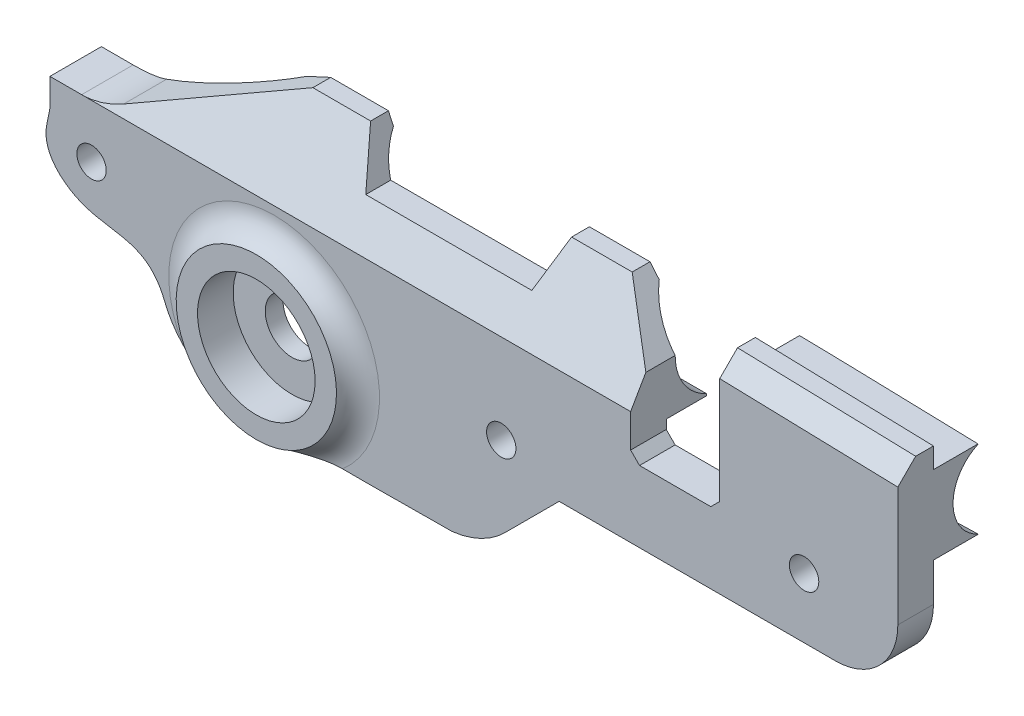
ISO-10303-21;
HEADER;
FILE_DESCRIPTION(('STEP AP214'),'2;1');
FILE_NAME('part.step','',(''),(''),'','','');
FILE_SCHEMA(('AUTOMOTIVE_DESIGN { 1 0 10303 214 1 1 1 1 }'));
ENDSEC;
DATA;
#1=APPLICATION_CONTEXT('core data for automotive mechanical design processes');
#2=APPLICATION_PROTOCOL_DEFINITION('international standard','automotive_design',2000,#1);
#3=PRODUCT_CONTEXT('',#1,'mechanical');
#4=PRODUCT('Part','Part','',(#3));
#5=PRODUCT_RELATED_PRODUCT_CATEGORY('part','',(#4));
#6=PRODUCT_DEFINITION_FORMATION('','',#4);
#7=PRODUCT_DEFINITION_CONTEXT('part definition',#1,'design');
#8=PRODUCT_DEFINITION('design','',#6,#7);
#9=PRODUCT_DEFINITION_SHAPE('','',#8);
#10=(LENGTH_UNIT() NAMED_UNIT(*) SI_UNIT(.MILLI.,.METRE.));
#11=(NAMED_UNIT(*) PLANE_ANGLE_UNIT() SI_UNIT($,.RADIAN.));
#12=(NAMED_UNIT(*) SI_UNIT($,.STERADIAN.) SOLID_ANGLE_UNIT());
#13=UNCERTAINTY_MEASURE_WITH_UNIT(LENGTH_MEASURE(1.E-05),#10,'distance_accuracy_value','');
#14=(GEOMETRIC_REPRESENTATION_CONTEXT(3) GLOBAL_UNCERTAINTY_ASSIGNED_CONTEXT((#13)) GLOBAL_UNIT_ASSIGNED_CONTEXT((#10,
#11,#12)) REPRESENTATION_CONTEXT('',''));
#15=CARTESIAN_POINT('',(0.,0.,0.));
#16=DIRECTION('',(0.,0.,1.));
#17=DIRECTION('',(1.,0.,0.));
#18=AXIS2_PLACEMENT_3D('',#15,#16,#17);
#19=CARTESIAN_POINT('',(0.,0.,-5.));
#20=DIRECTION('',(0.,0.,-1.));
#21=DIRECTION('',(-1.,0.,0.));
#22=AXIS2_PLACEMENT_3D('',#19,#20,#21);
#23=PLANE('',#22);
#24=CARTESIAN_POINT('',(140.839062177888,-3.67822858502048,-5.));
#25=CARTESIAN_POINT('',(139.4813953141,-3.72065114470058,-5.));
#26=CARTESIAN_POINT('',(138.123723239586,-3.76290656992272,-5.));
#27=CARTESIAN_POINT('',(135.408369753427,-3.84711479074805,-5.));
#28=CARTESIAN_POINT('',(134.050688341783,-3.8890675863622,-5.));
#29=CARTESIAN_POINT('',(127.262259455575,-4.09815412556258,-5.));
#30=CARTESIAN_POINT('',(121.831449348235,-4.26325546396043,-5.));
#31=CARTESIAN_POINT('',(110.969737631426,-4.59043137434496,-5.));
#32=CARTESIAN_POINT('',(105.538836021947,-4.75250594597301,-5.));
#33=CARTESIAN_POINT('',(96.1248668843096,-5.0315164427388,-5.));
#34=CARTESIAN_POINT('',(92.1418145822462,-5.14896669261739,-5.));
#35=CARTESIAN_POINT('',(84.175681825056,-5.3828810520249,-5.));
#36=CARTESIAN_POINT('',(80.1926013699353,-5.49934516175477,-5.));
#37=CARTESIAN_POINT('',(76.2095096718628,-5.61542177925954,-5.));
#38=B_SPLINE_CURVE_WITH_KNOTS('',3,(#24,#25,#26,#27,#28,#29,#30,#31,#32,#33,#34,#35,#36,#37),
.UNSPECIFIED.,.F.,.F.,(4,2,2,2,2,2,4),(0.,4.07498842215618,8.14997669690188,24.4499326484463,
40.749890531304,52.7042411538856,64.6585893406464),.UNSPECIFIED.);
#39=CARTESIAN_POINT('',(118.524285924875,-4.3627929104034,-5.));
#40=VERTEX_POINT('',#39);
#41=CARTESIAN_POINT('',(103.995787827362,-4.79804183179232,-5.));
#42=VERTEX_POINT('',#41);
#43=EDGE_CURVE('E756',#40,#42,#38,.T.);
#44=ORIENTED_EDGE('',*,*,#43,.F.);
#45=DIRECTION('',(0.,-1.,0.));
#46=VECTOR('',#45,1.);
#47=CARTESIAN_POINT('',(118.524285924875,4.39922031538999,-5.));
#48=LINE('',#47,#46);
#49=CARTESIAN_POINT('',(118.524285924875,-4.39922031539,-5.));
#50=VERTEX_POINT('',#49);
#51=EDGE_CURVE('E762',#40,#50,#48,.T.);
#52=ORIENTED_EDGE('',*,*,#51,.T.);
#53=DIRECTION('',(-0.999623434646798,-0.02744064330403,0.));
#54=VECTOR('',#53,1.);
#55=CARTESIAN_POINT('',(118.524285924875,-4.39922031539,-5.));
#56=LINE('',#55,#54);
#57=EDGE_CURVE('E777',#50,#42,#56,.T.);
#58=ORIENTED_EDGE('',*,*,#57,.T.);
#59=EDGE_LOOP('',(#44,#52,#58));
#60=FACE_BOUND('',#59,.T.);
#61=ADVANCED_FACE('F37',(#60),#23,.T.);
#62=CARTESIAN_POINT('',(67.3566796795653,-14.7,0.));
#63=DIRECTION('',(0.,0.,1.));
#64=DIRECTION('',(1.,0.,0.));
#65=AXIS2_PLACEMENT_3D('',#62,#63,#64);
#66=PLANE('',#65);
#67=DIRECTION('',(0.,-1.,0.));
#68=VECTOR('',#67,1.);
#69=CARTESIAN_POINT('',(98.5242859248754,-5.34839060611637,0.));
#70=LINE('',#69,#68);
#71=CARTESIAN_POINT('',(98.5242859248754,7.24910634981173,0.));
#72=VERTEX_POINT('',#71);
#73=CARTESIAN_POINT('',(98.5242859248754,4.94823992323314,0.));
#74=VERTEX_POINT('',#73);
#75=EDGE_CURVE('E532',#72,#74,#70,.T.);
#76=ORIENTED_EDGE('',*,*,#75,.F.);
#77=DIRECTION('',(0.999623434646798,-0.02744064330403,0.));
#78=VECTOR('',#77,1.);
#79=CARTESIAN_POINT('',(67.9822193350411,8.08751602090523,0.));
#80=LINE('',#79,#78);
#81=CARTESIAN_POINT('',(118.524285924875,6.70008674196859,0.));
#82=VERTEX_POINT('',#81);
#83=EDGE_CURVE('E520',#72,#82,#80,.T.);
#84=ORIENTED_EDGE('',*,*,#83,.T.);
#85=DIRECTION('',(0.,1.,0.));
#86=VECTOR('',#85,1.);
#87=CARTESIAN_POINT('',(118.524285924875,-8.70000000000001,0.));
#88=LINE('',#87,#86);
#89=CARTESIAN_POINT('',(118.524285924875,4.39922031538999,0.));
#90=VERTEX_POINT('',#89);
#91=EDGE_CURVE('E531',#90,#82,#88,.T.);
#92=ORIENTED_EDGE('',*,*,#91,.F.);
#93=DIRECTION('',(0.999623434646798,-0.0274406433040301,0.));
#94=VECTOR('',#93,1.);
#95=CARTESIAN_POINT('',(98.5242859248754,4.94823992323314,0.));
#96=LINE('',#95,#94);
#97=EDGE_CURVE('E767',#74,#90,#96,.T.);
#98=ORIENTED_EDGE('',*,*,#97,.F.);
#99=EDGE_LOOP('',(#76,#84,#92,#98));
#100=FACE_BOUND('',#99,.T.);
#101=ADVANCED_FACE('F529',(#100),#66,.F.);
#102=CARTESIAN_POINT('',(74.,-13.,0.));
#103=DIRECTION('',(0.,0.,1.));
#104=DIRECTION('',(1.,0.,0.));
#105=AXIS2_PLACEMENT_3D('',#102,#103,#104);
#106=CIRCLE('',#105,1.65);
#107=CARTESIAN_POINT('',(75.65,-13.,0.));
#108=VERTEX_POINT('',#107);
#109=EDGE_CURVE('E2340',#108,#108,#106,.T.);
#110=ORIENTED_EDGE('',*,*,#109,.T.);
#111=EDGE_LOOP('',(#110));
#112=FACE_BOUND('',#111,.T.);
#113=CARTESIAN_POINT('',(108.,-8.96025403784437,0.));
#114=DIRECTION('',(0.,0.,1.));
#115=DIRECTION('',(1.,0.,0.));
#116=AXIS2_PLACEMENT_3D('',#113,#114,#115);
#117=CIRCLE('',#116,1.65);
#118=CARTESIAN_POINT('',(109.65,-8.96025403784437,0.));
#119=VERTEX_POINT('',#118);
#120=EDGE_CURVE('E2358',#119,#119,#117,.T.);
#121=ORIENTED_EDGE('',*,*,#120,.T.);
#122=EDGE_LOOP('',(#121));
#123=FACE_BOUND('',#122,.T.);
#124=CARTESIAN_POINT('',(118.524285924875,-8.70000000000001,0.));
#125=VERTEX_POINT('',#124);
#126=CARTESIAN_POINT('',(118.524285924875,-4.39922031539,0.));
#127=VERTEX_POINT('',#126);
#128=EDGE_CURVE('E539',#125,#127,#88,.T.);
#129=ORIENTED_EDGE('',*,*,#128,.F.);
#130=CARTESIAN_POINT('',(111.524285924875,-8.70000000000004,0.));
#131=DIRECTION('',(0.,0.,1.));
#132=DIRECTION('',(1.,0.,0.));
#133=AXIS2_PLACEMENT_3D('',#130,#131,#132);
#134=CIRCLE('',#133,7.);
#135=CARTESIAN_POINT('',(111.524285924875,-15.7,0.));
#136=VERTEX_POINT('',#135);
#137=EDGE_CURVE('E1191',#125,#136,#134,.F.);
#138=ORIENTED_EDGE('',*,*,#137,.T.);
#139=DIRECTION('',(1.,0.,0.));
#140=VECTOR('',#139,1.);
#141=CARTESIAN_POINT('',(80.4981081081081,-15.7,0.));
#142=LINE('',#141,#140);
#143=CARTESIAN_POINT('',(80.4981081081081,-15.7,0.));
#144=VERTEX_POINT('',#143);
#145=EDGE_CURVE('E540',#144,#136,#142,.T.);
#146=ORIENTED_EDGE('',*,*,#145,.F.);
#147=DIRECTION('',(0.707106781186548,0.707106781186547,0.));
#148=VECTOR('',#147,1.);
#149=CARTESIAN_POINT('',(74.4981081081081,-21.7,0.));
#150=LINE('',#149,#148);
#151=CARTESIAN_POINT('',(74.4981081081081,-21.7,0.));
#152=VERTEX_POINT('',#151);
#153=EDGE_CURVE('E544',#152,#144,#150,.T.);
#154=ORIENTED_EDGE('',*,*,#153,.F.);
#155=CARTESIAN_POINT('',(67.3566796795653,-14.7,0.));
#156=DIRECTION('',(0.,0.,1.));
#157=DIRECTION('',(1.,0.,0.));
#158=AXIS2_PLACEMENT_3D('',#155,#156,#157);
#159=CIRCLE('',#158,10.);
#160=CARTESIAN_POINT('',(68.4981081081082,-24.6346434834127,0.));
#161=VERTEX_POINT('',#160);
#162=EDGE_CURVE('E1174',#161,#152,#159,.T.);
#163=ORIENTED_EDGE('',*,*,#162,.F.);
#164=DIRECTION('',(0.999973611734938,0.00726469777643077,0.));
#165=VECTOR('',#164,1.);
#166=CARTESIAN_POINT('',(59.5018918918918,-24.7,0.));
#167=LINE('',#166,#165);
#168=CARTESIAN_POINT('',(68.,-24.6382621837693,0.));
#169=VERTEX_POINT('',#168);
#170=EDGE_CURVE('E573',#169,#161,#167,.T.);
#171=ORIENTED_EDGE('',*,*,#170,.F.);
#172=DIRECTION('',(0.,-1.,0.));
#173=VECTOR('',#172,1.);
#174=CARTESIAN_POINT('',(68.,-24.6382621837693,0.));
#175=LINE('',#174,#173);
#176=CARTESIAN_POINT('',(68.,-24.5450817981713,0.));
#177=VERTEX_POINT('',#176);
#178=EDGE_CURVE('E1965',#177,#169,#175,.T.);
#179=ORIENTED_EDGE('',*,*,#178,.F.);
#180=DIRECTION('',(-0.52087540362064,0.853632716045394,0.));
#181=VECTOR('',#180,1.);
#182=CARTESIAN_POINT('',(68.1663736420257,-24.8177419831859,0.));
#183=LINE('',#182,#181);
#184=CARTESIAN_POINT('',(67.7439101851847,-24.1253909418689,0.));
#185=VERTEX_POINT('',#184);
#186=EDGE_CURVE('E1041',#177,#185,#183,.T.);
#187=ORIENTED_EDGE('',*,*,#186,.T.);
#188=CARTESIAN_POINT('',(67.7439101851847,-24.1253909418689,0.));
#189=CARTESIAN_POINT('',(67.6133312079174,-23.9113925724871,0.));
#190=CARTESIAN_POINT('',(67.4951050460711,-23.6868470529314,0.));
#191=CARTESIAN_POINT('',(67.2894419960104,-23.2236693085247,0.));
#192=CARTESIAN_POINT('',(67.2028477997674,-22.9873570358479,0.));
#193=CARTESIAN_POINT('',(67.0626109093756,-22.5058782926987,0.));
#194=CARTESIAN_POINT('',(67.0089285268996,-22.260758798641,0.));
#195=CARTESIAN_POINT('',(66.9361863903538,-21.7597816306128,0.));
#196=CARTESIAN_POINT('',(66.9175234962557,-21.503128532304,0.));
#197=CARTESIAN_POINT('',(66.9175433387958,-20.7433302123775,0.));
#198=CARTESIAN_POINT('',(66.9901873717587,-20.2429472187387,0.));
#199=CARTESIAN_POINT('',(67.2749652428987,-19.2648685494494,0.));
#200=CARTESIAN_POINT('',(67.4811681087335,-18.8052019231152,0.));
#201=CARTESIAN_POINT('',(67.7439101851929,-18.3746090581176,0.));
#202=B_SPLINE_CURVE_WITH_KNOTS('',3,(#188,#189,#190,#191,#192,#193,#194,#195,#196,#197,#198,
#199,#200,#201),.UNSPECIFIED.,.F.,.F.,(4,2,2,2,2,2,4),(0.,0.125,0.25,0.375,0.5,0.75,1.),.UNSPECIFIED.);
#203=CARTESIAN_POINT('',(67.7439101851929,-18.3746090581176,0.));
#204=VERTEX_POINT('',#203);
#205=EDGE_CURVE('E2246',#185,#204,#202,.T.);
#206=ORIENTED_EDGE('',*,*,#205,.T.);
#207=DIRECTION('',(0.520875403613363,0.853632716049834,0.));
#208=VECTOR('',#207,1.);
#209=CARTESIAN_POINT('',(67.7439101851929,-18.3746090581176,0.));
#210=LINE('',#209,#208);
#211=CARTESIAN_POINT('',(68.,-17.9549182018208,0.));
#212=VERTEX_POINT('',#211);
#213=EDGE_CURVE('E1075',#204,#212,#210,.T.);
#214=ORIENTED_EDGE('',*,*,#213,.T.);
#215=CARTESIAN_POINT('',(68.,-5.68691398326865,0.));
#216=VERTEX_POINT('',#215);
#217=EDGE_CURVE('E1976',#216,#212,#175,.T.);
#218=ORIENTED_EDGE('',*,*,#217,.F.);
#219=DIRECTION('',(-1.,0.,0.));
#220=VECTOR('',#219,1.);
#221=CARTESIAN_POINT('',(64.,-5.68691398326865,0.));
#222=LINE('',#221,#220);
#223=CARTESIAN_POINT('',(88.5242859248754,-5.68691398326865,0.));
#224=VERTEX_POINT('',#223);
#225=EDGE_CURVE('E2032',#224,#216,#222,.T.);
#226=ORIENTED_EDGE('',*,*,#225,.F.);
#227=DIRECTION('',(0.,1.,0.));
#228=VECTOR('',#227,1.);
#229=CARTESIAN_POINT('',(88.5242859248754,0.,0.));
#230=LINE('',#229,#228);
#231=CARTESIAN_POINT('',(88.5242859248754,-6.70000000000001,0.));
#232=VERTEX_POINT('',#231);
#233=EDGE_CURVE('E556',#232,#224,#230,.T.);
#234=ORIENTED_EDGE('',*,*,#233,.F.);
#235=DIRECTION('',(-0.707106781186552,0.707106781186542,0.));
#236=VECTOR('',#235,1.);
#237=CARTESIAN_POINT('',(89.5242859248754,-7.70000000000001,0.));
#238=LINE('',#237,#236);
#239=CARTESIAN_POINT('',(89.5242859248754,-7.70000000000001,0.));
#240=VERTEX_POINT('',#239);
#241=EDGE_CURVE('E553',#240,#232,#238,.T.);
#242=ORIENTED_EDGE('',*,*,#241,.F.);
#243=DIRECTION('',(-1.,0.,0.));
#244=VECTOR('',#243,1.);
#245=CARTESIAN_POINT('',(97.5242859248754,-7.70000000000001,0.));
#246=LINE('',#245,#244);
#247=CARTESIAN_POINT('',(97.5242859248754,-7.70000000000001,0.));
#248=VERTEX_POINT('',#247);
#249=EDGE_CURVE('E551',#248,#240,#246,.T.);
#250=ORIENTED_EDGE('',*,*,#249,.F.);
#251=DIRECTION('',(-0.707106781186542,-0.707106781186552,0.));
#252=VECTOR('',#251,1.);
#253=CARTESIAN_POINT('',(98.5242859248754,-6.7,0.));
#254=LINE('',#253,#252);
#255=CARTESIAN_POINT('',(98.5242859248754,-6.7,0.));
#256=VERTEX_POINT('',#255);
#257=EDGE_CURVE('E549',#256,#248,#254,.T.);
#258=ORIENTED_EDGE('',*,*,#257,.F.);
#259=CARTESIAN_POINT('',(98.5242859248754,-4.94823992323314,0.));
#260=VERTEX_POINT('',#259);
#261=EDGE_CURVE('E542',#260,#256,#70,.T.);
#262=ORIENTED_EDGE('',*,*,#261,.F.);
#263=DIRECTION('',(-0.999623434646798,-0.02744064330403,0.));
#264=VECTOR('',#263,1.);
#265=CARTESIAN_POINT('',(118.524285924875,-4.39922031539,0.));
#266=LINE('',#265,#264);
#267=EDGE_CURVE('E763',#127,#260,#266,.T.);
#268=ORIENTED_EDGE('',*,*,#267,.F.);
#269=EDGE_LOOP('',(#129,#138,#146,#154,#163,#171,#179,#187,#206,#214,#218,#226,#234,#242,#250,
#258,#262,#268));
#270=FACE_BOUND('',#269,.T.);
#271=ADVANCED_FACE('F733',(#112,#123,#270),#66,.F.);
#272=CARTESIAN_POINT('',(35.5,-9.70000000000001,4.));
#273=DIRECTION('',(1.,0.,0.));
#274=DIRECTION('',(0.,0.,-1.));
#275=AXIS2_PLACEMENT_3D('',#272,#273,#274);
#276=PLANE('',#275);
#277=DIRECTION('',(0.,1.,0.));
#278=VECTOR('',#277,1.);
#279=CARTESIAN_POINT('',(35.5,-9.70000000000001,-3.));
#280=LINE('',#279,#278);
#281=CARTESIAN_POINT('',(35.5,-9.40000000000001,-3.));
#282=VERTEX_POINT('',#281);
#283=CARTESIAN_POINT('',(35.5,-6.63026409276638,-3.));
#284=VERTEX_POINT('',#283);
#285=EDGE_CURVE('E833',#282,#284,#280,.T.);
#286=ORIENTED_EDGE('',*,*,#285,.T.);
#287=CARTESIAN_POINT('',(35.5,-6.56513204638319,-6.13073345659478));
#288=DIRECTION('',(-1.,0.,0.));
#289=DIRECTION('',(0.,0.,1.));
#290=AXIS2_PLACEMENT_3D('',#287,#288,#289);
#291=CIRCLE('',#290,3.13141088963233);
#292=CARTESIAN_POINT('',(35.5,-9.23841515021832,-4.5));
#293=VERTEX_POINT('',#292);
#294=EDGE_CURVE('E1996',#293,#284,#291,.T.);
#295=ORIENTED_EDGE('',*,*,#294,.F.);
#296=DIRECTION('',(0.,-1.,0.));
#297=VECTOR('',#296,1.);
#298=CARTESIAN_POINT('',(35.5,-9.70000000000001,-4.5));
#299=LINE('',#298,#297);
#300=CARTESIAN_POINT('',(35.5,-9.40000000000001,-4.5));
#301=VERTEX_POINT('',#300);
#302=EDGE_CURVE('E2242',#293,#301,#299,.T.);
#303=ORIENTED_EDGE('',*,*,#302,.T.);
#304=DIRECTION('',(0.,0.,1.));
#305=VECTOR('',#304,1.);
#306=CARTESIAN_POINT('',(35.5,-9.40000000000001,-3.));
#307=LINE('',#306,#305);
#308=EDGE_CURVE('E2038',#301,#282,#307,.T.);
#309=ORIENTED_EDGE('',*,*,#308,.T.);
#310=EDGE_LOOP('',(#286,#295,#303,#309));
#311=FACE_BOUND('',#310,.T.);
#312=ADVANCED_FACE('F1155',(#311),#276,.F.);
#313=CARTESIAN_POINT('',(67.3566796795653,-14.7,4.));
#314=DIRECTION('',(0.,0.,1.));
#315=DIRECTION('',(1.,0.,0.));
#316=AXIS2_PLACEMENT_3D('',#313,#314,#315);
#317=PLANE('',#316);
#318=DIRECTION('',(0.,1.,0.));
#319=VECTOR('',#318,1.);
#320=CARTESIAN_POINT('',(118.524285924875,-8.70000000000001,4.));
#321=LINE('',#320,#319);
#322=CARTESIAN_POINT('',(118.524285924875,-8.70000000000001,4.));
#323=VERTEX_POINT('',#322);
#324=CARTESIAN_POINT('',(118.524285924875,4.6993333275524,4.));
#325=VERTEX_POINT('',#324);
#326=EDGE_CURVE('E2049',#323,#325,#321,.T.);
#327=ORIENTED_EDGE('',*,*,#326,.T.);
#328=DIRECTION('',(-0.999623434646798,0.02744064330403,0.));
#329=VECTOR('',#328,1.);
#330=CARTESIAN_POINT('',(98.4694046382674,5.24985948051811,4.));
#331=LINE('',#330,#329);
#332=CARTESIAN_POINT('',(98.5242859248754,5.24835293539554,4.));
#333=VERTEX_POINT('',#332);
#334=EDGE_CURVE('E46',#325,#333,#331,.T.);
#335=ORIENTED_EDGE('',*,*,#334,.T.);
#336=DIRECTION('',(0.,-1.,0.));
#337=VECTOR('',#336,1.);
#338=CARTESIAN_POINT('',(98.5242859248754,-5.34839060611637,4.));
#339=LINE('',#338,#337);
#340=CARTESIAN_POINT('',(98.5242859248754,-6.7,4.));
#341=VERTEX_POINT('',#340);
#342=EDGE_CURVE('E2051',#333,#341,#339,.T.);
#343=ORIENTED_EDGE('',*,*,#342,.T.);
#344=DIRECTION('',(-0.707106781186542,-0.707106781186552,0.));
#345=VECTOR('',#344,1.);
#346=CARTESIAN_POINT('',(98.5242859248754,-6.7,4.));
#347=LINE('',#346,#345);
#348=CARTESIAN_POINT('',(97.5242859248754,-7.70000000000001,4.));
#349=VERTEX_POINT('',#348);
#350=EDGE_CURVE('E2053',#341,#349,#347,.T.);
#351=ORIENTED_EDGE('',*,*,#350,.T.);
#352=DIRECTION('',(-1.,0.,0.));
#353=VECTOR('',#352,1.);
#354=CARTESIAN_POINT('',(97.5242859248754,-7.70000000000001,4.));
#355=LINE('',#354,#353);
#356=CARTESIAN_POINT('',(89.5242859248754,-7.70000000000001,4.));
#357=VERTEX_POINT('',#356);
#358=EDGE_CURVE('E2055',#349,#357,#355,.T.);
#359=ORIENTED_EDGE('',*,*,#358,.T.);
#360=DIRECTION('',(-0.707106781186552,0.707106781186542,0.));
#361=VECTOR('',#360,1.);
#362=CARTESIAN_POINT('',(89.5242859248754,-7.70000000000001,4.));
#363=LINE('',#362,#361);
#364=CARTESIAN_POINT('',(88.5242859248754,-6.70000000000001,4.));
#365=VERTEX_POINT('',#364);
#366=EDGE_CURVE('E2056',#357,#365,#363,.T.);
#367=ORIENTED_EDGE('',*,*,#366,.T.);
#368=DIRECTION('',(0.,1.,0.));
#369=VECTOR('',#368,1.);
#370=CARTESIAN_POINT('',(88.5242859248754,-6.70000000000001,4.));
#371=LINE('',#370,#369);
#372=CARTESIAN_POINT('',(88.5242859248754,-2.9602540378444,4.));
#373=VERTEX_POINT('',#372);
#374=EDGE_CURVE('E1164',#365,#373,#371,.T.);
#375=ORIENTED_EDGE('',*,*,#374,.T.);
#376=DIRECTION('',(1.,0.,0.));
#377=VECTOR('',#376,1.);
#378=CARTESIAN_POINT('',(29.0859762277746,-2.9602540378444,4.));
#379=LINE('',#378,#377);
#380=CARTESIAN_POINT('',(26.8896513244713,-2.96025403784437,4.));
#381=VERTEX_POINT('',#380);
#382=EDGE_CURVE('E868',#381,#373,#379,.T.);
#383=ORIENTED_EDGE('',*,*,#382,.F.);
#384=DIRECTION('',(-1.,0.,0.));
#385=VECTOR('',#384,1.);
#386=CARTESIAN_POINT('',(35.5,-2.96025403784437,4.));
#387=LINE('',#386,#385);
#388=CARTESIAN_POINT('',(23.3279854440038,-2.96025403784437,4.));
#389=VERTEX_POINT('',#388);
#390=EDGE_CURVE('E834',#381,#389,#387,.T.);
#391=ORIENTED_EDGE('',*,*,#390,.T.);
#392=DIRECTION('',(0.,-1.,0.));
#393=VECTOR('',#392,1.);
#394=CARTESIAN_POINT('',(23.3279854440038,-5.99999999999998,4.));
#395=LINE('',#394,#393);
#396=CARTESIAN_POINT('',(23.3279854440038,-5.87953371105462,4.));
#397=VERTEX_POINT('',#396);
#398=EDGE_CURVE('E824',#389,#397,#395,.T.);
#399=ORIENTED_EDGE('',*,*,#398,.T.);
#400=CARTESIAN_POINT('',(23.3279854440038,-5.87953371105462,4.));
#401=CARTESIAN_POINT('',(23.3279854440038,-6.46948003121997,4.));
#402=CARTESIAN_POINT('',(21.9842793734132,-10.0706775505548,4.));
#403=CARTESIAN_POINT('',(28.0999266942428,-15.6960526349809,4.));
#404=CARTESIAN_POINT('',(34.2808972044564,-13.5457141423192,4.));
#405=CARTESIAN_POINT('',(36.2067201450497,-18.3925532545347,4.));
#406=B_SPLINE_CURVE_WITH_KNOTS('',3,(#400,#401,#402,#403,#404,#405),.UNSPECIFIED.,.F.,.F.,(4,1,
1,4),(0.,0.136350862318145,0.44757387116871,1.),.UNSPECIFIED.);
#407=CARTESIAN_POINT('',(36.2067201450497,-18.3925532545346,4.));
#408=VERTEX_POINT('',#407);
#409=EDGE_CURVE('E1157',#397,#408,#406,.T.);
#410=ORIENTED_EDGE('',*,*,#409,.T.);
#411=CARTESIAN_POINT('',(45.5,-14.7,4.));
#412=DIRECTION('',(0.,0.,1.));
#413=DIRECTION('',(1.,0.,0.));
#414=AXIS2_PLACEMENT_3D('',#411,#412,#413);
#415=CIRCLE('',#414,10.);
#416=CARTESIAN_POINT('',(38.2269899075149,-21.5631861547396,4.));
#417=VERTEX_POINT('',#416);
#418=EDGE_CURVE('E1163',#408,#417,#415,.T.);
#419=ORIENTED_EDGE('',*,*,#418,.T.);
#420=CARTESIAN_POINT('',(48.5,-15.7,4.));
#421=DIRECTION('',(0.,0.,1.));
#422=DIRECTION('',(1.,0.,0.));
#423=AXIS2_PLACEMENT_3D('',#420,#421,#422);
#424=CIRCLE('',#423,11.8284271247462);
#425=CARTESIAN_POINT('',(56.1753949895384,-24.7,4.));
#426=VERTEX_POINT('',#425);
#427=EDGE_CURVE('E1124',#417,#426,#424,.F.);
#428=ORIENTED_EDGE('',*,*,#427,.T.);
#429=DIRECTION('',(1.,0.,0.));
#430=VECTOR('',#429,1.);
#431=CARTESIAN_POINT('',(45.5,-24.7,4.));
#432=LINE('',#431,#430);
#433=CARTESIAN_POINT('',(59.5018918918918,-24.7,4.));
#434=VERTEX_POINT('',#433);
#435=EDGE_CURVE('E1171',#426,#434,#432,.T.);
#436=ORIENTED_EDGE('',*,*,#435,.T.);
#437=DIRECTION('',(0.999973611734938,0.00726469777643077,0.));
#438=VECTOR('',#437,1.);
#439=CARTESIAN_POINT('',(59.5018918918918,-24.7,4.));
#440=LINE('',#439,#438);
#441=CARTESIAN_POINT('',(68.4981081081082,-24.6346434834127,4.));
#442=VERTEX_POINT('',#441);
#443=EDGE_CURVE('E582',#434,#442,#440,.T.);
#444=ORIENTED_EDGE('',*,*,#443,.T.);
#445=CARTESIAN_POINT('',(67.3566796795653,-14.7,4.));
#446=DIRECTION('',(0.,0.,1.));
#447=DIRECTION('',(1.,0.,0.));
#448=AXIS2_PLACEMENT_3D('',#445,#446,#447);
#449=CIRCLE('',#448,10.);
#450=CARTESIAN_POINT('',(74.4981081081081,-21.7,4.));
#451=VERTEX_POINT('',#450);
#452=EDGE_CURVE('E577',#442,#451,#449,.T.);
#453=ORIENTED_EDGE('',*,*,#452,.T.);
#454=DIRECTION('',(0.707106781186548,0.707106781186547,0.));
#455=VECTOR('',#454,1.);
#456=CARTESIAN_POINT('',(74.4981081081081,-21.7,4.));
#457=LINE('',#456,#455);
#458=CARTESIAN_POINT('',(80.4981081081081,-15.7,4.));
#459=VERTEX_POINT('',#458);
#460=EDGE_CURVE('E2046',#451,#459,#457,.T.);
#461=ORIENTED_EDGE('',*,*,#460,.T.);
#462=DIRECTION('',(1.,0.,0.));
#463=VECTOR('',#462,1.);
#464=CARTESIAN_POINT('',(80.4981081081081,-15.7,4.));
#465=LINE('',#464,#463);
#466=CARTESIAN_POINT('',(111.524285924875,-15.7,4.));
#467=VERTEX_POINT('',#466);
#468=EDGE_CURVE('E1189',#459,#467,#465,.T.);
#469=ORIENTED_EDGE('',*,*,#468,.T.);
#470=CARTESIAN_POINT('',(111.524285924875,-8.70000000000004,4.));
#471=DIRECTION('',(0.,0.,1.));
#472=DIRECTION('',(1.,0.,0.));
#473=AXIS2_PLACEMENT_3D('',#470,#471,#472);
#474=CIRCLE('',#473,7.);
#475=EDGE_CURVE('E1198',#467,#323,#474,.T.);
#476=ORIENTED_EDGE('',*,*,#475,.T.);
#477=EDGE_LOOP('',(#327,#335,#343,#351,#359,#367,#375,#383,#391,#399,#410,#419,#428,#436,#444,
#453,#461,#469,#476));
#478=FACE_BOUND('',#477,.T.);
#479=CARTESIAN_POINT('',(28.,-8.96025403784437,4.));
#480=DIRECTION('',(0.,0.,1.));
#481=DIRECTION('',(1.,0.,0.));
#482=AXIS2_PLACEMENT_3D('',#479,#480,#481);
#483=CIRCLE('',#482,1.65);
#484=CARTESIAN_POINT('',(29.65,-8.96025403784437,4.));
#485=VERTEX_POINT('',#484);
#486=EDGE_CURVE('E2359',#485,#485,#483,.T.);
#487=ORIENTED_EDGE('',*,*,#486,.F.);
#488=EDGE_LOOP('',(#487));
#489=FACE_BOUND('',#488,.T.);
#490=CARTESIAN_POINT('',(74.,-13.,4.));
#491=DIRECTION('',(0.,0.,1.));
#492=DIRECTION('',(1.,0.,0.));
#493=AXIS2_PLACEMENT_3D('',#490,#491,#492);
#494=CIRCLE('',#493,1.65);
#495=CARTESIAN_POINT('',(75.65,-13.,4.));
#496=VERTEX_POINT('',#495);
#497=EDGE_CURVE('E2364',#496,#496,#494,.T.);
#498=ORIENTED_EDGE('',*,*,#497,.F.);
#499=EDGE_LOOP('',(#498));
#500=FACE_BOUND('',#499,.T.);
#501=CARTESIAN_POINT('',(108.,-8.96025403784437,4.));
#502=DIRECTION('',(0.,0.,1.));
#503=DIRECTION('',(1.,0.,0.));
#504=AXIS2_PLACEMENT_3D('',#501,#502,#503);
#505=CIRCLE('',#504,1.65);
#506=CARTESIAN_POINT('',(109.65,-8.96025403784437,4.));
#507=VERTEX_POINT('',#506);
#508=EDGE_CURVE('E525',#507,#507,#505,.T.);
#509=ORIENTED_EDGE('',*,*,#508,.F.);
#510=EDGE_LOOP('',(#509));
#511=FACE_BOUND('',#510,.T.);
#512=ADVANCED_FACE('F1248',(#478,#489,#500,#511),#317,.T.);
#513=CARTESIAN_POINT('',(0.,0.,-3.));
#514=DIRECTION('',(0.,0.,1.));
#515=DIRECTION('',(1.,0.,0.));
#516=AXIS2_PLACEMENT_3D('',#513,#514,#515);
#517=PLANE('',#516);
#518=DIRECTION('',(-0.646130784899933,0.763226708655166,0.));
#519=VECTOR('',#518,1.);
#520=CARTESIAN_POINT('',(83.6987924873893,5.69999999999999,-3.));
#521=LINE('',#520,#519);
#522=CARTESIAN_POINT('',(84.7382749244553,4.47213595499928,-3.));
#523=VERTEX_POINT('',#522);
#524=CARTESIAN_POINT('',(83.6987924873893,5.69999999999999,-3.));
#525=VERTEX_POINT('',#524);
#526=EDGE_CURVE('E872',#523,#525,#521,.T.);
#527=ORIENTED_EDGE('',*,*,#526,.F.);
#528=DIRECTION('',(1.,0.,0.));
#529=VECTOR('',#528,1.);
#530=CARTESIAN_POINT('',(31.5242859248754,4.47213595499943,-3.));
#531=LINE('',#530,#529);
#532=CARTESIAN_POINT('',(76.4404617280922,4.4721359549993,-3.));
#533=VERTEX_POINT('',#532);
#534=EDGE_CURVE('E1106',#523,#533,#531,.F.);
#535=ORIENTED_EDGE('',*,*,#534,.T.);
#536=DIRECTION('',(-0.347446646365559,-0.937699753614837,0.));
#537=VECTOR('',#536,1.);
#538=CARTESIAN_POINT('',(75.1509695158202,0.992014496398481,-3.));
#539=LINE('',#538,#537);
#540=CARTESIAN_POINT('',(76.8954231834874,5.69999999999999,-3.));
#541=VERTEX_POINT('',#540);
#542=EDGE_CURVE('E877',#541,#533,#539,.T.);
#543=ORIENTED_EDGE('',*,*,#542,.F.);
#544=DIRECTION('',(-1.,0.,0.));
#545=VECTOR('',#544,1.);
#546=CARTESIAN_POINT('',(76.8954231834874,5.69999999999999,-3.));
#547=LINE('',#546,#545);
#548=EDGE_CURVE('E874',#525,#541,#547,.T.);
#549=ORIENTED_EDGE('',*,*,#548,.F.);
#550=EDGE_LOOP('',(#527,#535,#543,#549));
#551=FACE_BOUND('',#550,.T.);
#552=ADVANCED_FACE('F1253',(#551),#517,.F.);
#553=CARTESIAN_POINT('',(90.8391800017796,0.,-4.5));
#554=DIRECTION('',(0.,0.,1.));
#555=DIRECTION('',(1.,0.,0.));
#556=AXIS2_PLACEMENT_3D('',#553,#554,#555);
#557=PLANE('',#556);
#558=CARTESIAN_POINT('',(59.5598818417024,-10.444504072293,-4.5));
#559=CARTESIAN_POINT('',(59.3112261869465,-10.3631649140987,-4.5));
#560=CARTESIAN_POINT('',(59.0612899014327,-10.285736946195,-4.5));
#561=CARTESIAN_POINT('',(58.5591208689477,-10.1388364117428,-4.5));
#562=CARTESIAN_POINT('',(58.3068883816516,-10.0693629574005,-4.5));
#563=CARTESIAN_POINT('',(57.8004095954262,-9.93850523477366,-4.5));
#564=CARTESIAN_POINT('',(57.5461639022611,-9.87711862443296,-4.5));
#565=CARTESIAN_POINT('',(57.035832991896,-9.76262615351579,-4.5));
#566=CARTESIAN_POINT('',(56.779747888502,-9.70951978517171,-4.5));
#567=CARTESIAN_POINT('',(56.19250055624,-9.59768035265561,-4.5));
#568=CARTESIAN_POINT('',(55.8608138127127,-9.54168222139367,-4.5));
#569=CARTESIAN_POINT('',(55.1954239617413,-9.44355417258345,-4.5));
#570=CARTESIAN_POINT('',(54.8617209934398,-9.40142330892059,-4.5));
#571=CARTESIAN_POINT('',(54.1905059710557,-9.33084571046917,-4.5));
#572=CARTESIAN_POINT('',(53.8529836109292,-9.30249692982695,-4.5));
#573=CARTESIAN_POINT('',(53.1770227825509,-9.25989222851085,-4.5));
#574=CARTESIAN_POINT('',(52.8385842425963,-9.24563744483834,-4.5));
#575=CARTESIAN_POINT('',(52.5,-9.23841515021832,-4.5));
#576=B_SPLINE_CURVE_WITH_KNOTS('',3,(#558,#559,#560,#561,#562,#563,#564,#565,#566,#567,#568,
#569,#570,#571,#572,#573,#574,#575),.UNSPECIFIED.,.F.,.F.,(4,2,2,2,2,2,2,2,4),(0.,
0.784832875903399,1.56957807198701,2.3540954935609,3.13856478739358,4.14740115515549,
5.15616867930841,6.17200470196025,7.18792266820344),.UNSPECIFIED.);
#577=CARTESIAN_POINT('',(59.5129460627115,-10.4291998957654,-4.5));
#578=VERTEX_POINT('',#577);
#579=CARTESIAN_POINT('',(52.5,-9.23841515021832,-4.5));
#580=VERTEX_POINT('',#579);
#581=EDGE_CURVE('E1044',#578,#580,#576,.T.);
#582=ORIENTED_EDGE('',*,*,#581,.F.);
#583=DIRECTION('',(0.,1.,0.));
#584=VECTOR('',#583,1.);
#585=CARTESIAN_POINT('',(59.5129460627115,-10.5991219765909,-4.5));
#586=LINE('',#585,#584);
#587=CARTESIAN_POINT('',(59.5129460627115,-10.5991219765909,-4.5));
#588=VERTEX_POINT('',#587);
#589=EDGE_CURVE('E890',#588,#578,#586,.T.);
#590=ORIENTED_EDGE('',*,*,#589,.F.);
#591=CARTESIAN_POINT('',(52.5,-9.40000000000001,-4.5));
#592=CARTESIAN_POINT('',(52.8003167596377,-9.40646088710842,-4.5));
#593=CARTESIAN_POINT('',(53.1005174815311,-9.41847551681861,-4.5));
#594=CARTESIAN_POINT('',(53.7002373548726,-9.45366092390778,-4.5));
#595=CARTESIAN_POINT('',(53.9997565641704,-9.47683071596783,-4.5));
#596=CARTESIAN_POINT('',(54.5977228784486,-9.53437678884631,-4.5));
#597=CARTESIAN_POINT('',(54.896169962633,-9.56875328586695,-4.5));
#598=CARTESIAN_POINT('',(55.4915962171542,-9.64863976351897,-4.5));
#599=CARTESIAN_POINT('',(55.788575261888,-9.69415068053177,-4.5));
#600=CARTESIAN_POINT('',(56.3748739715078,-9.79532356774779,-4.5));
#601=CARTESIAN_POINT('',(56.6642305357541,-9.85077172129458,-4.5));
#602=CARTESIAN_POINT('',(57.2407284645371,-9.97231402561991,-4.5));
#603=CARTESIAN_POINT('',(57.527869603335,-10.0384092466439,-4.5));
#604=CARTESIAN_POINT('',(58.0997568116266,-10.181021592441,-4.5));
#605=CARTESIAN_POINT('',(58.384501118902,-10.2575457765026,-4.5));
#606=CARTESIAN_POINT('',(58.9510235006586,-10.4207608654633,-4.5));
#607=CARTESIAN_POINT('',(59.2328019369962,-10.5074505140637,-4.5));
#608=CARTESIAN_POINT('',(59.5129460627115,-10.5991219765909,-4.5));
#609=B_SPLINE_CURVE_WITH_KNOTS('',3,(#591,#592,#593,#594,#595,#596,#597,#598,#599,#600,#601,
#602,#603,#604,#605,#606,#607,#608),.UNSPECIFIED.,.F.,.F.,(4,2,2,2,2,2,2,2,4),(0.,
0.901112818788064,1.80214605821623,2.70319668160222,3.60432310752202,4.48798600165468,
5.37173777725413,6.25609075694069,7.14033455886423),.UNSPECIFIED.);
#610=CARTESIAN_POINT('',(52.5,-9.40000000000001,-4.5));
#611=VERTEX_POINT('',#610);
#612=EDGE_CURVE('E978',#611,#588,#609,.T.);
#613=ORIENTED_EDGE('',*,*,#612,.F.);
#614=DIRECTION('',(1.,-6.14219153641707E-13,0.));
#615=VECTOR('',#614,1.);
#616=CARTESIAN_POINT('',(50.4912488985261,-9.40000000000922,-4.5));
#617=LINE('',#616,#615);
#618=EDGE_CURVE('E986',#301,#611,#617,.T.);
#619=ORIENTED_EDGE('',*,*,#618,.F.);
#620=ORIENTED_EDGE('',*,*,#302,.F.);
#621=DIRECTION('',(-1.,0.,0.));
#622=VECTOR('',#621,1.);
#623=CARTESIAN_POINT('',(52.5,-9.23841515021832,-4.5));
#624=LINE('',#623,#622);
#625=EDGE_CURVE('E2240',#580,#293,#624,.T.);
#626=ORIENTED_EDGE('',*,*,#625,.F.);
#627=EDGE_LOOP('',(#582,#590,#613,#619,#620,#626));
#628=FACE_BOUND('',#627,.T.);
#629=ADVANCED_FACE('F953',(#628),#557,.F.);
#630=CARTESIAN_POINT('',(60.,-24.6382621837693,-5.5));
#631=DIRECTION('',(1.,0.,0.));
#632=DIRECTION('',(0.,0.,-1.));
#633=AXIS2_PLACEMENT_3D('',#630,#631,#632);
#634=PLANE('',#633);
#635=DIRECTION('',(0.,0.,-1.));
#636=VECTOR('',#635,1.);
#637=CARTESIAN_POINT('',(60.,-24.5450817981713,-5.5));
#638=LINE('',#637,#636);
#639=CARTESIAN_POINT('',(60.,-24.5450817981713,0.));
#640=VERTEX_POINT('',#639);
#641=CARTESIAN_POINT('',(60.,-24.5450817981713,-4.5));
#642=VERTEX_POINT('',#641);
#643=EDGE_CURVE('E1066',#640,#642,#638,.T.);
#644=ORIENTED_EDGE('',*,*,#643,.T.);
#645=DIRECTION('',(0.,-1.,0.));
#646=VECTOR('',#645,1.);
#647=CARTESIAN_POINT('',(60.,-24.6382621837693,-4.5));
#648=LINE('',#647,#646);
#649=CARTESIAN_POINT('',(60.,-24.6382621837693,-4.5));
#650=VERTEX_POINT('',#649);
#651=EDGE_CURVE('E2139',#642,#650,#648,.T.);
#652=ORIENTED_EDGE('',*,*,#651,.T.);
#653=DIRECTION('',(0.,0.,1.));
#654=VECTOR('',#653,1.);
#655=CARTESIAN_POINT('',(60.,-24.6382621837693,-5.5));
#656=LINE('',#655,#654);
#657=CARTESIAN_POINT('',(60.,-24.6382621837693,0.));
#658=VERTEX_POINT('',#657);
#659=EDGE_CURVE('E1982',#650,#658,#656,.T.);
#660=ORIENTED_EDGE('',*,*,#659,.T.);
#661=DIRECTION('',(0.,1.,0.));
#662=VECTOR('',#661,1.);
#663=CARTESIAN_POINT('',(60.,-24.6382621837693,0.));
#664=LINE('',#663,#662);
#665=EDGE_CURVE('E1977',#658,#640,#664,.T.);
#666=ORIENTED_EDGE('',*,*,#665,.T.);
#667=EDGE_LOOP('',(#644,#652,#660,#666));
#668=FACE_BOUND('',#667,.T.);
#669=ADVANCED_FACE('F665',(#668),#634,.F.);
#670=CARTESIAN_POINT('',(68.,-24.6382621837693,-5.5));
#671=DIRECTION('',(-1.,0.,0.));
#672=DIRECTION('',(0.,-1.,0.));
#673=AXIS2_PLACEMENT_3D('',#670,#671,#672);
#674=PLANE('',#673);
#675=DIRECTION('',(0.,0.,1.));
#676=VECTOR('',#675,1.);
#677=CARTESIAN_POINT('',(68.,-24.6382621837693,-5.5));
#678=LINE('',#677,#676);
#679=CARTESIAN_POINT('',(68.,-24.6382621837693,-4.5));
#680=VERTEX_POINT('',#679);
#681=EDGE_CURVE('E1973',#680,#169,#678,.T.);
#682=ORIENTED_EDGE('',*,*,#681,.F.);
#683=DIRECTION('',(0.,1.,0.));
#684=VECTOR('',#683,1.);
#685=CARTESIAN_POINT('',(68.,-24.6382621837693,-4.5));
#686=LINE('',#685,#684);
#687=CARTESIAN_POINT('',(68.,-24.5450817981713,-4.5));
#688=VERTEX_POINT('',#687);
#689=EDGE_CURVE('E2166',#680,#688,#686,.T.);
#690=ORIENTED_EDGE('',*,*,#689,.T.);
#691=DIRECTION('',(0.,0.,1.));
#692=VECTOR('',#691,1.);
#693=CARTESIAN_POINT('',(68.,-24.5450817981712,-5.5));
#694=LINE('',#693,#692);
#695=EDGE_CURVE('E1073',#688,#177,#694,.T.);
#696=ORIENTED_EDGE('',*,*,#695,.T.);
#697=ORIENTED_EDGE('',*,*,#178,.T.);
#698=EDGE_LOOP('',(#682,#690,#696,#697));
#699=FACE_BOUND('',#698,.T.);
#700=ADVANCED_FACE('F1426',(#699),#674,.F.);
#701=CARTESIAN_POINT('',(55.0739841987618,-9.55557335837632,-3.));
#702=DIRECTION('',(0.,0.,-1.));
#703=DIRECTION('',(-1.,0.,0.));
#704=AXIS2_PLACEMENT_3D('',#701,#702,#703);
#705=PLANE('',#704);
#706=DIRECTION('',(0.,-1.,0.));
#707=VECTOR('',#706,1.);
#708=CARTESIAN_POINT('',(23.3279854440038,-5.99999999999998,-3.));
#709=LINE('',#708,#707);
#710=CARTESIAN_POINT('',(23.3279854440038,-4.47213595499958,-3.));
#711=VERTEX_POINT('',#710);
#712=CARTESIAN_POINT('',(23.3279854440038,-5.79999999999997,-3.));
#713=VERTEX_POINT('',#712);
#714=EDGE_CURVE('E831',#711,#713,#709,.T.);
#715=ORIENTED_EDGE('',*,*,#714,.F.);
#716=DIRECTION('',(-1.,0.,0.));
#717=VECTOR('',#716,1.);
#718=CARTESIAN_POINT('',(92.5,-4.47213595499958,-3.));
#719=LINE('',#718,#717);
#720=CARTESIAN_POINT('',(62.1669697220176,-4.47213595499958,-3.));
#721=VERTEX_POINT('',#720);
#722=EDGE_CURVE('E614',#721,#711,#719,.T.);
#723=ORIENTED_EDGE('',*,*,#722,.F.);
#724=DIRECTION('',(0.,-1.,0.));
#725=VECTOR('',#724,1.);
#726=CARTESIAN_POINT('',(62.1669697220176,0.,-3.));
#727=LINE('',#726,#725);
#728=CARTESIAN_POINT('',(62.1669697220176,-10.5991219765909,-3.));
#729=VERTEX_POINT('',#728);
#730=EDGE_CURVE('E2174',#729,#721,#727,.F.);
#731=ORIENTED_EDGE('',*,*,#730,.F.);
#732=DIRECTION('',(1.,0.,0.));
#733=VECTOR('',#732,1.);
#734=CARTESIAN_POINT('',(59.5129460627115,-10.5991219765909,-3.));
#735=LINE('',#734,#733);
#736=CARTESIAN_POINT('',(60.,-10.5991219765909,-3.));
#737=VERTEX_POINT('',#736);
#738=EDGE_CURVE('E905',#737,#729,#735,.T.);
#739=ORIENTED_EDGE('',*,*,#738,.F.);
#740=DIRECTION('',(0.,1.,0.));
#741=VECTOR('',#740,1.);
#742=CARTESIAN_POINT('',(60.,-24.6382621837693,-3.));
#743=LINE('',#742,#741);
#744=CARTESIAN_POINT('',(60.0000000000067,-10.5636731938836,-3.));
#745=VERTEX_POINT('',#744);
#746=EDGE_CURVE('E921',#737,#745,#743,.T.);
#747=ORIENTED_EDGE('',*,*,#746,.T.);
#748=DIRECTION('',(-1.,1.02425690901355E-12,0.));
#749=VECTOR('',#748,1.);
#750=CARTESIAN_POINT('',(59.5237068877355,-10.5636731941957,-3.));
#751=LINE('',#750,#749);
#752=CARTESIAN_POINT('',(59.5237068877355,-10.5636731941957,-3.));
#753=VERTEX_POINT('',#752);
#754=EDGE_CURVE('E2182',#745,#753,#751,.T.);
#755=ORIENTED_EDGE('',*,*,#754,.T.);
#756=CARTESIAN_POINT('',(59.5237068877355,-10.5636731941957,-3.));
#757=CARTESIAN_POINT('',(58.7980079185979,-10.3261609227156,-3.));
#758=CARTESIAN_POINT('',(57.3196465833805,-9.91690203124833,-3.));
#759=CARTESIAN_POINT('',(55.0792683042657,-9.52026926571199,-3.));
#760=CARTESIAN_POINT('',(53.466131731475,-9.38905887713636,-3.));
#761=CARTESIAN_POINT('',(52.5997439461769,-9.36510674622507,-3.));
#762=CARTESIAN_POINT('',(52.4999999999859,-9.36295392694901,-3.));
#763=B_SPLINE_CURVE_WITH_KNOTS('',3,(#756,#757,#758,#759,#760,#761,#762),.UNSPECIFIED.,.F.,.F.,
(4,1,1,1,4),(0.49972120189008,0.499884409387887,0.500047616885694,0.500210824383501,
0.500232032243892),.UNSPECIFIED.);
#764=CARTESIAN_POINT('',(59.5129460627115,-10.5601540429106,-3.));
#765=VERTEX_POINT('',#764);
#766=EDGE_CURVE('E2190',#753,#765,#763,.T.);
#767=ORIENTED_EDGE('',*,*,#766,.T.);
#768=DIRECTION('',(0.,-1.,0.));
#769=VECTOR('',#768,1.);
#770=CARTESIAN_POINT('',(59.5129460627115,-10.5991219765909,-3.));
#771=LINE('',#770,#769);
#772=CARTESIAN_POINT('',(59.5129460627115,-7.70097723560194,-3.));
#773=VERTEX_POINT('',#772);
#774=EDGE_CURVE('E914',#773,#765,#771,.T.);
#775=ORIENTED_EDGE('',*,*,#774,.F.);
#776=CARTESIAN_POINT('',(60.3174751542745,-7.94880691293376,-3.));
#777=CARTESIAN_POINT('',(59.5108564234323,-7.68673068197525,-3.));
#778=CARTESIAN_POINT('',(58.6900085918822,-7.46132872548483,-3.));
#779=CARTESIAN_POINT('',(57.0346136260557,-7.08990977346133,-3.));
#780=CARTESIAN_POINT('',(56.2019808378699,-6.94441256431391,-2.99999999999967));
#781=CARTESIAN_POINT('',(54.5273100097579,-6.73235846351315,-3.00000000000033));
#782=CARTESIAN_POINT('',(53.6834216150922,-6.66561756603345,-3.00000000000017));
#783=CARTESIAN_POINT('',(52.7214806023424,-6.63523813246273,-2.99999999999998));
#784=CARTESIAN_POINT('',(52.6107713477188,-6.6324169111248,-2.99999999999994));
#785=CARTESIAN_POINT('',(52.5,-6.63026409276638,-3.));
#786=B_SPLINE_CURVE_WITH_KNOTS('',3,(#776,#777,#778,#779,#780,#781,#782,#783,#784,#785),
.UNSPECIFIED.,.F.,.F.,(4,2,2,2,4),(0.,0.31949451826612,0.638989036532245,0.958483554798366,1.),.UNSPECIFIED.);
#787=CARTESIAN_POINT('',(52.5,-6.63026409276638,-3.));
#788=VERTEX_POINT('',#787);
#789=EDGE_CURVE('E1085',#773,#788,#786,.T.);
#790=ORIENTED_EDGE('',*,*,#789,.T.);
#791=DIRECTION('',(-1.,0.,0.));
#792=VECTOR('',#791,1.);
#793=CARTESIAN_POINT('',(52.5,-6.63026409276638,-3.));
#794=LINE('',#793,#792);
#795=EDGE_CURVE('E2006',#788,#284,#794,.T.);
#796=ORIENTED_EDGE('',*,*,#795,.T.);
#797=ORIENTED_EDGE('',*,*,#285,.F.);
#798=CARTESIAN_POINT('',(35.5,-9.49999999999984,-3.));
#799=VERTEX_POINT('',#798);
#800=EDGE_CURVE('E835',#799,#282,#280,.T.);
#801=ORIENTED_EDGE('',*,*,#800,.F.);
#802=DIRECTION('',(0.999999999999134,-1.31631283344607E-06,0.));
#803=VECTOR('',#802,1.);
#804=CARTESIAN_POINT('',(35.5000002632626,-9.50000000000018,-3.));
#805=LINE('',#804,#803);
#806=CARTESIAN_POINT('',(34.5,-9.499998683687,-3.));
#807=VERTEX_POINT('',#806);
#808=EDGE_CURVE('E796',#807,#799,#805,.T.);
#809=ORIENTED_EDGE('',*,*,#808,.F.);
#810=CARTESIAN_POINT('',(34.5,-6.70000000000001,-3.));
#811=DIRECTION('',(0.,0.,1.));
#812=DIRECTION('',(-1.,0.,0.));
#813=AXIS2_PLACEMENT_3D('',#810,#811,#812);
#814=CIRCLE('',#813,2.79999868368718);
#815=CARTESIAN_POINT('',(31.7000013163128,-6.69999962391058,-3.));
#816=VERTEX_POINT('',#815);
#817=EDGE_CURVE('E798',#816,#807,#814,.T.);
#818=ORIENTED_EDGE('',*,*,#817,.F.);
#819=DIRECTION('',(1.88044715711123E-06,-0.999999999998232,0.));
#820=VECTOR('',#819,1.);
#821=CARTESIAN_POINT('',(31.7000013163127,-6.69999962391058,-3.));
#822=LINE('',#821,#820);
#823=CARTESIAN_POINT('',(31.6999999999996,-5.99999962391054,-3.));
#824=VERTEX_POINT('',#823);
#825=EDGE_CURVE('E801',#824,#816,#822,.T.);
#826=ORIENTED_EDGE('',*,*,#825,.F.);
#827=DIRECTION('',(0.,-1.,0.));
#828=VECTOR('',#827,1.);
#829=CARTESIAN_POINT('',(31.6999999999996,-5.8,-3.));
#830=LINE('',#829,#828);
#831=CARTESIAN_POINT('',(31.6999999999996,-5.8,-3.));
#832=VERTEX_POINT('',#831);
#833=EDGE_CURVE('E791',#832,#824,#830,.T.);
#834=ORIENTED_EDGE('',*,*,#833,.F.);
#835=DIRECTION('',(1.,-1.38777878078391E-13,0.));
#836=VECTOR('',#835,1.);
#837=CARTESIAN_POINT('',(31.5,-5.79999999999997,-3.));
#838=LINE('',#837,#836);
#839=EDGE_CURVE('E792',#713,#832,#838,.T.);
#840=ORIENTED_EDGE('',*,*,#839,.F.);
#841=EDGE_LOOP('',(#715,#723,#731,#739,#747,#755,#767,#775,#790,#796,#797,#801,#809,#818,#826,
#834,#840));
#842=FACE_BOUND('',#841,.T.);
#843=ADVANCED_FACE('F663',(#842),#705,.T.);
#844=ORIENTED_EDGE('',*,*,#746,.F.);
#845=DIRECTION('',(0.,0.,-1.));
#846=VECTOR('',#845,1.);
#847=CARTESIAN_POINT('',(60.,-10.5991219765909,-5.5));
#848=LINE('',#847,#846);
#849=CARTESIAN_POINT('',(60.0000000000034,-10.5991219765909,-4.5));
#850=VERTEX_POINT('',#849);
#851=EDGE_CURVE('E922',#737,#850,#848,.T.);
#852=ORIENTED_EDGE('',*,*,#851,.T.);
#853=DIRECTION('',(0.,-1.,0.));
#854=VECTOR('',#853,1.);
#855=CARTESIAN_POINT('',(60.,-24.6382621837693,-4.5));
#856=LINE('',#855,#854);
#857=CARTESIAN_POINT('',(60.,-14.8,-4.5));
#858=VERTEX_POINT('',#857);
#859=EDGE_CURVE('E2145',#850,#858,#856,.T.);
#860=ORIENTED_EDGE('',*,*,#859,.T.);
#861=DIRECTION('',(0.,0.,-1.));
#862=VECTOR('',#861,1.);
#863=CARTESIAN_POINT('',(60.,-14.8,-5.5));
#864=LINE('',#863,#862);
#865=CARTESIAN_POINT('',(60.,-14.8,-3.67735045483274));
#866=VERTEX_POINT('',#865);
#867=EDGE_CURVE('E655',#866,#858,#864,.T.);
#868=ORIENTED_EDGE('',*,*,#867,.F.);
#869=CARTESIAN_POINT('',(60.,-21.5899449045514,-3.68577999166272));
#870=CARTESIAN_POINT('',(60.,-19.7244190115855,-3.68346225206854));
#871=CARTESIAN_POINT('',(60.,-17.8588931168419,-3.68114594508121));
#872=CARTESIAN_POINT('',(60.,-14.1278413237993,-3.67651619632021));
#873=CARTESIAN_POINT('',(60.,-12.2623154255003,-3.67420275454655));
#874=CARTESIAN_POINT('',(60.,-10.3967895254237,-3.67189074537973));
#875=B_SPLINE_CURVE_WITH_KNOTS('',3,(#869,#870,#871,#872,#873,#874),.UNSPECIFIED.,.F.,.F.,(4,2,
4),(0.,5.59658199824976,11.1931639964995),.UNSPECIFIED.);
#876=CARTESIAN_POINT('',(60.,-17.1867344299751,-3.68031207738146));
#877=VERTEX_POINT('',#876);
#878=EDGE_CURVE('E648',#877,#866,#875,.T.);
#879=ORIENTED_EDGE('',*,*,#878,.F.);
#880=DIRECTION('',(0.,0.,1.));
#881=VECTOR('',#880,1.);
#882=CARTESIAN_POINT('',(60.,-17.1867344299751,-5.5));
#883=LINE('',#882,#881);
#884=CARTESIAN_POINT('',(60.,-17.1867344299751,-4.5));
#885=VERTEX_POINT('',#884);
#886=EDGE_CURVE('E656',#885,#877,#883,.T.);
#887=ORIENTED_EDGE('',*,*,#886,.F.);
#888=CARTESIAN_POINT('',(60.,-17.9549182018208,-4.5));
#889=VERTEX_POINT('',#888);
#890=EDGE_CURVE('E2142',#885,#889,#856,.T.);
#891=ORIENTED_EDGE('',*,*,#890,.T.);
#892=DIRECTION('',(0.,0.,1.));
#893=VECTOR('',#892,1.);
#894=CARTESIAN_POINT('',(60.,-17.9549182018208,-5.5));
#895=LINE('',#894,#893);
#896=CARTESIAN_POINT('',(60.,-17.9549182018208,0.));
#897=VERTEX_POINT('',#896);
#898=EDGE_CURVE('E1070',#889,#897,#895,.T.);
#899=ORIENTED_EDGE('',*,*,#898,.T.);
#900=CARTESIAN_POINT('',(60.,-10.5636731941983,0.));
#901=VERTEX_POINT('',#900);
#902=EDGE_CURVE('E2186',#897,#901,#664,.T.);
#903=ORIENTED_EDGE('',*,*,#902,.T.);
#904=DIRECTION('',(0.,0.,-1.));
#905=VECTOR('',#904,1.);
#906=CARTESIAN_POINT('',(60.,-10.5636731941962,-3.));
#907=LINE('',#906,#905);
#908=EDGE_CURVE('E1990',#901,#745,#907,.T.);
#909=ORIENTED_EDGE('',*,*,#908,.T.);
#910=EDGE_LOOP('',(#844,#852,#860,#868,#879,#887,#891,#899,#903,#909));
#911=FACE_BOUND('',#910,.T.);
#912=ADVANCED_FACE('F659',(#911),#634,.F.);
#913=DIRECTION('',(0.,0.,-1.));
#914=VECTOR('',#913,1.);
#915=CARTESIAN_POINT('',(68.,-17.9549182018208,-5.5));
#916=LINE('',#915,#914);
#917=CARTESIAN_POINT('',(68.,-17.9549182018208,-4.5));
#918=VERTEX_POINT('',#917);
#919=EDGE_CURVE('E1069',#212,#918,#916,.T.);
#920=ORIENTED_EDGE('',*,*,#919,.T.);
#921=DIRECTION('',(0.,1.,0.));
#922=VECTOR('',#921,1.);
#923=CARTESIAN_POINT('',(68.,-24.6382621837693,-4.5));
#924=LINE('',#923,#922);
#925=CARTESIAN_POINT('',(68.,-17.1867344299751,-4.5));
#926=VERTEX_POINT('',#925);
#927=EDGE_CURVE('E2123',#918,#926,#924,.T.);
#928=ORIENTED_EDGE('',*,*,#927,.T.);
#929=DIRECTION('',(0.,0.,-1.));
#930=VECTOR('',#929,1.);
#931=CARTESIAN_POINT('',(68.,-17.1867344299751,-5.5));
#932=LINE('',#931,#930);
#933=CARTESIAN_POINT('',(68.,-17.1867344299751,-3.68031207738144));
#934=VERTEX_POINT('',#933);
#935=EDGE_CURVE('E619',#934,#926,#932,.T.);
#936=ORIENTED_EDGE('',*,*,#935,.F.);
#937=CARTESIAN_POINT('',(68.,-10.3967895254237,-3.67189074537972));
#938=CARTESIAN_POINT('',(68.,-12.2623154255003,-3.67420275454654));
#939=CARTESIAN_POINT('',(68.,-14.1278413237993,-3.67651619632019));
#940=CARTESIAN_POINT('',(68.,-17.8588931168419,-3.68114594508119));
#941=CARTESIAN_POINT('',(68.,-19.7244190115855,-3.68346225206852));
#942=CARTESIAN_POINT('',(68.,-21.5899449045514,-3.6857799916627));
#943=B_SPLINE_CURVE_WITH_KNOTS('',3,(#937,#938,#939,#940,#941,#942),.UNSPECIFIED.,.F.,.F.,(4,2,
4),(0.,5.59658199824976,11.1931639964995),.UNSPECIFIED.);
#944=CARTESIAN_POINT('',(68.,-14.8,-3.67735045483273));
#945=VERTEX_POINT('',#944);
#946=EDGE_CURVE('E622',#945,#934,#943,.T.);
#947=ORIENTED_EDGE('',*,*,#946,.F.);
#948=DIRECTION('',(0.,0.,1.));
#949=VECTOR('',#948,1.);
#950=CARTESIAN_POINT('',(68.,-14.8,-5.5));
#951=LINE('',#950,#949);
#952=CARTESIAN_POINT('',(68.,-14.8,-4.5));
#953=VERTEX_POINT('',#952);
#954=EDGE_CURVE('E630',#953,#945,#951,.T.);
#955=ORIENTED_EDGE('',*,*,#954,.F.);
#956=CARTESIAN_POINT('',(68.,-5.68691398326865,-4.5));
#957=VERTEX_POINT('',#956);
#958=EDGE_CURVE('E2121',#953,#957,#924,.T.);
#959=ORIENTED_EDGE('',*,*,#958,.T.);
#960=DIRECTION('',(0.,0.,1.));
#961=VECTOR('',#960,1.);
#962=CARTESIAN_POINT('',(68.,-5.68691398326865,-5.5));
#963=LINE('',#962,#961);
#964=EDGE_CURVE('E1988',#957,#216,#963,.T.);
#965=ORIENTED_EDGE('',*,*,#964,.T.);
#966=ORIENTED_EDGE('',*,*,#217,.T.);
#967=EDGE_LOOP('',(#920,#928,#936,#947,#955,#959,#965,#966));
#968=FACE_BOUND('',#967,.T.);
#969=ADVANCED_FACE('F632',(#968),#674,.F.);
#970=CARTESIAN_POINT('',(28.,-8.96025403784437,0.));
#971=DIRECTION('',(0.,0.,1.));
#972=DIRECTION('',(1.,0.,0.));
#973=AXIS2_PLACEMENT_3D('',#970,#971,#972);
#974=CIRCLE('',#973,1.65);
#975=CARTESIAN_POINT('',(29.65,-8.96025403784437,0.));
#976=VERTEX_POINT('',#975);
#977=EDGE_CURVE('E2356',#976,#976,#974,.T.);
#978=ORIENTED_EDGE('',*,*,#977,.T.);
#979=EDGE_LOOP('',(#978));
#980=FACE_BOUND('',#979,.T.);
#981=CARTESIAN_POINT('',(45.5,-14.7,0.));
#982=DIRECTION('',(0.,0.,1.));
#983=DIRECTION('',(1.,0.,0.));
#984=AXIS2_PLACEMENT_3D('',#981,#982,#983);
#985=CIRCLE('',#984,10.);
#986=CARTESIAN_POINT('',(36.2067201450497,-18.3925532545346,0.));
#987=VERTEX_POINT('',#986);
#988=CARTESIAN_POINT('',(45.5,-24.7,0.));
#989=VERTEX_POINT('',#988);
#990=EDGE_CURVE('E566',#987,#989,#985,.T.);
#991=ORIENTED_EDGE('',*,*,#990,.F.);
#992=CARTESIAN_POINT('',(23.3279854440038,-5.87953371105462,0.));
#993=CARTESIAN_POINT('',(23.3279854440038,-6.46948003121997,0.));
#994=CARTESIAN_POINT('',(21.9842793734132,-10.0706775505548,0.));
#995=CARTESIAN_POINT('',(28.0999266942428,-15.6960526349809,0.));
#996=CARTESIAN_POINT('',(34.2808972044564,-13.5457141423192,0.));
#997=CARTESIAN_POINT('',(36.2067201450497,-18.3925532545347,0.));
#998=B_SPLINE_CURVE_WITH_KNOTS('',3,(#992,#993,#994,#995,#996,#997),.UNSPECIFIED.,.F.,.F.,(4,1,
1,4),(0.,0.136350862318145,0.44757387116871,1.),.UNSPECIFIED.);
#999=CARTESIAN_POINT('',(23.3279854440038,-5.87953371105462,0.));
#1000=VERTEX_POINT('',#999);
#1001=EDGE_CURVE('E562',#1000,#987,#998,.T.);
#1002=ORIENTED_EDGE('',*,*,#1001,.F.);
#1003=DIRECTION('',(0.,1.,0.));
#1004=VECTOR('',#1003,1.);
#1005=CARTESIAN_POINT('',(23.3279854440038,-10.6815865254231,0.));
#1006=LINE('',#1005,#1004);
#1007=CARTESIAN_POINT('',(23.3279854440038,-5.79999999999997,0.));
#1008=VERTEX_POINT('',#1007);
#1009=EDGE_CURVE('E813',#1000,#1008,#1006,.T.);
#1010=ORIENTED_EDGE('',*,*,#1009,.T.);
#1011=DIRECTION('',(1.,-1.38777878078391E-13,0.));
#1012=VECTOR('',#1011,1.);
#1013=CARTESIAN_POINT('',(31.5,-5.79999999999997,0.));
#1014=LINE('',#1013,#1012);
#1015=CARTESIAN_POINT('',(31.6999996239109,-5.8,0.));
#1016=VERTEX_POINT('',#1015);
#1017=EDGE_CURVE('E808',#1008,#1016,#1014,.T.);
#1018=ORIENTED_EDGE('',*,*,#1017,.T.);
#1019=DIRECTION('',(1.88044715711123E-06,-0.999999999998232,0.));
#1020=VECTOR('',#1019,1.);
#1021=CARTESIAN_POINT('',(31.7000013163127,-6.69999962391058,0.));
#1022=LINE('',#1021,#1020);
#1023=CARTESIAN_POINT('',(31.7000013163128,-6.69999962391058,0.));
#1024=VERTEX_POINT('',#1023);
#1025=EDGE_CURVE('E795',#1016,#1024,#1022,.T.);
#1026=ORIENTED_EDGE('',*,*,#1025,.T.);
#1027=CARTESIAN_POINT('',(34.5,-6.70000000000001,0.));
#1028=DIRECTION('',(0.,0.,1.));
#1029=DIRECTION('',(1.,0.,0.));
#1030=AXIS2_PLACEMENT_3D('',#1027,#1028,#1029);
#1031=CIRCLE('',#1030,2.79999868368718);
#1032=CARTESIAN_POINT('',(34.5,-9.49999868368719,0.));
#1033=VERTEX_POINT('',#1032);
#1034=EDGE_CURVE('E820',#1024,#1033,#1031,.T.);
#1035=ORIENTED_EDGE('',*,*,#1034,.T.);
#1036=DIRECTION('',(0.999999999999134,-1.31631283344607E-06,0.));
#1037=VECTOR('',#1036,1.);
#1038=CARTESIAN_POINT('',(35.5000002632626,-9.50000000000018,0.));
#1039=LINE('',#1038,#1037);
#1040=CARTESIAN_POINT('',(35.5000002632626,-9.50000000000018,0.));
#1041=VERTEX_POINT('',#1040);
#1042=EDGE_CURVE('E816',#1033,#1041,#1039,.T.);
#1043=ORIENTED_EDGE('',*,*,#1042,.T.);
#1044=DIRECTION('',(0.,-1.,0.));
#1045=VECTOR('',#1044,1.);
#1046=CARTESIAN_POINT('',(35.5,-9.70000000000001,0.));
#1047=LINE('',#1046,#1045);
#1048=CARTESIAN_POINT('',(35.5,-9.40000000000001,0.));
#1049=VERTEX_POINT('',#1048);
#1050=EDGE_CURVE('E559',#1049,#1041,#1047,.T.);
#1051=ORIENTED_EDGE('',*,*,#1050,.F.);
#1052=DIRECTION('',(-1.,6.14219153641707E-13,0.));
#1053=VECTOR('',#1052,1.);
#1054=CARTESIAN_POINT('',(50.4912488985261,-9.40000000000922,0.));
#1055=LINE('',#1054,#1053);
#1056=CARTESIAN_POINT('',(50.4912488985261,-9.40000000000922,0.));
#1057=VERTEX_POINT('',#1056);
#1058=EDGE_CURVE('E2026',#1057,#1049,#1055,.T.);
#1059=ORIENTED_EDGE('',*,*,#1058,.F.);
#1060=CARTESIAN_POINT('',(59.5237068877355,-10.5636731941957,0.));
#1061=CARTESIAN_POINT('',(58.7980079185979,-10.3261609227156,0.));
#1062=CARTESIAN_POINT('',(57.3196465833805,-9.91690203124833,0.));
#1063=CARTESIAN_POINT('',(55.0792683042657,-9.52026926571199,0.));
#1064=CARTESIAN_POINT('',(52.8071853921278,-9.33546105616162,0.));
#1065=CARTESIAN_POINT('',(51.2592165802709,-9.35528960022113,0.));
#1066=CARTESIAN_POINT('',(50.4912488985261,-9.40000000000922,0.));
#1067=B_SPLINE_CURVE_WITH_KNOTS('',3,(#1060,#1061,#1062,#1063,#1064,#1065,#1066),.UNSPECIFIED.,
.F.,.F.,(4,1,1,1,4),(0.49972120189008,0.499884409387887,0.500047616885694,0.500210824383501,
0.500374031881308),.UNSPECIFIED.);
#1068=CARTESIAN_POINT('',(59.5237068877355,-10.5636731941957,0.));
#1069=VERTEX_POINT('',#1068);
#1070=EDGE_CURVE('E2009',#1069,#1057,#1067,.T.);
#1071=ORIENTED_EDGE('',*,*,#1070,.F.);
#1072=DIRECTION('',(-1.,1.02425690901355E-12,0.));
#1073=VECTOR('',#1072,1.);
#1074=CARTESIAN_POINT('',(59.5237068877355,-10.5636731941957,0.));
#1075=LINE('',#1074,#1073);
#1076=EDGE_CURVE('E2018',#901,#1069,#1075,.T.);
#1077=ORIENTED_EDGE('',*,*,#1076,.F.);
#1078=ORIENTED_EDGE('',*,*,#902,.F.);
#1079=DIRECTION('',(0.520875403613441,-0.853632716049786,0.));
#1080=VECTOR('',#1079,1.);
#1081=CARTESIAN_POINT('',(60.2560898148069,-18.3746090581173,0.));
#1082=LINE('',#1081,#1080);
#1083=CARTESIAN_POINT('',(60.2560898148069,-18.3746090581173,0.));
#1084=VERTEX_POINT('',#1083);
#1085=EDGE_CURVE('E1021',#897,#1084,#1082,.T.);
#1086=ORIENTED_EDGE('',*,*,#1085,.T.);
#1087=CARTESIAN_POINT('',(60.2560898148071,-18.3746090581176,0.));
#1088=CARTESIAN_POINT('',(60.5188318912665,-18.8052019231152,0.));
#1089=CARTESIAN_POINT('',(60.7250347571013,-19.2648685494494,0.));
#1090=CARTESIAN_POINT('',(61.0098126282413,-20.2429472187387,0.));
#1091=CARTESIAN_POINT('',(61.0824566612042,-20.7433302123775,0.));
#1092=CARTESIAN_POINT('',(61.0824765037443,-21.503128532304,0.));
#1093=CARTESIAN_POINT('',(61.0638136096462,-21.7597816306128,0.));
#1094=CARTESIAN_POINT('',(60.9910714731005,-22.260758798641,0.));
#1095=CARTESIAN_POINT('',(60.9373890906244,-22.5058782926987,0.));
#1096=CARTESIAN_POINT('',(60.7971522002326,-22.9873570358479,0.));
#1097=CARTESIAN_POINT('',(60.7105580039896,-23.2236693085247,0.));
#1098=CARTESIAN_POINT('',(60.5048949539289,-23.6868470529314,0.));
#1099=CARTESIAN_POINT('',(60.3866687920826,-23.9113925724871,0.));
#1100=CARTESIAN_POINT('',(60.2560898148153,-24.1253909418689,0.));
#1101=B_SPLINE_CURVE_WITH_KNOTS('',3,(#1087,#1088,#1089,#1090,#1091,#1092,#1093,#1094,#1095,
#1096,#1097,#1098,#1099,#1100),.UNSPECIFIED.,.F.,.F.,(4,2,2,2,2,2,4),(0.,0.25,0.5,0.625,0.75,
0.875,1.),.UNSPECIFIED.);
#1102=CARTESIAN_POINT('',(60.2560898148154,-24.1253909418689,0.));
#1103=VERTEX_POINT('',#1102);
#1104=EDGE_CURVE('E1035',#1084,#1103,#1101,.T.);
#1105=ORIENTED_EDGE('',*,*,#1104,.T.);
#1106=DIRECTION('',(-0.520875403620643,-0.853632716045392,0.));
#1107=VECTOR('',#1106,1.);
#1108=CARTESIAN_POINT('',(59.8336263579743,-24.8177419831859,0.));
#1109=LINE('',#1108,#1107);
#1110=EDGE_CURVE('E1042',#1103,#640,#1109,.T.);
#1111=ORIENTED_EDGE('',*,*,#1110,.T.);
#1112=ORIENTED_EDGE('',*,*,#665,.F.);
#1113=DIRECTION('',(-1.,0.,0.));
#1114=VECTOR('',#1113,1.);
#1115=CARTESIAN_POINT('',(60.,-24.6382621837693,0.));
#1116=LINE('',#1115,#1114);
#1117=EDGE_CURVE('E1980',#169,#658,#1116,.T.);
#1118=ORIENTED_EDGE('',*,*,#1117,.F.);
#1119=CARTESIAN_POINT('',(59.5018918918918,-24.7,0.));
#1120=VERTEX_POINT('',#1119);
#1121=EDGE_CURVE('E574',#1120,#169,#167,.T.);
#1122=ORIENTED_EDGE('',*,*,#1121,.F.);
#1123=DIRECTION('',(1.,0.,0.));
#1124=VECTOR('',#1123,1.);
#1125=CARTESIAN_POINT('',(45.5,-24.7,0.));
#1126=LINE('',#1125,#1124);
#1127=EDGE_CURVE('E571',#989,#1120,#1126,.T.);
#1128=ORIENTED_EDGE('',*,*,#1127,.F.);
#1129=EDGE_LOOP('',(#991,#1002,#1010,#1018,#1026,#1035,#1043,#1051,#1059,#1071,#1077,#1078,
#1086,#1105,#1111,#1112,#1118,#1122,#1128));
#1130=FACE_BOUND('',#1129,.T.);
#1131=CARTESIAN_POINT('',(48.5,-15.7,0.));
#1132=DIRECTION('',(0.,0.,1.));
#1133=DIRECTION('',(1.,0.,0.));
#1134=AXIS2_PLACEMENT_3D('',#1131,#1132,#1133);
#1135=CIRCLE('',#1134,3.);
#1136=CARTESIAN_POINT('',(51.5,-15.7,0.));
#1137=VERTEX_POINT('',#1136);
#1138=EDGE_CURVE('E853',#1137,#1137,#1135,.T.);
#1139=ORIENTED_EDGE('',*,*,#1138,.T.);
#1140=EDGE_LOOP('',(#1139));
#1141=FACE_BOUND('',#1140,.T.);
#1142=ADVANCED_FACE('F735',(#980,#1130,#1141),#66,.F.);
#1143=CARTESIAN_POINT('',(64.,-5.68691398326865,-3.));
#1144=DIRECTION('',(0.,1.,0.));
#1145=DIRECTION('',(-1.,0.,0.));
#1146=AXIS2_PLACEMENT_3D('',#1143,#1144,#1145);
#1147=PLANE('',#1146);
#1148=ORIENTED_EDGE('',*,*,#964,.F.);
#1149=DIRECTION('',(1.,0.,0.));
#1150=VECTOR('',#1149,1.);
#1151=CARTESIAN_POINT('',(64.,-5.68691398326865,-4.5));
#1152=LINE('',#1151,#1150);
#1153=CARTESIAN_POINT('',(88.5242859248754,-5.68691398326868,-4.5));
#1154=VERTEX_POINT('',#1153);
#1155=EDGE_CURVE('E2119',#957,#1154,#1152,.T.);
#1156=ORIENTED_EDGE('',*,*,#1155,.T.);
#1157=DIRECTION('',(0.,0.,1.));
#1158=VECTOR('',#1157,1.);
#1159=CARTESIAN_POINT('',(88.5242859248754,-5.68691398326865,-3.));
#1160=LINE('',#1159,#1158);
#1161=EDGE_CURVE('E2036',#1154,#224,#1160,.T.);
#1162=ORIENTED_EDGE('',*,*,#1161,.T.);
#1163=ORIENTED_EDGE('',*,*,#225,.T.);
#1164=EDGE_LOOP('',(#1148,#1156,#1162,#1163));
#1165=FACE_BOUND('',#1164,.T.);
#1166=ADVANCED_FACE('F1316',(#1165),#1147,.F.);
#1167=CARTESIAN_POINT('',(59.5237068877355,-10.5636731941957,-3.));
#1168=DIRECTION('',(1.02425690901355E-12,1.,0.));
#1169=DIRECTION('',(-1.,1.02425690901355E-12,0.));
#1170=AXIS2_PLACEMENT_3D('',#1167,#1168,#1169);
#1171=PLANE('',#1170);
#1172=ORIENTED_EDGE('',*,*,#908,.F.);
#1173=ORIENTED_EDGE('',*,*,#1076,.T.);
#1174=DIRECTION('',(0.,0.,1.));
#1175=VECTOR('',#1174,1.);
#1176=CARTESIAN_POINT('',(59.5237068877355,-10.5636731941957,-3.));
#1177=LINE('',#1176,#1175);
#1178=EDGE_CURVE('E2039',#753,#1069,#1177,.T.);
#1179=ORIENTED_EDGE('',*,*,#1178,.F.);
#1180=ORIENTED_EDGE('',*,*,#754,.F.);
#1181=EDGE_LOOP('',(#1172,#1173,#1179,#1180));
#1182=FACE_BOUND('',#1181,.T.);
#1183=ADVANCED_FACE('F1736',(#1182),#1171,.F.);
#1184=CARTESIAN_POINT('',(67.3566796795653,-14.7,4.));
#1185=DIRECTION('',(0.,0.,-1.));
#1186=DIRECTION('',(-1.,0.,0.));
#1187=AXIS2_PLACEMENT_3D('',#1184,#1185,#1186);
#1188=CYLINDRICAL_SURFACE('',#1187,10.);
#1189=ORIENTED_EDGE('',*,*,#162,.T.);
#1190=DIRECTION('',(0.,0.,-1.));
#1191=VECTOR('',#1190,1.);
#1192=CARTESIAN_POINT('',(74.4981081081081,-21.7,4.));
#1193=LINE('',#1192,#1191);
#1194=EDGE_CURVE('E611',#451,#152,#1193,.T.);
#1195=ORIENTED_EDGE('',*,*,#1194,.F.);
#1196=ORIENTED_EDGE('',*,*,#452,.F.);
#1197=DIRECTION('',(0.,0.,-1.));
#1198=VECTOR('',#1197,1.);
#1199=CARTESIAN_POINT('',(68.4981081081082,-24.6346434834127,4.));
#1200=LINE('',#1199,#1198);
#1201=EDGE_CURVE('E578',#442,#161,#1200,.T.);
#1202=ORIENTED_EDGE('',*,*,#1201,.T.);
#1203=EDGE_LOOP('',(#1189,#1195,#1196,#1202));
#1204=FACE_BOUND('',#1203,.T.);
#1205=ADVANCED_FACE('F1741',(#1204),#1188,.T.);
#1206=CARTESIAN_POINT('',(74.4981081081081,-21.7,4.));
#1207=DIRECTION('',(-0.707106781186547,0.707106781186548,0.));
#1208=DIRECTION('',(-0.707106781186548,-0.707106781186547,0.));
#1209=AXIS2_PLACEMENT_3D('',#1206,#1207,#1208);
#1210=PLANE('',#1209);
#1211=ORIENTED_EDGE('',*,*,#153,.T.);
#1212=DIRECTION('',(0.,0.,-1.));
#1213=VECTOR('',#1212,1.);
#1214=CARTESIAN_POINT('',(80.4981081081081,-15.7,4.));
#1215=LINE('',#1214,#1213);
#1216=EDGE_CURVE('E608',#459,#144,#1215,.T.);
#1217=ORIENTED_EDGE('',*,*,#1216,.F.);
#1218=ORIENTED_EDGE('',*,*,#460,.F.);
#1219=ORIENTED_EDGE('',*,*,#1194,.T.);
#1220=EDGE_LOOP('',(#1211,#1217,#1218,#1219));
#1221=FACE_BOUND('',#1220,.T.);
#1222=ADVANCED_FACE('F1179',(#1221),#1210,.F.);
#1223=CARTESIAN_POINT('',(80.4981081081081,-15.7,4.));
#1224=DIRECTION('',(0.,1.,0.));
#1225=DIRECTION('',(0.,0.,1.));
#1226=AXIS2_PLACEMENT_3D('',#1223,#1224,#1225);
#1227=PLANE('',#1226);
#1228=ORIENTED_EDGE('',*,*,#145,.T.);
#1229=DIRECTION('',(0.,0.,-1.));
#1230=VECTOR('',#1229,1.);
#1231=CARTESIAN_POINT('',(111.524285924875,-15.7,4.));
#1232=LINE('',#1231,#1230);
#1233=EDGE_CURVE('E1195',#136,#467,#1232,.F.);
#1234=ORIENTED_EDGE('',*,*,#1233,.T.);
#1235=ORIENTED_EDGE('',*,*,#468,.F.);
#1236=ORIENTED_EDGE('',*,*,#1216,.T.);
#1237=EDGE_LOOP('',(#1228,#1234,#1235,#1236));
#1238=FACE_BOUND('',#1237,.T.);
#1239=ADVANCED_FACE('F1186',(#1238),#1227,.F.);
#1240=CARTESIAN_POINT('',(118.524285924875,-8.70000000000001,4.));
#1241=DIRECTION('',(-1.,0.,0.));
#1242=DIRECTION('',(0.,-1.,0.));
#1243=AXIS2_PLACEMENT_3D('',#1240,#1241,#1242);
#1244=PLANE('',#1243);
#1245=DIRECTION('',(0.,0.,1.));
#1246=VECTOR('',#1245,1.);
#1247=CARTESIAN_POINT('',(118.524285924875,6.70008674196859,4.));
#1248=LINE('',#1247,#1246);
#1249=CARTESIAN_POINT('',(118.524285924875,6.70008674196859,1.99999999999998));
#1250=VERTEX_POINT('',#1249);
#1251=EDGE_CURVE('E516',#82,#1250,#1248,.T.);
#1252=ORIENTED_EDGE('',*,*,#1251,.T.);
#1253=DIRECTION('',(0.,-0.707239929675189,0.70697360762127));
#1254=VECTOR('',#1253,1.);
#1255=CARTESIAN_POINT('',(118.524285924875,6.67029315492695,2.029782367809));
#1256=LINE('',#1255,#1254);
#1257=EDGE_CURVE('E60',#1250,#325,#1256,.T.);
#1258=ORIENTED_EDGE('',*,*,#1257,.T.);
#1259=ORIENTED_EDGE('',*,*,#326,.F.);
#1260=DIRECTION('',(0.,0.,-1.));
#1261=VECTOR('',#1260,1.);
#1262=CARTESIAN_POINT('',(118.524285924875,-8.70000000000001,4.));
#1263=LINE('',#1262,#1261);
#1264=EDGE_CURVE('E1196',#323,#125,#1263,.T.);
#1265=ORIENTED_EDGE('',*,*,#1264,.T.);
#1266=ORIENTED_EDGE('',*,*,#128,.T.);
#1267=DIRECTION('',(0.,0.,1.));
#1268=VECTOR('',#1267,1.);
#1269=CARTESIAN_POINT('',(118.524285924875,-4.39922031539,-5.));
#1270=LINE('',#1269,#1268);
#1271=EDGE_CURVE('E783',#50,#127,#1270,.T.);
#1272=ORIENTED_EDGE('',*,*,#1271,.F.);
#1273=ORIENTED_EDGE('',*,*,#51,.F.);
#1274=CARTESIAN_POINT('',(118.524285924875,0.,-7.));
#1275=DIRECTION('',(-1.,0.,0.));
#1276=DIRECTION('',(0.,0.,1.));
#1277=AXIS2_PLACEMENT_3D('',#1274,#1275,#1276);
#1278=CIRCLE('',#1277,4.79937099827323);
#1279=CARTESIAN_POINT('',(118.524285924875,4.3627929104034,-5.));
#1280=VERTEX_POINT('',#1279);
#1281=EDGE_CURVE('E2338',#40,#1280,#1278,.T.);
#1282=ORIENTED_EDGE('',*,*,#1281,.T.);
#1283=CARTESIAN_POINT('',(118.524285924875,4.39922031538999,-5.));
#1284=VERTEX_POINT('',#1283);
#1285=EDGE_CURVE('E754',#1284,#1280,#48,.T.);
#1286=ORIENTED_EDGE('',*,*,#1285,.F.);
#1287=DIRECTION('',(0.,0.,1.));
#1288=VECTOR('',#1287,1.);
#1289=CARTESIAN_POINT('',(118.524285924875,4.39922031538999,-5.));
#1290=LINE('',#1289,#1288);
#1291=EDGE_CURVE('E538',#1284,#90,#1290,.T.);
#1292=ORIENTED_EDGE('',*,*,#1291,.T.);
#1293=ORIENTED_EDGE('',*,*,#91,.T.);
#1294=EDGE_LOOP('',(#1252,#1258,#1259,#1265,#1266,#1272,#1273,#1282,#1286,#1292,#1293));
#1295=FACE_BOUND('',#1294,.T.);
#1296=ADVANCED_FACE('F535',(#1295),#1244,.F.);
#1297=CARTESIAN_POINT('',(98.5242859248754,-5.34839060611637,4.));
#1298=DIRECTION('',(1.,0.,0.));
#1299=DIRECTION('',(0.,0.,-1.));
#1300=AXIS2_PLACEMENT_3D('',#1297,#1298,#1299);
#1301=PLANE('',#1300);
#1302=ORIENTED_EDGE('',*,*,#342,.F.);
#1303=DIRECTION('',(0.,0.707239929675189,-0.70697360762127));
#1304=VECTOR('',#1303,1.);
#1305=CARTESIAN_POINT('',(98.5242859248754,6.9446995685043,2.30429215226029));
#1306=LINE('',#1305,#1304);
#1307=CARTESIAN_POINT('',(98.5242859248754,7.24910634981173,1.99999999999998));
#1308=VERTEX_POINT('',#1307);
#1309=EDGE_CURVE('E11',#333,#1308,#1306,.T.);
#1310=ORIENTED_EDGE('',*,*,#1309,.T.);
#1311=DIRECTION('',(0.,0.,-1.));
#1312=VECTOR('',#1311,1.);
#1313=CARTESIAN_POINT('',(98.5242859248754,7.24910634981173,4.));
#1314=LINE('',#1313,#1312);
#1315=EDGE_CURVE('E1204',#1308,#72,#1314,.T.);
#1316=ORIENTED_EDGE('',*,*,#1315,.T.);
#1317=ORIENTED_EDGE('',*,*,#75,.T.);
#1318=DIRECTION('',(0.,0.,1.));
#1319=VECTOR('',#1318,1.);
#1320=CARTESIAN_POINT('',(98.5242859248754,4.94823992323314,-5.));
#1321=LINE('',#1320,#1319);
#1322=CARTESIAN_POINT('',(98.5242859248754,4.94823992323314,-4.97017150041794));
#1323=VERTEX_POINT('',#1322);
#1324=EDGE_CURVE('E787',#1323,#74,#1321,.T.);
#1325=ORIENTED_EDGE('',*,*,#1324,.F.);
#1326=CARTESIAN_POINT('',(98.5242859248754,0.,-7.));
#1327=DIRECTION('',(-1.,0.,0.));
#1328=DIRECTION('',(0.,0.,1.));
#1329=AXIS2_PLACEMENT_3D('',#1326,#1327,#1328);
#1330=CIRCLE('',#1329,5.34839060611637);
#1331=CARTESIAN_POINT('',(98.5242859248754,-4.94823992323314,-4.97017150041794));
#1332=VERTEX_POINT('',#1331);
#1333=EDGE_CURVE('E2337',#1332,#1323,#1330,.T.);
#1334=ORIENTED_EDGE('',*,*,#1333,.F.);
#1335=DIRECTION('',(0.,0.,1.));
#1336=VECTOR('',#1335,1.);
#1337=CARTESIAN_POINT('',(98.5242859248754,-4.94823992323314,-5.));
#1338=LINE('',#1337,#1336);
#1339=EDGE_CURVE('E780',#1332,#260,#1338,.T.);
#1340=ORIENTED_EDGE('',*,*,#1339,.T.);
#1341=ORIENTED_EDGE('',*,*,#261,.T.);
#1342=DIRECTION('',(0.,0.,-1.));
#1343=VECTOR('',#1342,1.);
#1344=CARTESIAN_POINT('',(98.5242859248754,-6.7,4.));
#1345=LINE('',#1344,#1343);
#1346=EDGE_CURVE('E605',#341,#256,#1345,.T.);
#1347=ORIENTED_EDGE('',*,*,#1346,.F.);
#1348=EDGE_LOOP('',(#1302,#1310,#1316,#1317,#1325,#1334,#1340,#1341,#1347));
#1349=FACE_BOUND('',#1348,.T.);
#1350=ADVANCED_FACE('F1208',(#1349),#1301,.F.);
#1351=CARTESIAN_POINT('',(98.5242859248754,-6.7,4.));
#1352=DIRECTION('',(0.707106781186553,-0.707106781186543,0.));
#1353=DIRECTION('',(0.707106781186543,0.707106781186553,0.));
#1354=AXIS2_PLACEMENT_3D('',#1351,#1352,#1353);
#1355=PLANE('',#1354);
#1356=ORIENTED_EDGE('',*,*,#257,.T.);
#1357=DIRECTION('',(0.,0.,-1.));
#1358=VECTOR('',#1357,1.);
#1359=CARTESIAN_POINT('',(97.5242859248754,-7.70000000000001,4.));
#1360=LINE('',#1359,#1358);
#1361=EDGE_CURVE('E602',#349,#248,#1360,.T.);
#1362=ORIENTED_EDGE('',*,*,#1361,.F.);
#1363=ORIENTED_EDGE('',*,*,#350,.F.);
#1364=ORIENTED_EDGE('',*,*,#1346,.T.);
#1365=EDGE_LOOP('',(#1356,#1362,#1363,#1364));
#1366=FACE_BOUND('',#1365,.T.);
#1367=ADVANCED_FACE('F1228',(#1366),#1355,.F.);
#1368=CARTESIAN_POINT('',(97.5242859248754,-7.70000000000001,4.));
#1369=DIRECTION('',(0.,-1.,0.));
#1370=DIRECTION('',(0.,0.,-1.));
#1371=AXIS2_PLACEMENT_3D('',#1368,#1369,#1370);
#1372=PLANE('',#1371);
#1373=ORIENTED_EDGE('',*,*,#249,.T.);
#1374=DIRECTION('',(0.,0.,-1.));
#1375=VECTOR('',#1374,1.);
#1376=CARTESIAN_POINT('',(89.5242859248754,-7.70000000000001,4.));
#1377=LINE('',#1376,#1375);
#1378=EDGE_CURVE('E599',#357,#240,#1377,.T.);
#1379=ORIENTED_EDGE('',*,*,#1378,.F.);
#1380=ORIENTED_EDGE('',*,*,#358,.F.);
#1381=ORIENTED_EDGE('',*,*,#1361,.T.);
#1382=EDGE_LOOP('',(#1373,#1379,#1380,#1381));
#1383=FACE_BOUND('',#1382,.T.);
#1384=ADVANCED_FACE('F1916',(#1383),#1372,.F.);
#1385=CARTESIAN_POINT('',(89.5242859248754,-7.70000000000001,4.));
#1386=DIRECTION('',(-0.707106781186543,-0.707106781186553,0.));
#1387=DIRECTION('',(0.707106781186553,-0.707106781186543,0.));
#1388=AXIS2_PLACEMENT_3D('',#1385,#1386,#1387);
#1389=PLANE('',#1388);
#1390=ORIENTED_EDGE('',*,*,#241,.T.);
#1391=DIRECTION('',(0.,0.,-1.));
#1392=VECTOR('',#1391,1.);
#1393=CARTESIAN_POINT('',(88.5242859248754,-6.70000000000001,4.));
#1394=LINE('',#1393,#1392);
#1395=EDGE_CURVE('E596',#365,#232,#1394,.T.);
#1396=ORIENTED_EDGE('',*,*,#1395,.F.);
#1397=ORIENTED_EDGE('',*,*,#366,.F.);
#1398=ORIENTED_EDGE('',*,*,#1378,.T.);
#1399=EDGE_LOOP('',(#1390,#1396,#1397,#1398));
#1400=FACE_BOUND('',#1399,.T.);
#1401=ADVANCED_FACE('F1643',(#1400),#1389,.F.);
#1402=CARTESIAN_POINT('',(88.5242859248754,0.,4.));
#1403=DIRECTION('',(-1.,0.,0.));
#1404=DIRECTION('',(0.,0.,1.));
#1405=AXIS2_PLACEMENT_3D('',#1402,#1403,#1404);
#1406=PLANE('',#1405);
#1407=DIRECTION('',(0.,0.,-1.));
#1408=VECTOR('',#1407,1.);
#1409=CARTESIAN_POINT('',(88.5242859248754,0.,4.));
#1410=LINE('',#1409,#1408);
#1411=CARTESIAN_POINT('',(88.5242859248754,0.,2.29089653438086));
#1412=VERTEX_POINT('',#1411);
#1413=CARTESIAN_POINT('',(88.5242859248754,0.,-1.00000000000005));
#1414=VERTEX_POINT('',#1413);
#1415=EDGE_CURVE('E594',#1412,#1414,#1410,.T.);
#1416=ORIENTED_EDGE('',*,*,#1415,.F.);
#1417=DIRECTION('',(0.,0.866025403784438,-0.500000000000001));
#1418=VECTOR('',#1417,1.);
#1419=CARTESIAN_POINT('',(88.5242859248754,-2.9602540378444,4.));
#1420=LINE('',#1419,#1418);
#1421=EDGE_CURVE('E1115',#1412,#373,#1420,.F.);
#1422=ORIENTED_EDGE('',*,*,#1421,.T.);
#1423=ORIENTED_EDGE('',*,*,#374,.F.);
#1424=ORIENTED_EDGE('',*,*,#1395,.T.);
#1425=ORIENTED_EDGE('',*,*,#233,.T.);
#1426=ORIENTED_EDGE('',*,*,#1161,.F.);
#1427=DIRECTION('',(0.,1.,0.));
#1428=VECTOR('',#1427,1.);
#1429=CARTESIAN_POINT('',(88.5242859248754,0.,-4.5));
#1430=LINE('',#1429,#1428);
#1431=CARTESIAN_POINT('',(88.5242859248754,-5.45435605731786,-4.5));
#1432=VERTEX_POINT('',#1431);
#1433=EDGE_CURVE('E2115',#1154,#1432,#1430,.T.);
#1434=ORIENTED_EDGE('',*,*,#1433,.T.);
#1435=CARTESIAN_POINT('',(88.5242859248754,0.,-7.));
#1436=DIRECTION('',(-1.,0.,0.));
#1437=DIRECTION('',(0.,0.,1.));
#1438=AXIS2_PLACEMENT_3D('',#1435,#1436,#1437);
#1439=CIRCLE('',#1438,6.);
#1440=EDGE_CURVE('E1993',#1432,#1414,#1439,.T.);
#1441=ORIENTED_EDGE('',*,*,#1440,.T.);
#1442=EDGE_LOOP('',(#1416,#1422,#1423,#1424,#1425,#1426,#1434,#1441));
#1443=FACE_BOUND('',#1442,.T.);
#1444=ADVANCED_FACE('F1153',(#1443),#1406,.F.);
#1445=DIRECTION('',(0.,0.,-1.));
#1446=VECTOR('',#1445,1.);
#1447=SURFACE_OF_LINEAR_EXTRUSION('',#406,#1446);
#1448=ORIENTED_EDGE('',*,*,#1001,.T.);
#1449=DIRECTION('',(0.,0.,-1.));
#1450=VECTOR('',#1449,1.);
#1451=CARTESIAN_POINT('',(36.2067201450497,-18.3925532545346,4.));
#1452=LINE('',#1451,#1450);
#1453=EDGE_CURVE('E588',#408,#987,#1452,.T.);
#1454=ORIENTED_EDGE('',*,*,#1453,.F.);
#1455=ORIENTED_EDGE('',*,*,#409,.F.);
#1456=DIRECTION('',(0.,0.,-1.));
#1457=VECTOR('',#1456,1.);
#1458=CARTESIAN_POINT('',(23.3279854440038,-5.87953371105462,4.));
#1459=LINE('',#1458,#1457);
#1460=EDGE_CURVE('E591',#397,#1000,#1459,.T.);
#1461=ORIENTED_EDGE('',*,*,#1460,.T.);
#1462=EDGE_LOOP('',(#1448,#1454,#1455,#1461));
#1463=FACE_BOUND('',#1462,.T.);
#1464=ADVANCED_FACE('F1146',(#1463),#1447,.F.);
#1465=CARTESIAN_POINT('',(45.5,-14.7,4.));
#1466=DIRECTION('',(0.,0.,-1.));
#1467=DIRECTION('',(-1.,0.,0.));
#1468=AXIS2_PLACEMENT_3D('',#1465,#1466,#1467);
#1469=CYLINDRICAL_SURFACE('',#1468,10.);
#1470=ORIENTED_EDGE('',*,*,#990,.T.);
#1471=DIRECTION('',(0.,0.,-1.));
#1472=VECTOR('',#1471,1.);
#1473=CARTESIAN_POINT('',(45.5,-24.7,4.));
#1474=LINE('',#1473,#1472);
#1475=CARTESIAN_POINT('',(45.5,-24.7,5.12465020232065));
#1476=VERTEX_POINT('',#1475);
#1477=EDGE_CURVE('E585',#1476,#989,#1474,.T.);
#1478=ORIENTED_EDGE('',*,*,#1477,.F.);
#1479=CARTESIAN_POINT('',(45.5,-24.7,5.12465020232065));
#1480=CARTESIAN_POINT('',(45.3945060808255,-24.7000061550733,5.08301898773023));
#1481=CARTESIAN_POINT('',(45.288264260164,-24.6983308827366,5.0433234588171));
#1482=CARTESIAN_POINT('',(45.0746703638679,-24.6915202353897,4.96742925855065));
#1483=CARTESIAN_POINT('',(44.9673185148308,-24.6863855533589,4.93122988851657));
#1484=CARTESIAN_POINT('',(44.7519353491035,-24.672564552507,4.86196535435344));
#1485=CARTESIAN_POINT('',(44.6439046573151,-24.6638811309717,4.8288976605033));
#1486=CARTESIAN_POINT('',(44.4273710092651,-24.6429021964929,4.76557908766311));
#1487=CARTESIAN_POINT('',(44.3188680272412,-24.6306064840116,4.73532836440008));
#1488=CARTESIAN_POINT('',(43.9937879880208,-24.5883230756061,4.64862717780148));
#1489=CARTESIAN_POINT('',(43.7768699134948,-24.552890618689,4.59598505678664));
#1490=CARTESIAN_POINT('',(43.3439889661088,-24.4673097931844,4.49941481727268));
#1491=CARTESIAN_POINT('',(43.1280263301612,-24.4171579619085,4.4554887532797));
#1492=CARTESIAN_POINT('',(42.6880867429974,-24.299348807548,4.37328422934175));
#1493=CARTESIAN_POINT('',(42.4642353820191,-24.2309543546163,4.33538779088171));
#1494=CARTESIAN_POINT('',(42.0209094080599,-24.0782143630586,4.26696018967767));
#1495=CARTESIAN_POINT('',(41.8014346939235,-23.9938691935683,4.2364288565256));
#1496=CARTESIAN_POINT('',(41.3680575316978,-23.8094769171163,4.1818600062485));
#1497=CARTESIAN_POINT('',(41.1541617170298,-23.7094120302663,4.15782992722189));
#1498=CARTESIAN_POINT('',(40.7335498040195,-23.4941325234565,4.11558568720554));
#1499=CARTESIAN_POINT('',(40.5268335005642,-23.3789183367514,4.09737135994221));
#1500=CARTESIAN_POINT('',(40.1317340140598,-23.139928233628,4.06687939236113));
#1501=CARTESIAN_POINT('',(39.9429487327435,-23.0168474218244,4.05435480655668));
#1502=CARTESIAN_POINT('',(39.5739711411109,-22.7580990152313,4.03347690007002));
#1503=CARTESIAN_POINT('',(39.3937787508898,-22.6224315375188,4.02512354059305));
#1504=CARTESIAN_POINT('',(39.0430779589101,-22.3392981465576,4.01212079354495));
#1505=CARTESIAN_POINT('',(38.8725600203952,-22.1918442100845,4.00746769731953));
#1506=CARTESIAN_POINT('',(38.5418368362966,-21.8857368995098,4.00140900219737));
#1507=CARTESIAN_POINT('',(38.381631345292,-21.7270837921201,4.00000332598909));
#1508=CARTESIAN_POINT('',(38.2269899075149,-21.5631861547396,4.));
#1509=B_SPLINE_CURVE_WITH_KNOTS('',3,(#1479,#1480,#1481,#1482,#1483,#1484,#1485,#1486,#1487,
#1488,#1489,#1490,#1491,#1492,#1493,#1494,#1495,#1496,#1497,#1498,#1499,#1500,#1501,#1502,#1503,
#1504,#1505,#1506,#1507,#1508),.UNSPECIFIED.,.F.,.F.,(4,2,2,2,2,2,2,2,2,2,2,2,2,2,4),(0.,
0.340180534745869,0.680292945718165,1.02012823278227,1.35998229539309,2.03727119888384,
2.71471956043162,3.42535080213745,4.13596560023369,4.8473900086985,5.55879407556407,
6.23537695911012,6.91195354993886,7.58785117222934,8.26373270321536),.UNSPECIFIED.);
#1510=EDGE_CURVE('E1130',#1476,#417,#1509,.T.);
#1511=ORIENTED_EDGE('',*,*,#1510,.T.);
#1512=ORIENTED_EDGE('',*,*,#418,.F.);
#1513=ORIENTED_EDGE('',*,*,#1453,.T.);
#1514=EDGE_LOOP('',(#1470,#1478,#1511,#1512,#1513));
#1515=FACE_BOUND('',#1514,.T.);
#1516=ADVANCED_FACE('F1140',(#1515),#1469,.T.);
#1517=CARTESIAN_POINT('',(45.5,-24.7,4.));
#1518=DIRECTION('',(0.,1.,0.));
#1519=DIRECTION('',(-1.,0.,0.));
#1520=AXIS2_PLACEMENT_3D('',#1517,#1518,#1519);
#1521=PLANE('',#1520);
#1522=ORIENTED_EDGE('',*,*,#1127,.T.);
#1523=DIRECTION('',(0.,0.,-1.));
#1524=VECTOR('',#1523,1.);
#1525=CARTESIAN_POINT('',(59.5018918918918,-24.7,4.));
#1526=LINE('',#1525,#1524);
#1527=EDGE_CURVE('E581',#434,#1120,#1526,.T.);
#1528=ORIENTED_EDGE('',*,*,#1527,.F.);
#1529=ORIENTED_EDGE('',*,*,#435,.F.);
#1530=CARTESIAN_POINT('',(56.1753949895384,-24.7,4.));
#1531=CARTESIAN_POINT('',(56.055314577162,-24.7,4.00000448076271));
#1532=CARTESIAN_POINT('',(55.9352682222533,-24.7,4.00303507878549));
#1533=CARTESIAN_POINT('',(55.6954925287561,-24.7,4.01468211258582));
#1534=CARTESIAN_POINT('',(55.5757630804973,-24.7,4.02329626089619));
#1535=CARTESIAN_POINT('',(55.2178825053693,-24.7,4.05676226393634));
#1536=CARTESIAN_POINT('',(54.9804275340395,-24.7,4.08924248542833));
#1537=CARTESIAN_POINT('',(54.5150212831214,-24.7,4.17006629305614));
#1538=CARTESIAN_POINT('',(54.2869875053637,-24.7,4.21795270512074));
#1539=CARTESIAN_POINT('',(53.8340113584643,-24.7,4.32699680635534));
#1540=CARTESIAN_POINT('',(53.6090709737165,-24.7,4.38816262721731));
#1541=CARTESIAN_POINT('',(53.0916614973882,-24.7,4.54216018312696));
#1542=CARTESIAN_POINT('',(52.8003632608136,-24.7,4.63888603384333));
#1543=CARTESIAN_POINT('',(52.3667928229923,-24.7,4.7932455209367));
#1544=CARTESIAN_POINT('',(52.222819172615,-24.7,4.84624906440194));
#1545=CARTESIAN_POINT('',(51.9357266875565,-24.7,4.9545277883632));
#1546=CARTESIAN_POINT('',(51.7926078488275,-24.7,5.00980295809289));
#1547=CARTESIAN_POINT('',(51.505282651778,-24.7,5.1223276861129));
#1548=CARTESIAN_POINT('',(51.3610823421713,-24.7,5.17959251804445));
#1549=CARTESIAN_POINT('',(51.0727592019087,-24.7,5.29431312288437));
#1550=CARTESIAN_POINT('',(50.9286363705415,-24.7,5.35176889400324));
#1551=CARTESIAN_POINT('',(50.639859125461,-24.7,5.46529156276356));
#1552=CARTESIAN_POINT('',(50.4952047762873,-24.7,5.52135862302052));
#1553=CARTESIAN_POINT('',(50.2045452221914,-24.7,5.62983908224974));
#1554=CARTESIAN_POINT('',(50.0585403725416,-24.7,5.68225341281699));
#1555=CARTESIAN_POINT('',(49.7792028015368,-24.7,5.77496205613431));
#1556=CARTESIAN_POINT('',(49.6461052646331,-24.7,5.81594800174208));
#1557=CARTESIAN_POINT('',(49.3773166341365,-24.7,5.88844711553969));
#1558=CARTESIAN_POINT('',(49.2416268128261,-24.7,5.91996480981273));
#1559=CARTESIAN_POINT('',(48.9697957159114,-24.7,5.96839530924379));
#1560=CARTESIAN_POINT('',(48.8336979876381,-24.7,5.98553818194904));
#1561=CARTESIAN_POINT('',(48.5604525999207,-24.7,6.00229911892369));
#1562=CARTESIAN_POINT('',(48.4233059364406,-24.7,6.001932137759));
#1563=CARTESIAN_POINT('',(48.1714567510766,-24.7,5.9852442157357));
#1564=CARTESIAN_POINT('',(48.0565727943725,-24.7,5.97140692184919));
#1565=CARTESIAN_POINT('',(47.8284617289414,-24.7,5.93357051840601));
#1566=CARTESIAN_POINT('',(47.7152360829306,-24.7,5.90956293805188));
#1567=CARTESIAN_POINT('',(47.4885657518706,-24.7,5.85360182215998));
#1568=CARTESIAN_POINT('',(47.3751570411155,-24.7,5.82150725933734));
#1569=CARTESIAN_POINT('',(47.1499994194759,-24.7,5.75214412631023));
#1570=CARTESIAN_POINT('',(47.0382501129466,-24.7,5.71487681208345));
#1571=CARTESIAN_POINT('',(46.8047540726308,-24.7,5.63314721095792));
#1572=CARTESIAN_POINT('',(46.6831304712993,-24.7,5.58833821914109));
#1573=CARTESIAN_POINT('',(46.4407143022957,-24.7,5.49652742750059));
#1574=CARTESIAN_POINT('',(46.3199217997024,-24.7,5.44952545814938));
#1575=CARTESIAN_POINT('',(46.0826170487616,-24.7,5.35614308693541));
#1576=CARTESIAN_POINT('',(45.966093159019,-24.7,5.30979204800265));
#1577=CARTESIAN_POINT('',(45.7330962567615,-24.7,5.21705108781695));
#1578=CARTESIAN_POINT('',(45.6166232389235,-24.7,5.17066117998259));
#1579=CARTESIAN_POINT('',(45.5,-24.7,5.12465020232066));
#1580=B_SPLINE_CURVE_WITH_KNOTS('',3,(#1530,#1531,#1532,#1533,#1534,#1535,#1536,#1537,#1538,
#1539,#1540,#1541,#1542,#1543,#1544,#1545,#1546,#1547,#1548,#1549,#1550,#1551,#1552,#1553,#1554,
#1555,#1556,#1557,#1558,#1559,#1560,#1561,#1562,#1563,#1564,#1565,#1566,#1567,#1568,#1569,#1570,
#1571,#1572,#1573,#1574,#1575,#1576,#1577,#1578,#1579),.UNSPECIFIED.,.F.,.F.,(4,2,2,2,2,2,2,2,2,
2,2,2,2,2,2,2,2,2,2,2,2,2,2,2,4),(0.,0.36014815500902,0.720148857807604,1.43832195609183,
2.13689312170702,2.83589327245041,3.75622876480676,4.21648056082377,4.67673017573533,
5.14219405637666,5.6076535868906,6.07305835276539,6.53834398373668,6.95593476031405,
7.37332559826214,7.78390122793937,8.19412620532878,8.54071610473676,8.88759524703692,
9.24100204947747,9.59432319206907,9.98312979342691,10.3719665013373,10.7481791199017,
11.1242928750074),.UNSPECIFIED.);
#1581=CARTESIAN_POINT('',(48.4999999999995,-24.7,5.99999999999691));
#1582=VERTEX_POINT('',#1581);
#1583=EDGE_CURVE('E1129',#426,#1582,#1580,.T.);
#1584=ORIENTED_EDGE('',*,*,#1583,.T.);
#1585=EDGE_CURVE('E1138',#1582,#1476,#1580,.T.);
#1586=ORIENTED_EDGE('',*,*,#1585,.T.);
#1587=ORIENTED_EDGE('',*,*,#1477,.T.);
#1588=EDGE_LOOP('',(#1522,#1528,#1529,#1584,#1586,#1587));
#1589=FACE_BOUND('',#1588,.T.);
#1590=ADVANCED_FACE('F1145',(#1589),#1521,.F.);
#1591=CARTESIAN_POINT('',(59.5018918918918,-24.7,4.));
#1592=DIRECTION('',(-0.00726469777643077,0.999973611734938,0.));
#1593=DIRECTION('',(-0.999973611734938,-0.00726469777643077,0.));
#1594=AXIS2_PLACEMENT_3D('',#1591,#1592,#1593);
#1595=PLANE('',#1594);
#1596=ORIENTED_EDGE('',*,*,#1121,.T.);
#1597=ORIENTED_EDGE('',*,*,#170,.T.);
#1598=ORIENTED_EDGE('',*,*,#1201,.F.);
#1599=ORIENTED_EDGE('',*,*,#443,.F.);
#1600=ORIENTED_EDGE('',*,*,#1527,.T.);
#1601=EDGE_LOOP('',(#1596,#1597,#1598,#1599,#1600));
#1602=FACE_BOUND('',#1601,.T.);
#1603=ADVANCED_FACE('F1544',(#1602),#1595,.F.);
#1604=CARTESIAN_POINT('',(59.5237068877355,-10.5636731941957,-3.));
#1605=CARTESIAN_POINT('',(58.7980079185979,-10.3261609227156,-3.));
#1606=CARTESIAN_POINT('',(57.3196465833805,-9.91690203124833,-3.));
#1607=CARTESIAN_POINT('',(55.0792683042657,-9.52026926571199,-3.));
#1608=CARTESIAN_POINT('',(52.8071853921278,-9.33546105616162,-3.));
#1609=CARTESIAN_POINT('',(51.2592165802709,-9.35528960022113,-3.));
#1610=CARTESIAN_POINT('',(50.4912488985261,-9.40000000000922,-3.));
#1611=B_SPLINE_CURVE_WITH_KNOTS('',3,(#1604,#1605,#1606,#1607,#1608,#1609,#1610),.UNSPECIFIED.,
.F.,.F.,(4,1,1,1,4),(0.49972120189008,0.499884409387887,0.500047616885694,0.500210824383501,
0.500374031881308),.UNSPECIFIED.);
#1612=DIRECTION('',(0.,0.,1.));
#1613=VECTOR('',#1612,1.);
#1614=SURFACE_OF_LINEAR_EXTRUSION('',#1611,#1613);
#1615=ORIENTED_EDGE('',*,*,#1070,.T.);
#1616=DIRECTION('',(0.,0.,1.));
#1617=VECTOR('',#1616,1.);
#1618=CARTESIAN_POINT('',(50.4912488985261,-9.40000000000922,-3.));
#1619=LINE('',#1618,#1617);
#1620=CARTESIAN_POINT('',(50.4912488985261,-9.40000000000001,-3.));
#1621=VERTEX_POINT('',#1620);
#1622=EDGE_CURVE('E1176',#1621,#1057,#1619,.T.);
#1623=ORIENTED_EDGE('',*,*,#1622,.F.);
#1624=CARTESIAN_POINT('',(52.4999999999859,-9.36295392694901,-3.));
#1625=VERTEX_POINT('',#1624);
#1626=EDGE_CURVE('E2012',#1625,#1621,#1611,.T.);
#1627=ORIENTED_EDGE('',*,*,#1626,.F.);
#1628=EDGE_CURVE('E2017',#765,#1625,#763,.T.);
#1629=ORIENTED_EDGE('',*,*,#1628,.F.);
#1630=ORIENTED_EDGE('',*,*,#766,.F.);
#1631=ORIENTED_EDGE('',*,*,#1178,.T.);
#1632=EDGE_LOOP('',(#1615,#1623,#1627,#1629,#1630,#1631));
#1633=FACE_BOUND('',#1632,.T.);
#1634=ADVANCED_FACE('F1502',(#1633),#1614,.F.);
#1635=CARTESIAN_POINT('',(50.4912488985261,-9.40000000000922,-3.));
#1636=DIRECTION('',(6.14219153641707E-13,1.,0.));
#1637=DIRECTION('',(-1.,6.14219153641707E-13,0.));
#1638=AXIS2_PLACEMENT_3D('',#1635,#1636,#1637);
#1639=PLANE('',#1638);
#1640=ORIENTED_EDGE('',*,*,#308,.F.);
#1641=ORIENTED_EDGE('',*,*,#618,.T.);
#1642=DIRECTION('',(0.,0.,-1.));
#1643=VECTOR('',#1642,1.);
#1644=CARTESIAN_POINT('',(52.5,-9.40000000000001,0.));
#1645=LINE('',#1644,#1643);
#1646=CARTESIAN_POINT('',(52.5,-9.40000000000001,-3.));
#1647=VERTEX_POINT('',#1646);
#1648=EDGE_CURVE('E2000',#1647,#611,#1645,.T.);
#1649=ORIENTED_EDGE('',*,*,#1648,.F.);
#1650=DIRECTION('',(-1.,0.,0.));
#1651=VECTOR('',#1650,1.);
#1652=CARTESIAN_POINT('',(52.5,-9.40000000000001,-3.));
#1653=LINE('',#1652,#1651);
#1654=EDGE_CURVE('E2003',#1647,#1621,#1653,.T.);
#1655=ORIENTED_EDGE('',*,*,#1654,.T.);
#1656=ORIENTED_EDGE('',*,*,#1622,.T.);
#1657=ORIENTED_EDGE('',*,*,#1058,.T.);
#1658=DIRECTION('',(0.,0.,-1.));
#1659=VECTOR('',#1658,1.);
#1660=CARTESIAN_POINT('',(35.5,-9.40000000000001,-3.));
#1661=LINE('',#1660,#1659);
#1662=EDGE_CURVE('E843',#1049,#282,#1661,.T.);
#1663=ORIENTED_EDGE('',*,*,#1662,.T.);
#1664=EDGE_LOOP('',(#1640,#1641,#1649,#1655,#1656,#1657,#1663));
#1665=FACE_BOUND('',#1664,.T.);
#1666=ADVANCED_FACE('F1497',(#1665),#1639,.F.);
#1667=CARTESIAN_POINT('',(52.5,0.,-3.));
#1668=DIRECTION('',(0.,0.,-1.));
#1669=DIRECTION('',(-1.,0.,0.));
#1670=AXIS2_PLACEMENT_3D('',#1667,#1668,#1669);
#1671=PLANE('',#1670);
#1672=CARTESIAN_POINT('',(59.5129460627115,-10.5991219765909,-3.));
#1673=CARTESIAN_POINT('',(58.7883440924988,-10.3619427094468,-3.));
#1674=CARTESIAN_POINT('',(58.0502705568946,-10.1575948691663,-3.));
#1675=CARTESIAN_POINT('',(56.5665939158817,-9.82122327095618,-3.));
#1676=CARTESIAN_POINT('',(55.8209648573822,-9.68919246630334,-3.));
#1677=CARTESIAN_POINT('',(54.3191227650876,-9.49562608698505,-3.));
#1678=CARTESIAN_POINT('',(53.5629348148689,-9.43409300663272,-3.));
#1679=CARTESIAN_POINT('',(52.6990793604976,-9.40490642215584,-3.));
#1680=CARTESIAN_POINT('',(52.5995944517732,-9.40215281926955,-2.99999999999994));
#1681=CARTESIAN_POINT('',(52.5,-9.40000000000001,-3.));
#1682=B_SPLINE_CURVE_WITH_KNOTS('',3,(#1672,#1673,#1674,#1675,#1676,#1677,#1678,#1679,#1680,
#1681),.UNSPECIFIED.,.F.,.F.,(4,2,2,2,4),(0.,0.31949451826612,0.638989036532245,
0.958483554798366,1.),.UNSPECIFIED.);
#1683=CARTESIAN_POINT('',(59.5129460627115,-10.5991219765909,-3.));
#1684=VERTEX_POINT('',#1683);
#1685=EDGE_CURVE('E1080',#1684,#1647,#1682,.T.);
#1686=ORIENTED_EDGE('',*,*,#1685,.F.);
#1687=EDGE_CURVE('E908',#765,#1684,#771,.T.);
#1688=ORIENTED_EDGE('',*,*,#1687,.F.);
#1689=ORIENTED_EDGE('',*,*,#1628,.T.);
#1690=ORIENTED_EDGE('',*,*,#1626,.T.);
#1691=ORIENTED_EDGE('',*,*,#1654,.F.);
#1692=EDGE_LOOP('',(#1686,#1688,#1689,#1690,#1691));
#1693=FACE_BOUND('',#1692,.T.);
#1694=ADVANCED_FACE('F673',(#1693),#1671,.F.);
#1695=CARTESIAN_POINT('',(52.5,-6.56513204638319,-6.13073345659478));
#1696=DIRECTION('',(-1.,0.,0.));
#1697=DIRECTION('',(0.,0.,1.));
#1698=AXIS2_PLACEMENT_3D('',#1695,#1696,#1697);
#1699=CYLINDRICAL_SURFACE('',#1698,3.13141088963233);
#1700=CARTESIAN_POINT('',(52.5,-6.56513204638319,-6.13073345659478));
#1701=DIRECTION('',(-1.,0.,0.));
#1702=DIRECTION('',(0.,0.,1.));
#1703=AXIS2_PLACEMENT_3D('',#1700,#1701,#1702);
#1704=CIRCLE('',#1703,3.13141088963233);
#1705=EDGE_CURVE('E1997',#580,#788,#1704,.T.);
#1706=ORIENTED_EDGE('',*,*,#1705,.F.);
#1707=ORIENTED_EDGE('',*,*,#625,.T.);
#1708=ORIENTED_EDGE('',*,*,#294,.T.);
#1709=ORIENTED_EDGE('',*,*,#795,.F.);
#1710=EDGE_LOOP('',(#1706,#1707,#1708,#1709));
#1711=FACE_BOUND('',#1710,.T.);
#1712=ADVANCED_FACE('F671',(#1711),#1699,.F.);
#1713=CARTESIAN_POINT('',(92.5,0.,-7.));
#1714=DIRECTION('',(-1.,0.,0.));
#1715=DIRECTION('',(0.,0.,1.));
#1716=AXIS2_PLACEMENT_3D('',#1713,#1714,#1715);
#1717=CYLINDRICAL_SURFACE('',#1716,6.);
#1718=DIRECTION('',(-1.,0.,0.));
#1719=VECTOR('',#1718,1.);
#1720=CARTESIAN_POINT('',(43.3279854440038,-2.96025403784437,-1.78110202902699));
#1721=LINE('',#1720,#1719);
#1722=CARTESIAN_POINT('',(23.3279854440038,-2.96025403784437,-1.781102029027));
#1723=VERTEX_POINT('',#1722);
#1724=CARTESIAN_POINT('',(26.8896513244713,-2.96025403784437,-1.78110202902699));
#1725=VERTEX_POINT('',#1724);
#1726=EDGE_CURVE('E1137',#1723,#1725,#1721,.F.);
#1727=ORIENTED_EDGE('',*,*,#1726,.T.);
#1728=CARTESIAN_POINT('',(26.8896513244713,-2.96025403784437,-1.78110202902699));
#1729=CARTESIAN_POINT('',(27.0182768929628,-2.96025681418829,-1.78111335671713));
#1730=CARTESIAN_POINT('',(27.1468995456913,-2.95777242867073,-1.77969465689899));
#1731=CARTESIAN_POINT('',(27.4038848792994,-2.94785050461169,-1.7740802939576));
#1732=CARTESIAN_POINT('',(27.5322475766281,-2.94041328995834,-1.7698848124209));
#1733=CARTESIAN_POINT('',(27.7884105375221,-2.92061191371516,-1.75880277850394));
#1734=CARTESIAN_POINT('',(27.9162110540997,-2.90825026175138,-1.75191759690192));
#1735=CARTESIAN_POINT('',(28.1710750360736,-2.87864179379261,-1.73561930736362));
#1736=CARTESIAN_POINT('',(28.2981384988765,-2.86139496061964,-1.72620619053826));
#1737=CARTESIAN_POINT('',(28.673479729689,-2.80308369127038,-1.69484407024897));
#1738=CARTESIAN_POINT('',(28.9204387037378,-2.75509334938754,-1.66956211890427));
#1739=CARTESIAN_POINT('',(29.4092023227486,-2.64089727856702,-1.61207582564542));
#1740=CARTESIAN_POINT('',(29.6510080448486,-2.57469539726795,-1.5798729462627));
#1741=CARTESIAN_POINT('',(29.9909466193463,-2.46779036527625,-1.53088391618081));
#1742=CARTESIAN_POINT('',(30.0916721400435,-2.43434063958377,-1.51589183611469));
#1743=CARTESIAN_POINT('',(30.2919079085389,-2.36429022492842,-1.48532905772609));
#1744=CARTESIAN_POINT('',(30.3914184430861,-2.32769029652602,-1.46975849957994));
#1745=CARTESIAN_POINT('',(30.6895618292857,-2.21262118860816,-1.42225738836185));
#1746=CARTESIAN_POINT('',(30.8862712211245,-2.1293654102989,-1.38976474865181));
#1747=CARTESIAN_POINT('',(31.0801576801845,-2.039882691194,-1.35740497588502));
#1748=B_SPLINE_CURVE_WITH_KNOTS('',3,(#1728,#1729,#1730,#1731,#1732,#1733,#1734,#1735,#1736,
#1737,#1738,#1739,#1740,#1741,#1742,#1743,#1744,#1745,#1746,#1747),.UNSPECIFIED.,.F.,.F.,(4,2,2,
2,2,2,2,2,2,4),(0.,0.385839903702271,0.771654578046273,1.15727288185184,1.54289254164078,
2.30052919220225,3.05800589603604,3.37952689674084,3.70097048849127,4.34872422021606),.UNSPECIFIED.);
#1749=CARTESIAN_POINT('',(31.0801576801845,-2.039882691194,-1.35740497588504));
#1750=VERTEX_POINT('',#1749);
#1751=EDGE_CURVE('E686',#1725,#1750,#1748,.T.);
#1752=ORIENTED_EDGE('',*,*,#1751,.T.);
#1753=CARTESIAN_POINT('',(35.4999999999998,0.,-7.));
#1754=DIRECTION('',(-0.419050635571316,0.907962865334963,0.));
#1755=DIRECTION('',(0.907962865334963,0.419050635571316,0.));
#1756=AXIS2_PLACEMENT_3D('',#1753,#1754,#1755);
#1757=ELLIPSE('',#1756,14.3180787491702,5.99999999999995);
#1758=CARTESIAN_POINT('',(45.1898394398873,4.47213595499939,-3.));
#1759=VERTEX_POINT('',#1758);
#1760=EDGE_CURVE('E859',#1750,#1759,#1757,.T.);
#1761=ORIENTED_EDGE('',*,*,#1760,.T.);
#1762=CARTESIAN_POINT('',(54.8987681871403,4.47213595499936,-3.));
#1763=VERTEX_POINT('',#1762);
#1764=EDGE_CURVE('E1103',#1763,#1759,#531,.F.);
#1765=ORIENTED_EDGE('',*,*,#1764,.F.);
#1766=CARTESIAN_POINT('',(56.9627858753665,-1.58103491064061E-13,-7.));
#1767=DIRECTION('',(0.907962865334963,0.419050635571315,0.));
#1768=DIRECTION('',(0.419050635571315,-0.907962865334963,0.));
#1769=AXIS2_PLACEMENT_3D('',#1766,#1767,#1768);
#1770=ELLIPSE('',#1769,6.60819977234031,5.99999999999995);
#1771=CARTESIAN_POINT('',(56.5049430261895,0.992014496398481,-1.08257596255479));
#1772=VERTEX_POINT('',#1771);
#1773=EDGE_CURVE('E857',#1763,#1772,#1770,.T.);
#1774=ORIENTED_EDGE('',*,*,#1773,.T.);
#1775=DIRECTION('',(1.,0.,0.));
#1776=VECTOR('',#1775,1.);
#1777=CARTESIAN_POINT('',(31.5242859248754,0.992014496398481,-1.08257596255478));
#1778=LINE('',#1777,#1776);
#1779=CARTESIAN_POINT('',(75.1509695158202,0.99201449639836,-1.08257596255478));
#1780=VERTEX_POINT('',#1779);
#1781=EDGE_CURVE('E861',#1772,#1780,#1778,.T.);
#1782=ORIENTED_EDGE('',*,*,#1781,.T.);
#1783=CARTESIAN_POINT('',(74.7833975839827,-2.07565624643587E-13,-7.));
#1784=DIRECTION('',(-0.937699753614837,0.347446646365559,0.));
#1785=DIRECTION('',(0.347446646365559,0.937699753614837,0.));
#1786=AXIS2_PLACEMENT_3D('',#1783,#1784,#1785);
#1787=ELLIPSE('',#1786,6.398636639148,5.99999999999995);
#1788=EDGE_CURVE('E863',#1780,#533,#1787,.T.);
#1789=ORIENTED_EDGE('',*,*,#1788,.T.);
#1790=ORIENTED_EDGE('',*,*,#534,.F.);
#1791=CARTESIAN_POINT('',(88.5242859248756,-2.45704251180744E-13,-7.));
#1792=DIRECTION('',(0.763226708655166,0.646130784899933,0.));
#1793=DIRECTION('',(0.646130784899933,-0.763226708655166,0.));
#1794=AXIS2_PLACEMENT_3D('',#1791,#1792,#1793);
#1795=ELLIPSE('',#1794,7.86136010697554,5.99999999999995);
#1796=EDGE_CURVE('E865',#523,#1414,#1795,.T.);
#1797=ORIENTED_EDGE('',*,*,#1796,.T.);
#1798=ORIENTED_EDGE('',*,*,#1440,.F.);
#1799=DIRECTION('',(-1.,0.,0.));
#1800=VECTOR('',#1799,1.);
#1801=CARTESIAN_POINT('',(92.5,-5.45435605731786,-4.5));
#1802=LINE('',#1801,#1800);
#1803=CARTESIAN_POINT('',(67.6207733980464,-5.45435605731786,-4.5));
#1804=VERTEX_POINT('',#1803);
#1805=EDGE_CURVE('E2124',#1432,#1804,#1802,.T.);
#1806=ORIENTED_EDGE('',*,*,#1805,.T.);
#1807=CARTESIAN_POINT('',(67.6207733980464,-5.45435605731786,-4.5));
#1808=CARTESIAN_POINT('',(67.5449586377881,-5.40405461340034,-4.39022514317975));
#1809=CARTESIAN_POINT('',(67.4646704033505,-5.35161542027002,-4.28459288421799));
#1810=CARTESIAN_POINT('',(67.2957634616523,-5.24383011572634,-4.0818883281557));
#1811=CARTESIAN_POINT('',(67.2071482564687,-5.18848523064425,-3.98481246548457));
#1812=CARTESIAN_POINT('',(67.0209720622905,-5.07550435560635,-3.79823330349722));
#1813=CARTESIAN_POINT('',(66.9233122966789,-5.01784826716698,-3.708841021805));
#1814=CARTESIAN_POINT('',(66.7203846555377,-4.90239947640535,-3.53921964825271));
#1815=CARTESIAN_POINT('',(66.6151158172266,-4.84460675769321,-3.4589917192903));
#1816=CARTESIAN_POINT('',(66.3972135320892,-4.73054052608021,-3.30798992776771));
#1817=CARTESIAN_POINT('',(66.2845799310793,-4.67426704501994,-3.23721626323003));
#1818=CARTESIAN_POINT('',(66.0520626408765,-4.56513059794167,-3.10553023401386));
#1819=CARTESIAN_POINT('',(65.9321775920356,-4.51226827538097,-3.04461972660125));
#1820=CARTESIAN_POINT('',(65.6860110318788,-4.41248877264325,-2.93361539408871));
#1821=CARTESIAN_POINT('',(65.5597693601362,-4.36553977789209,-2.88346256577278));
#1822=CARTESIAN_POINT('',(65.300781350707,-4.27984918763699,-2.79444336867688));
#1823=CARTESIAN_POINT('',(65.168040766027,-4.24110048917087,-2.75556722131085));
#1824=CARTESIAN_POINT('',(64.8659746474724,-4.16701289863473,-2.68267142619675));
#1825=CARTESIAN_POINT('',(64.6951754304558,-4.13443681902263,-2.65174899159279));
#1826=CARTESIAN_POINT('',(64.3485794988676,-4.09049016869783,-2.61036935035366));
#1827=CARTESIAN_POINT('',(64.1727909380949,-4.07908681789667,-2.59988050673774));
#1828=CARTESIAN_POINT('',(63.8209474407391,-4.07934680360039,-2.60012171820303));
#1829=CARTESIAN_POINT('',(63.6448925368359,-4.09104775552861,-2.61088637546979));
#1830=CARTESIAN_POINT('',(63.2978758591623,-4.13560029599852,-2.65285231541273));
#1831=CARTESIAN_POINT('',(63.1269227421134,-4.16848590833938,-2.684086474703));
#1832=CARTESIAN_POINT('',(62.7420993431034,-4.26350783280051,-2.77766018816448));
#1833=CARTESIAN_POINT('',(62.5313394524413,-4.33154960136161,-2.84663822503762));
#1834=CARTESIAN_POINT('',(62.1275239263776,-4.48452621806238,-3.01230490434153));
#1835=CARTESIAN_POINT('',(61.9345096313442,-4.56949912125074,-3.10905619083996));
#1836=CARTESIAN_POINT('',(61.5612939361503,-4.74971558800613,-3.33103246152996));
#1837=CARTESIAN_POINT('',(61.381692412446,-4.84519929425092,-3.4570626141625));
#1838=CARTESIAN_POINT('',(61.0434362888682,-5.03605516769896,-3.73406005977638));
#1839=CARTESIAN_POINT('',(60.8847378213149,-5.1314271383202,-3.88497358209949));
#1840=CARTESIAN_POINT('',(60.6732404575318,-5.26353986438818,-4.11871478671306));
#1841=CARTESIAN_POINT('',(60.6112450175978,-5.30297806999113,-4.19186881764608));
#1842=CARTESIAN_POINT('',(60.4917889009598,-5.38009925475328,-4.34261575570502));
#1843=CARTESIAN_POINT('',(60.4343266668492,-5.41778283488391,-4.42020712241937));
#1844=CARTESIAN_POINT('',(60.3792266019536,-5.45435605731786,-4.5));
#1845=B_SPLINE_CURVE_WITH_KNOTS('',3,(#1807,#1808,#1809,#1810,#1811,#1812,#1813,#1814,#1815,
#1816,#1817,#1818,#1819,#1820,#1821,#1822,#1823,#1824,#1825,#1826,#1827,#1828,#1829,#1830,#1831,
#1832,#1833,#1834,#1835,#1836,#1837,#1838,#1839,#1840,#1841,#1842,#1843,#1844),.UNSPECIFIED.,
.F.,.F.,(4,2,2,2,2,2,2,2,2,2,2,2,2,2,2,2,2,2,4),(0.,0.427508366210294,0.854837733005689,
1.28755961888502,1.72033635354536,2.15312215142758,2.58598934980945,3.01641796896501,
3.44647221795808,3.97398699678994,4.5006843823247,5.02823997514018,5.55664497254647,
6.24873915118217,6.94240681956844,7.6580568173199,8.37218015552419,8.68305547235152,
8.99382351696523),.UNSPECIFIED.);
#1846=EDGE_CURVE('E677',#1804,#721,#1845,.T.);
#1847=ORIENTED_EDGE('',*,*,#1846,.T.);
#1848=ORIENTED_EDGE('',*,*,#722,.T.);
#1849=CARTESIAN_POINT('',(23.3279854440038,0.,-7.));
#1850=DIRECTION('',(-1.,0.,0.));
#1851=DIRECTION('',(0.,0.,1.));
#1852=AXIS2_PLACEMENT_3D('',#1849,#1850,#1851);
#1853=CIRCLE('',#1852,6.);
#1854=EDGE_CURVE('E789',#711,#1723,#1853,.T.);
#1855=ORIENTED_EDGE('',*,*,#1854,.T.);
#1856=EDGE_LOOP('',(#1727,#1752,#1761,#1765,#1774,#1782,#1789,#1790,#1797,#1798,#1806,#1847,
#1848,#1855));
#1857=FACE_BOUND('',#1856,.T.);
#1858=ADVANCED_FACE('F666',(#1857),#1717,.F.);
#1859=CARTESIAN_POINT('',(60.,-24.6382621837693,-5.5));
#1860=DIRECTION('',(0.,1.,0.));
#1861=DIRECTION('',(0.,0.,1.));
#1862=AXIS2_PLACEMENT_3D('',#1859,#1860,#1861);
#1863=PLANE('',#1862);
#1864=ORIENTED_EDGE('',*,*,#659,.F.);
#1865=DIRECTION('',(1.,0.,0.));
#1866=VECTOR('',#1865,1.);
#1867=CARTESIAN_POINT('',(60.,-24.6382621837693,-4.5));
#1868=LINE('',#1867,#1866);
#1869=CARTESIAN_POINT('',(60.2606181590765,-24.6382621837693,-4.5));
#1870=VERTEX_POINT('',#1869);
#1871=EDGE_CURVE('E2136',#650,#1870,#1868,.T.);
#1872=ORIENTED_EDGE('',*,*,#1871,.T.);
#1873=CARTESIAN_POINT('',(64.,-24.6382621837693,-7.));
#1874=DIRECTION('',(0.,1.,0.));
#1875=DIRECTION('',(0.,0.,1.));
#1876=AXIS2_PLACEMENT_3D('',#1873,#1874,#1875);
#1877=CIRCLE('',#1876,4.49810810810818);
#1878=CARTESIAN_POINT('',(67.7393818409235,-24.6382621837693,-4.5));
#1879=VERTEX_POINT('',#1878);
#1880=EDGE_CURVE('E616',#1879,#1870,#1877,.F.);
#1881=ORIENTED_EDGE('',*,*,#1880,.F.);
#1882=EDGE_CURVE('E2159',#1879,#680,#1868,.T.);
#1883=ORIENTED_EDGE('',*,*,#1882,.T.);
#1884=ORIENTED_EDGE('',*,*,#681,.T.);
#1885=ORIENTED_EDGE('',*,*,#1117,.T.);
#1886=EDGE_LOOP('',(#1864,#1872,#1881,#1883,#1884,#1885));
#1887=FACE_BOUND('',#1886,.T.);
#1888=ADVANCED_FACE('F670',(#1887),#1863,.F.);
#1889=CARTESIAN_POINT('',(64.,-25.653567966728,-7.));
#1890=DIRECTION('',(0.,-1.,0.));
#1891=DIRECTION('',(0.,0.,-1.));
#1892=AXIS2_PLACEMENT_3D('',#1889,#1890,#1891);
#1893=CYLINDRICAL_SURFACE('',#1892,4.40000000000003);
#1894=CARTESIAN_POINT('',(64.,-10.5991219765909,-7.));
#1895=DIRECTION('',(0.,-1.,0.));
#1896=DIRECTION('',(0.,0.,-1.));
#1897=AXIS2_PLACEMENT_3D('',#1894,#1895,#1896);
#1898=CIRCLE('',#1897,4.40000000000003);
#1899=CARTESIAN_POINT('',(60.3792266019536,-10.5991219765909,-4.5));
#1900=VERTEX_POINT('',#1899);
#1901=EDGE_CURVE('E2291',#729,#1900,#1898,.T.);
#1902=ORIENTED_EDGE('',*,*,#1901,.F.);
#1903=ORIENTED_EDGE('',*,*,#730,.T.);
#1904=ORIENTED_EDGE('',*,*,#1846,.F.);
#1905=DIRECTION('',(0.,-1.,0.));
#1906=VECTOR('',#1905,1.);
#1907=CARTESIAN_POINT('',(67.6207733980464,-25.653567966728,-4.5));
#1908=LINE('',#1907,#1906);
#1909=CARTESIAN_POINT('',(67.6207733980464,-14.8,-4.5));
#1910=VERTEX_POINT('',#1909);
#1911=EDGE_CURVE('E2128',#1910,#1804,#1908,.F.);
#1912=ORIENTED_EDGE('',*,*,#1911,.F.);
#1913=CARTESIAN_POINT('',(64.,-14.8,-7.));
#1914=DIRECTION('',(0.,-1.,0.));
#1915=DIRECTION('',(0.,0.,-1.));
#1916=AXIS2_PLACEMENT_3D('',#1913,#1914,#1915);
#1917=CIRCLE('',#1916,4.40000000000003);
#1918=CARTESIAN_POINT('',(60.3792266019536,-14.8,-4.5));
#1919=VERTEX_POINT('',#1918);
#1920=EDGE_CURVE('E2221',#1910,#1919,#1917,.T.);
#1921=ORIENTED_EDGE('',*,*,#1920,.T.);
#1922=DIRECTION('',(0.,-1.,0.));
#1923=VECTOR('',#1922,1.);
#1924=CARTESIAN_POINT('',(60.3792266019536,-25.653567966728,-4.5));
#1925=LINE('',#1924,#1923);
#1926=EDGE_CURVE('E2235',#1900,#1919,#1925,.T.);
#1927=ORIENTED_EDGE('',*,*,#1926,.F.);
#1928=EDGE_LOOP('',(#1902,#1903,#1904,#1912,#1921,#1927));
#1929=FACE_BOUND('',#1928,.T.);
#1930=ADVANCED_FACE('F1709',(#1929),#1893,.F.);
#1931=CARTESIAN_POINT('',(68.4,-14.8,-7.));
#1932=DIRECTION('',(0.,-1.,0.));
#1933=DIRECTION('',(0.,0.,-1.));
#1934=AXIS2_PLACEMENT_3D('',#1931,#1932,#1933);
#1935=PLANE('',#1934);
#1936=DIRECTION('',(-1.,0.,0.));
#1937=VECTOR('',#1936,1.);
#1938=CARTESIAN_POINT('',(68.4,-14.8,-4.5));
#1939=LINE('',#1938,#1937);
#1940=EDGE_CURVE('E987',#953,#1910,#1939,.T.);
#1941=ORIENTED_EDGE('',*,*,#1940,.F.);
#1942=ORIENTED_EDGE('',*,*,#954,.T.);
#1943=CARTESIAN_POINT('',(64.,-14.8,-7.));
#1944=DIRECTION('',(0.,-1.,0.));
#1945=DIRECTION('',(0.,0.,-1.));
#1946=AXIS2_PLACEMENT_3D('',#1943,#1944,#1945);
#1947=CIRCLE('',#1946,5.20000000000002);
#1948=EDGE_CURVE('E2214',#945,#866,#1947,.T.);
#1949=ORIENTED_EDGE('',*,*,#1948,.T.);
#1950=ORIENTED_EDGE('',*,*,#867,.T.);
#1951=EDGE_CURVE('E2238',#1919,#858,#1939,.T.);
#1952=ORIENTED_EDGE('',*,*,#1951,.F.);
#1953=ORIENTED_EDGE('',*,*,#1920,.F.);
#1954=EDGE_LOOP('',(#1941,#1942,#1949,#1950,#1952,#1953));
#1955=FACE_BOUND('',#1954,.T.);
#1956=ADVANCED_FACE('F642',(#1955),#1935,.T.);
#1957=CARTESIAN_POINT('',(64.,-14.8,-7.));
#1958=DIRECTION('',(0.,1.,0.));
#1959=DIRECTION('',(0.,0.,1.));
#1960=AXIS2_PLACEMENT_3D('',#1957,#1958,#1959);
#1961=CONICAL_SURFACE('',#1960,5.20000000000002,0.000792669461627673);
#1962=ORIENTED_EDGE('',*,*,#878,.T.);
#1963=ORIENTED_EDGE('',*,*,#1948,.F.);
#1964=ORIENTED_EDGE('',*,*,#946,.T.);
#1965=CARTESIAN_POINT('',(64.,-17.1867344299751,-7.));
#1966=DIRECTION('',(0.,-1.,0.));
#1967=DIRECTION('',(0.,0.,-1.));
#1968=AXIS2_PLACEMENT_3D('',#1965,#1966,#1967);
#1969=CIRCLE('',#1968,5.19810810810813);
#1970=EDGE_CURVE('E2222',#934,#877,#1969,.T.);
#1971=ORIENTED_EDGE('',*,*,#1970,.T.);
#1972=EDGE_LOOP('',(#1962,#1963,#1964,#1971));
#1973=FACE_BOUND('',#1972,.T.);
#1974=ADVANCED_FACE('F636',(#1973),#1961,.F.);
#1975=CARTESIAN_POINT('',(69.1981081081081,-17.1867344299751,-7.));
#1976=DIRECTION('',(0.,1.,0.));
#1977=DIRECTION('',(0.,0.,1.));
#1978=AXIS2_PLACEMENT_3D('',#1975,#1976,#1977);
#1979=PLANE('',#1978);
#1980=DIRECTION('',(1.,0.,0.));
#1981=VECTOR('',#1980,1.);
#1982=CARTESIAN_POINT('',(69.1981081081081,-17.1867344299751,-4.5));
#1983=LINE('',#1982,#1981);
#1984=CARTESIAN_POINT('',(60.2606181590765,-17.1867344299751,-4.5));
#1985=VERTEX_POINT('',#1984);
#1986=EDGE_CURVE('E2141',#885,#1985,#1983,.T.);
#1987=ORIENTED_EDGE('',*,*,#1986,.F.);
#1988=ORIENTED_EDGE('',*,*,#886,.T.);
#1989=ORIENTED_EDGE('',*,*,#1970,.F.);
#1990=ORIENTED_EDGE('',*,*,#935,.T.);
#1991=CARTESIAN_POINT('',(67.7393818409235,-17.1867344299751,-4.5));
#1992=VERTEX_POINT('',#1991);
#1993=EDGE_CURVE('E2164',#1992,#926,#1983,.T.);
#1994=ORIENTED_EDGE('',*,*,#1993,.F.);
#1995=CARTESIAN_POINT('',(64.,-17.1867344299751,-7.));
#1996=DIRECTION('',(0.,-1.,0.));
#1997=DIRECTION('',(0.,0.,-1.));
#1998=AXIS2_PLACEMENT_3D('',#1995,#1996,#1997);
#1999=CIRCLE('',#1998,4.49810810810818);
#2000=EDGE_CURVE('E2229',#1992,#1985,#1999,.T.);
#2001=ORIENTED_EDGE('',*,*,#2000,.T.);
#2002=EDGE_LOOP('',(#1987,#1988,#1989,#1990,#1994,#2001));
#2003=FACE_BOUND('',#2002,.T.);
#2004=ADVANCED_FACE('F641',(#2003),#1979,.T.);
#2005=CARTESIAN_POINT('',(64.,-25.653567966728,-7.));
#2006=DIRECTION('',(0.,-1.,0.));
#2007=DIRECTION('',(0.,0.,-1.));
#2008=AXIS2_PLACEMENT_3D('',#2005,#2006,#2007);
#2009=CYLINDRICAL_SURFACE('',#2008,4.49810810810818);
#2010=DIRECTION('',(0.,-1.,0.));
#2011=VECTOR('',#2010,1.);
#2012=CARTESIAN_POINT('',(60.2606181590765,-25.653567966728,-4.5));
#2013=LINE('',#2012,#2011);
#2014=CARTESIAN_POINT('',(60.2606181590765,-18.1686486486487,-4.5));
#2015=VERTEX_POINT('',#2014);
#2016=EDGE_CURVE('E2131',#1985,#2015,#2013,.T.);
#2017=ORIENTED_EDGE('',*,*,#2016,.F.);
#2018=ORIENTED_EDGE('',*,*,#2000,.F.);
#2019=DIRECTION('',(0.,-1.,0.));
#2020=VECTOR('',#2019,1.);
#2021=CARTESIAN_POINT('',(67.7393818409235,-25.653567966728,-4.5));
#2022=LINE('',#2021,#2020);
#2023=CARTESIAN_POINT('',(67.7393818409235,-18.1686486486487,-4.5));
#2024=VERTEX_POINT('',#2023);
#2025=EDGE_CURVE('E2154',#2024,#1992,#2022,.F.);
#2026=ORIENTED_EDGE('',*,*,#2025,.F.);
#2027=CARTESIAN_POINT('',(64.,-18.1686486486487,-7.));
#2028=DIRECTION('',(0.,-1.,0.));
#2029=DIRECTION('',(0.,0.,-1.));
#2030=AXIS2_PLACEMENT_3D('',#2027,#2028,#2029);
#2031=CIRCLE('',#2030,4.49810810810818);
#2032=EDGE_CURVE('E2231',#2024,#2015,#2031,.T.);
#2033=ORIENTED_EDGE('',*,*,#2032,.T.);
#2034=EDGE_LOOP('',(#2017,#2018,#2026,#2033));
#2035=FACE_BOUND('',#2034,.T.);
#2036=ADVANCED_FACE('F1838',(#2035),#2009,.F.);
#2037=CARTESIAN_POINT('',(64.,-25.653567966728,-7.));
#2038=DIRECTION('',(0.,-1.,0.));
#2039=DIRECTION('',(0.,0.,-1.));
#2040=AXIS2_PLACEMENT_3D('',#2037,#2038,#2039);
#2041=CYLINDRICAL_SURFACE('',#2040,4.49810810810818);
#2042=DIRECTION('',(0.,-1.,0.));
#2043=VECTOR('',#2042,1.);
#2044=CARTESIAN_POINT('',(60.2606181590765,-25.653567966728,-4.5));
#2045=LINE('',#2044,#2043);
#2046=CARTESIAN_POINT('',(60.2606181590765,-24.3313513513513,-4.5));
#2047=VERTEX_POINT('',#2046);
#2048=EDGE_CURVE('E2134',#2047,#1870,#2045,.T.);
#2049=ORIENTED_EDGE('',*,*,#2048,.F.);
#2050=CARTESIAN_POINT('',(64.,-24.3313513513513,-7.));
#2051=DIRECTION('',(0.,-1.,0.));
#2052=DIRECTION('',(0.,0.,-1.));
#2053=AXIS2_PLACEMENT_3D('',#2050,#2051,#2052);
#2054=CIRCLE('',#2053,4.49810810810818);
#2055=CARTESIAN_POINT('',(67.7393818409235,-24.3313513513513,-4.5));
#2056=VERTEX_POINT('',#2055);
#2057=EDGE_CURVE('E1093',#2056,#2047,#2054,.T.);
#2058=ORIENTED_EDGE('',*,*,#2057,.F.);
#2059=DIRECTION('',(0.,-1.,0.));
#2060=VECTOR('',#2059,1.);
#2061=CARTESIAN_POINT('',(67.7393818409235,-25.653567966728,-4.5));
#2062=LINE('',#2061,#2060);
#2063=EDGE_CURVE('E2157',#1879,#2056,#2062,.F.);
#2064=ORIENTED_EDGE('',*,*,#2063,.F.);
#2065=ORIENTED_EDGE('',*,*,#1880,.T.);
#2066=EDGE_LOOP('',(#2049,#2058,#2064,#2065));
#2067=FACE_BOUND('',#2066,.T.);
#2068=ADVANCED_FACE('F1828',(#2067),#2041,.F.);
#2069=CARTESIAN_POINT('',(64.,-21.25,-7.));
#2070=DIRECTION('',(0.,-1.,0.));
#2071=DIRECTION('',(0.,0.,-1.));
#2072=AXIS2_PLACEMENT_3D('',#2069,#2070,#2071);
#2073=TOROIDAL_SURFACE('',#2072,9.03125000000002,5.48124999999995);
#2074=CARTESIAN_POINT('',(78.2953520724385,-21.2958472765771,-4.5));
#2075=CARTESIAN_POINT('',(78.2940762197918,-21.4481462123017,-4.5));
#2076=CARTESIAN_POINT('',(78.2863222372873,-21.60038719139,-4.5));
#2077=CARTESIAN_POINT('',(78.2579938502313,-21.9036616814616,-4.5));
#2078=CARTESIAN_POINT('',(78.2374203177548,-22.0546952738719,-4.5));
#2079=CARTESIAN_POINT('',(78.1836156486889,-22.354333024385,-4.5));
#2080=CARTESIAN_POINT('',(78.1503973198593,-22.5029394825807,-4.5));
#2081=CARTESIAN_POINT('',(78.0715569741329,-22.7968229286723,-4.5));
#2082=CARTESIAN_POINT('',(78.0259350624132,-22.942099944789,-4.5));
#2083=CARTESIAN_POINT('',(77.9226184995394,-23.2283252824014,-4.5));
#2084=CARTESIAN_POINT('',(77.8649216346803,-23.3692728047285,-4.5));
#2085=CARTESIAN_POINT('',(77.7378682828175,-23.645873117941,-4.5));
#2086=CARTESIAN_POINT('',(77.668507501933,-23.7815239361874,-4.5));
#2087=CARTESIAN_POINT('',(77.5186954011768,-24.0464645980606,-4.5));
#2088=CARTESIAN_POINT('',(77.438249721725,-24.1757576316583,-4.5));
#2089=CARTESIAN_POINT('',(77.2668042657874,-24.4272147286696,-4.5));
#2090=CARTESIAN_POINT('',(77.1758005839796,-24.5493761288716,-4.5));
#2091=CARTESIAN_POINT('',(76.9835015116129,-24.7862206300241,-4.5));
#2092=CARTESIAN_POINT('',(76.8821618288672,-24.9008677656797,-4.5));
#2093=CARTESIAN_POINT('',(76.6702391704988,-25.1213532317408,-4.5));
#2094=CARTESIAN_POINT('',(76.5596528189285,-25.2271883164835,-4.5));
#2095=CARTESIAN_POINT('',(76.3300978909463,-25.4292893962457,-4.5));
#2096=CARTESIAN_POINT('',(76.2111309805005,-25.5255572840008,-4.5));
#2097=CARTESIAN_POINT('',(75.9656080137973,-25.7079698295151,-4.5));
#2098=CARTESIAN_POINT('',(75.8390491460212,-25.79411070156,-4.5));
#2099=CARTESIAN_POINT('',(75.5774945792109,-25.956813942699,-4.5));
#2100=CARTESIAN_POINT('',(75.4424067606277,-26.0332282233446,-4.5));
#2101=CARTESIAN_POINT('',(75.1663230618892,-26.1746402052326,-4.5));
#2102=CARTESIAN_POINT('',(75.0253250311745,-26.2396337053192,-4.5));
#2103=CARTESIAN_POINT('',(74.7385211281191,-26.3577892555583,-4.5));
#2104=CARTESIAN_POINT('',(74.5927171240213,-26.4109558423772,-4.5));
#2105=CARTESIAN_POINT('',(74.2972125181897,-26.5052477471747,-4.5));
#2106=CARTESIAN_POINT('',(74.1475104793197,-26.5463685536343,-4.5));
#2107=CARTESIAN_POINT('',(73.841637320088,-26.6172195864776,-4.5));
#2108=CARTESIAN_POINT('',(73.6853971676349,-26.6466528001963,-4.5));
#2109=CARTESIAN_POINT('',(73.3710155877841,-26.6926401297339,-4.5));
#2110=CARTESIAN_POINT('',(73.2128734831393,-26.709189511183,-4.5));
#2111=CARTESIAN_POINT('',(72.7372734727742,-26.7394921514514,-4.5));
#2112=CARTESIAN_POINT('',(72.4183849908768,-26.7339587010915,-4.5));
#2113=CARTESIAN_POINT('',(71.773394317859,-26.6715641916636,-4.5));
#2114=CARTESIAN_POINT('',(71.447491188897,-26.6127231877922,-4.5));
#2115=CARTESIAN_POINT('',(70.8091812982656,-26.444148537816,-4.5));
#2116=CARTESIAN_POINT('',(70.4967750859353,-26.3344128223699,-4.5));
#2117=CARTESIAN_POINT('',(69.8754052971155,-26.0608120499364,-4.5));
#2118=CARTESIAN_POINT('',(69.5676436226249,-25.8942281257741,-4.5));
#2119=CARTESIAN_POINT('',(68.9816972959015,-25.5145838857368,-4.5));
#2120=CARTESIAN_POINT('',(68.7035458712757,-25.3014721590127,-4.5));
#2121=CARTESIAN_POINT('',(68.3052709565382,-24.9439861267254,-4.5));
#2122=CARTESIAN_POINT('',(68.1719897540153,-24.8139625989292,-4.5));
#2123=CARTESIAN_POINT('',(67.9167323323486,-24.5431322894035,-4.5));
#2124=CARTESIAN_POINT('',(67.794758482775,-24.4023232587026,-4.5));
#2125=CARTESIAN_POINT('',(67.5635129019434,-24.1107614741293,-4.5));
#2126=CARTESIAN_POINT('',(67.4542341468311,-23.9600142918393,-4.5));
#2127=CARTESIAN_POINT('',(67.2499607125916,-23.6491537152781,-4.5));
#2128=CARTESIAN_POINT('',(67.1549594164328,-23.489044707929,-4.5));
#2129=CARTESIAN_POINT('',(67.0095792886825,-23.2134165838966,-4.5));
#2130=CARTESIAN_POINT('',(66.9547137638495,-23.1002514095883,-4.5));
#2131=CARTESIAN_POINT('',(66.8533896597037,-22.8701611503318,-4.5));
#2132=CARTESIAN_POINT('',(66.8069328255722,-22.753235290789,-4.5));
#2133=CARTESIAN_POINT('',(66.7235463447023,-22.5163140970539,-4.5));
#2134=CARTESIAN_POINT('',(66.6865951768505,-22.3963263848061,-4.5));
#2135=CARTESIAN_POINT('',(66.6231496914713,-22.1536635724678,-4.5));
#2136=CARTESIAN_POINT('',(66.5966496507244,-22.0309899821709,-4.5));
#2137=CARTESIAN_POINT('',(66.5548121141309,-21.7824420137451,-4.5));
#2138=CARTESIAN_POINT('',(66.5395914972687,-21.656547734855,-4.5));
#2139=CARTESIAN_POINT('',(66.5214116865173,-21.4038763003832,-4.5));
#2140=CARTESIAN_POINT('',(66.5184515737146,-21.2770992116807,-4.5));
#2141=CARTESIAN_POINT('',(66.5249281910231,-21.0238000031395,-4.5));
#2142=CARTESIAN_POINT('',(66.53437129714,-20.8972780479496,-4.5));
#2143=CARTESIAN_POINT('',(66.5652429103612,-20.64570755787,-4.5));
#2144=CARTESIAN_POINT('',(66.5866729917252,-20.5206592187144,-4.5));
#2145=CARTESIAN_POINT('',(66.6426276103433,-20.2640364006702,-4.5));
#2146=CARTESIAN_POINT('',(66.677988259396,-20.1326453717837,-4.5));
#2147=CARTESIAN_POINT('',(66.7602347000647,-19.8734622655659,-4.5));
#2148=CARTESIAN_POINT('',(66.8071282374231,-19.7456726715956,-4.5));
#2149=CARTESIAN_POINT('',(66.9112264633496,-19.494068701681,-4.5));
#2150=CARTESIAN_POINT('',(66.9684531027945,-19.3702634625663,-4.5));
#2151=CARTESIAN_POINT('',(67.0919638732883,-19.1273314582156,-4.5));
#2152=CARTESIAN_POINT('',(67.158245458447,-19.0082033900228,-4.5));
#2153=CARTESIAN_POINT('',(67.3212271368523,-18.7378515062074,-4.5));
#2154=CARTESIAN_POINT('',(67.4209102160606,-18.5884210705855,-4.5));
#2155=CARTESIAN_POINT('',(67.6326649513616,-18.2986023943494,-4.5));
#2156=CARTESIAN_POINT('',(67.7447399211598,-18.1582165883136,-4.5));
#2157=CARTESIAN_POINT('',(67.9799510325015,-17.8871561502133,-4.5));
#2158=CARTESIAN_POINT('',(68.1030823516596,-17.7564773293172,-4.5));
#2159=CARTESIAN_POINT('',(68.3594938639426,-17.5053687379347,-4.5));
#2160=CARTESIAN_POINT('',(68.4927788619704,-17.3849438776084,-4.5));
#2161=CARTESIAN_POINT('',(68.769905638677,-17.1540235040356,-4.5));
#2162=CARTESIAN_POINT('',(68.9138377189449,-17.0436363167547,-4.5));
#2163=CARTESIAN_POINT('',(69.2102061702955,-16.8349402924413,-4.5));
#2164=CARTESIAN_POINT('',(69.3626423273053,-16.7366311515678,-4.5));
#2165=CARTESIAN_POINT('',(69.6750982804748,-16.5529206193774,-4.5));
#2166=CARTESIAN_POINT('',(69.8351175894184,-16.4675184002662,-4.5));
#2167=CARTESIAN_POINT('',(70.1616989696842,-16.3104581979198,-4.5));
#2168=CARTESIAN_POINT('',(70.3282586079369,-16.2387951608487,-4.5));
#2169=CARTESIAN_POINT('',(70.6706697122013,-16.1085072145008,-4.5));
#2170=CARTESIAN_POINT('',(70.8466455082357,-16.0502082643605,-4.5));
#2171=CARTESIAN_POINT('',(71.2030173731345,-15.9495014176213,-4.5));
#2172=CARTESIAN_POINT('',(71.3834116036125,-15.9070870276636,-4.5));
#2173=CARTESIAN_POINT('',(71.7473325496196,-15.838742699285,-4.5));
#2174=CARTESIAN_POINT('',(71.9308597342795,-15.8128152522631,-4.5));
#2175=CARTESIAN_POINT('',(72.2995204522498,-15.7779559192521,-4.5));
#2176=CARTESIAN_POINT('',(72.4846538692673,-15.7690228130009,-4.5));
#2177=CARTESIAN_POINT('',(72.8427623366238,-15.7685070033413,-4.5));
#2178=CARTESIAN_POINT('',(73.0157363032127,-15.7758219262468,-4.5));
#2179=CARTESIAN_POINT('',(73.360356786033,-15.8057207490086,-4.5));
#2180=CARTESIAN_POINT('',(73.5320033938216,-15.8283035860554,-4.5));
#2181=CARTESIAN_POINT('',(73.872541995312,-15.8887314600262,-4.5));
#2182=CARTESIAN_POINT('',(74.0414347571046,-15.9265721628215,-4.5));
#2183=CARTESIAN_POINT('',(74.3751077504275,-16.0173712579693,-4.5));
#2184=CARTESIAN_POINT('',(74.5398881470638,-16.0703290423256,-4.5));
#2185=CARTESIAN_POINT('',(74.8548030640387,-16.1876639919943,-4.5));
#2186=CARTESIAN_POINT('',(75.0052399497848,-16.2512308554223,-4.5));
#2187=CARTESIAN_POINT('',(75.3000800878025,-16.3912149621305,-4.5));
#2188=CARTESIAN_POINT('',(75.4444812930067,-16.4676365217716,-4.5));
#2189=CARTESIAN_POINT('',(75.7259692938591,-16.6327770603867,-4.5));
#2190=CARTESIAN_POINT('',(75.8630599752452,-16.721489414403,-4.5));
#2191=CARTESIAN_POINT('',(76.1289515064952,-16.9106681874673,-4.5));
#2192=CARTESIAN_POINT('',(76.2577495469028,-17.0111385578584,-4.5));
#2193=CARTESIAN_POINT('',(76.501526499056,-17.2193090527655,-4.5));
#2194=CARTESIAN_POINT('',(76.6168341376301,-17.3266244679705,-4.5));
#2195=CARTESIAN_POINT('',(76.8378201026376,-17.5507482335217,-4.5));
#2196=CARTESIAN_POINT('',(76.9434987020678,-17.6675563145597,-4.5));
#2197=CARTESIAN_POINT('',(77.1444299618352,-17.9098683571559,-4.5));
#2198=CARTESIAN_POINT('',(77.2396801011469,-18.0353744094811,-4.5));
#2199=CARTESIAN_POINT('',(77.4189444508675,-18.2941029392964,-4.5));
#2200=CARTESIAN_POINT('',(77.5029628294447,-18.4273225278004,-4.5));
#2201=CARTESIAN_POINT('',(77.6575762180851,-18.6978041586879,-4.5));
#2202=CARTESIAN_POINT('',(77.7284062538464,-18.8349319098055,-4.5));
#2203=CARTESIAN_POINT('',(77.8581120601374,-19.1146650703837,-4.5));
#2204=CARTESIAN_POINT('',(77.9169925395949,-19.2572682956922,-4.5));
#2205=CARTESIAN_POINT('',(78.0223480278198,-19.5468826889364,-4.5));
#2206=CARTESIAN_POINT('',(78.0688309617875,-19.6938909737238,-4.5));
#2207=CARTESIAN_POINT('',(78.1490709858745,-19.9912844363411,-4.5));
#2208=CARTESIAN_POINT('',(78.182832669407,-20.1416683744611,-4.5));
#2209=CARTESIAN_POINT('',(78.2371788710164,-20.4436064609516,-4.5));
#2210=CARTESIAN_POINT('',(78.2578625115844,-20.595142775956,-4.5));
#2211=CARTESIAN_POINT('',(78.2862987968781,-20.8991521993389,-4.5));
#2212=CARTESIAN_POINT('',(78.2940743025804,-21.0516231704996,-4.5));
#2213=CARTESIAN_POINT('',(78.2953520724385,-21.2041527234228,-4.5));
#2214=B_SPLINE_CURVE_WITH_KNOTS('',3,(#2074,#2075,#2076,#2077,#2078,#2079,#2080,#2081,#2082,
#2083,#2084,#2085,#2086,#2087,#2088,#2089,#2090,#2091,#2092,#2093,#2094,#2095,#2096,#2097,#2098,
#2099,#2100,#2101,#2102,#2103,#2104,#2105,#2106,#2107,#2108,#2109,#2110,#2111,#2112,#2113,#2114,
#2115,#2116,#2117,#2118,#2119,#2120,#2121,#2122,#2123,#2124,#2125,#2126,#2127,#2128,#2129,#2130,
#2131,#2132,#2133,#2134,#2135,#2136,#2137,#2138,#2139,#2140,#2141,#2142,#2143,#2144,#2145,#2146,
#2147,#2148,#2149,#2150,#2151,#2152,#2153,#2154,#2155,#2156,#2157,#2158,#2159,#2160,#2161,#2162,
#2163,#2164,#2165,#2166,#2167,#2168,#2169,#2170,#2171,#2172,#2173,#2174,#2175,#2176,#2177,#2178,
#2179,#2180,#2181,#2182,#2183,#2184,#2185,#2186,#2187,#2188,#2189,#2190,#2191,#2192,#2193,#2194,
#2195,#2196,#2197,#2198,#2199,#2200,#2201,#2202,#2203,#2204,#2205,#2206,#2207,#2208,#2209,#2210,
#2211,#2212,#2213),.UNSPECIFIED.,.F.,.F.,(4,2,2,2,2,2,2,2,2,2,2,2,2,2,2,2,2,2,2,2,2,2,2,2,2,2,2,
2,2,2,2,2,2,2,2,2,2,2,2,2,2,2,2,2,2,2,2,2,2,2,2,2,2,2,2,2,2,2,2,2,2,2,2,2,2,2,2,2,2,4),(0.,
0.456771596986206,0.913512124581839,1.36979125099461,1.82606650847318,2.28242548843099,
2.73895283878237,3.19524874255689,3.6517139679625,4.11022472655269,4.568903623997,
5.0274915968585,5.48625045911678,5.95132101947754,6.41656230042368,6.88162481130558,
7.34686128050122,7.82326179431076,8.29983728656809,9.25220706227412,10.2414682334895,
11.230769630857,12.2762242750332,13.3228399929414,13.8808964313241,14.4390695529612,
14.9969323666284,15.5545358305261,15.9315373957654,16.308617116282,16.6848354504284,
17.0608474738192,17.4407033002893,17.820530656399,18.2005533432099,18.580625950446,
18.9882312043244,19.3961109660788,19.8048676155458,20.213509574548,20.7516597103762,
21.2899541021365,21.8280148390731,22.3663317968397,22.9099002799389,23.4534550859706,
23.9969750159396,24.5402946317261,25.0957159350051,25.6509099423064,26.2061878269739,
26.7614258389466,27.2801499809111,27.7988380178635,28.3173788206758,28.8358987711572,
29.3252400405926,29.8147459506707,30.3039890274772,30.7933969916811,31.2653821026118,
31.7373538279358,32.2094393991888,32.6813492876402,33.14381320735,33.6060945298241,
34.0680796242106,34.5298977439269,34.9881722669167,35.4456342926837),.UNSPECIFIED.);
#2215=EDGE_CURVE('E959',#2056,#2024,#2214,.T.);
#2216=ORIENTED_EDGE('',*,*,#2215,.F.);
#2217=ORIENTED_EDGE('',*,*,#2057,.T.);
#2218=CARTESIAN_POINT('',(49.7047371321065,-21.1946356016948,-4.5));
#2219=CARTESIAN_POINT('',(49.7062814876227,-21.0423348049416,-4.5));
#2220=CARTESIAN_POINT('',(49.7143042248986,-20.8901033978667,-4.5));
#2221=CARTESIAN_POINT('',(49.7431685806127,-20.5868707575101,-4.5));
#2222=CARTESIAN_POINT('',(49.7640093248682,-20.4358694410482,-4.5));
#2223=CARTESIAN_POINT('',(49.8183445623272,-20.1363189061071,-4.5));
#2224=CARTESIAN_POINT('',(49.8518262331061,-19.9877673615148,-4.5));
#2225=CARTESIAN_POINT('',(49.9311877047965,-19.6940157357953,-4.5));
#2226=CARTESIAN_POINT('',(49.9770674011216,-19.5488156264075,-4.5));
#2227=CARTESIAN_POINT('',(50.0808920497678,-19.2627656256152,-4.5));
#2228=CARTESIAN_POINT('',(50.1388392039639,-19.1219165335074,-4.5));
#2229=CARTESIAN_POINT('',(50.2663838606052,-18.8455336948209,-4.5));
#2230=CARTESIAN_POINT('',(50.3359856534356,-18.7100019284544,-4.5));
#2231=CARTESIAN_POINT('',(50.4862685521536,-18.4453188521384,-4.5));
#2232=CARTESIAN_POINT('',(50.5669440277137,-18.3161643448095,-4.5));
#2233=CARTESIAN_POINT('',(50.7388363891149,-18.0650027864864,-4.5));
#2234=CARTESIAN_POINT('',(50.8300571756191,-17.9429984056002,-4.5));
#2235=CARTESIAN_POINT('',(51.0227796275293,-17.7064827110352,-4.5));
#2236=CARTESIAN_POINT('',(51.1243257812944,-17.5920076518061,-4.5));
#2237=CARTESIAN_POINT('',(51.3366460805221,-17.3718827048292,-4.5));
#2238=CARTESIAN_POINT('',(51.4474235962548,-17.2662360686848,-4.5));
#2239=CARTESIAN_POINT('',(51.6773441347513,-17.0645265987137,-4.5));
#2240=CARTESIAN_POINT('',(51.796485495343,-16.9684618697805,-4.5));
#2241=CARTESIAN_POINT('',(52.0423396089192,-16.7864688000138,-4.5));
#2242=CARTESIAN_POINT('',(52.1690551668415,-16.7005442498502,-4.5));
#2243=CARTESIAN_POINT('',(52.4309123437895,-16.5382843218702,-4.5));
#2244=CARTESIAN_POINT('',(52.5661461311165,-16.4620976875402,-4.5));
#2245=CARTESIAN_POINT('',(52.842502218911,-16.3211518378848,-4.5));
#2246=CARTESIAN_POINT('',(52.9836266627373,-16.2563968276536,-4.5));
#2247=CARTESIAN_POINT('',(53.2706630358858,-16.1387269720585,-4.5));
#2248=CARTESIAN_POINT('',(53.416573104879,-16.0858075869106,-4.5));
#2249=CARTESIAN_POINT('',(53.7122690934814,-15.9920169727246,-4.5));
#2250=CARTESIAN_POINT('',(53.8620564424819,-15.951150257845,-4.5));
#2251=CARTESIAN_POINT('',(54.1680904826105,-15.8808161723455,-4.5));
#2252=CARTESIAN_POINT('',(54.3244058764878,-15.8516467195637,-4.5));
#2253=CARTESIAN_POINT('',(54.638916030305,-15.806191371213,-4.5));
#2254=CARTESIAN_POINT('',(54.7971114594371,-15.7899102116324,-4.5));
#2255=CARTESIAN_POINT('',(55.2728387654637,-15.7604155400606,-4.5));
#2256=CARTESIAN_POINT('',(55.5917682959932,-15.7664925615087,-4.5));
#2257=CARTESIAN_POINT('',(56.2367843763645,-15.8299904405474,-4.5));
#2258=CARTESIAN_POINT('',(56.5626680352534,-15.8893956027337,-4.5));
#2259=CARTESIAN_POINT('',(57.2008506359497,-16.0590831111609,-4.5));
#2260=CARTESIAN_POINT('',(57.513149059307,-16.1693673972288,-4.5));
#2261=CARTESIAN_POINT('',(58.1342427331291,-16.4440795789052,-4.5));
#2262=CARTESIAN_POINT('',(58.4418294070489,-16.6112292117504,-4.5));
#2263=CARTESIAN_POINT('',(59.0273420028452,-16.9919761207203,-4.5));
#2264=CARTESIAN_POINT('',(59.305234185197,-17.2056254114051,-4.5));
#2265=CARTESIAN_POINT('',(59.7030300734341,-17.5639026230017,-4.5));
#2266=CARTESIAN_POINT('',(59.8361260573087,-17.6941906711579,-4.5));
#2267=CARTESIAN_POINT('',(60.0909835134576,-17.9655411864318,-4.5));
#2268=CARTESIAN_POINT('',(60.2127425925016,-18.1066059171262,-4.5));
#2269=CARTESIAN_POINT('',(60.4435190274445,-18.3986673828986,-4.5));
#2270=CARTESIAN_POINT('',(60.5525437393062,-18.5496583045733,-4.5));
#2271=CARTESIAN_POINT('',(60.7562607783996,-18.8609978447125,-4.5));
#2272=CARTESIAN_POINT('',(60.8509598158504,-19.021342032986,-4.5));
#2273=CARTESIAN_POINT('',(60.99566266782,-19.2971316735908,-4.5));
#2274=CARTESIAN_POINT('',(61.0501857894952,-19.4102186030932,-4.5));
#2275=CARTESIAN_POINT('',(61.1508258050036,-19.6401296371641,-4.5));
#2276=CARTESIAN_POINT('',(61.1969409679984,-19.756954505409,-4.5));
#2277=CARTESIAN_POINT('',(61.2796476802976,-19.9936476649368,-4.5));
#2278=CARTESIAN_POINT('',(61.316260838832,-20.1135083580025,-4.5));
#2279=CARTESIAN_POINT('',(61.3790399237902,-20.3558892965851,-4.5));
#2280=CARTESIAN_POINT('',(61.4052115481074,-20.4784080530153,-4.5));
#2281=CARTESIAN_POINT('',(61.446406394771,-20.7266008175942,-4.5));
#2282=CARTESIAN_POINT('',(61.4613141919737,-20.8522942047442,-4.5));
#2283=CARTESIAN_POINT('',(61.4789049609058,-21.1045340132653,-4.5));
#2284=CARTESIAN_POINT('',(61.4815888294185,-21.2310803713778,-4.5));
#2285=CARTESIAN_POINT('',(61.4746090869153,-21.4838978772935,-4.5));
#2286=CARTESIAN_POINT('',(61.4649387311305,-21.6101688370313,-4.5));
#2287=CARTESIAN_POINT('',(61.433669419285,-21.8612223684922,-4.5));
#2288=CARTESIAN_POINT('',(61.4120688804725,-21.9860047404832,-4.5));
#2289=CARTESIAN_POINT('',(61.3557229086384,-22.2425170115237,-4.5));
#2290=CARTESIAN_POINT('',(61.3201027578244,-22.3740536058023,-4.5));
#2291=CARTESIAN_POINT('',(61.2373400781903,-22.6334593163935,-4.5));
#2292=CARTESIAN_POINT('',(61.1901937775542,-22.7613272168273,-4.5));
#2293=CARTESIAN_POINT('',(61.0855900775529,-23.013066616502,-4.5));
#2294=CARTESIAN_POINT('',(61.0281109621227,-23.1369290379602,-4.5));
#2295=CARTESIAN_POINT('',(60.9040720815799,-23.3800042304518,-4.5));
#2296=CARTESIAN_POINT('',(60.8375114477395,-23.4992165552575,-4.5));
#2297=CARTESIAN_POINT('',(60.6739454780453,-23.7696244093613,-4.5));
#2298=CARTESIAN_POINT('',(60.5739653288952,-23.9190254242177,-4.5));
#2299=CARTESIAN_POINT('',(60.3616217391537,-24.2087615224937,-4.5));
#2300=CARTESIAN_POINT('',(60.2492549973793,-24.3490941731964,-4.5));
#2301=CARTESIAN_POINT('',(60.0134634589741,-24.6200215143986,-4.5));
#2302=CARTESIAN_POINT('',(59.8900435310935,-24.7506204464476,-4.5));
#2303=CARTESIAN_POINT('',(59.6330562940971,-25.0015401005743,-4.5));
#2304=CARTESIAN_POINT('',(59.4994841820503,-25.1218558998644,-4.5));
#2305=CARTESIAN_POINT('',(59.2218030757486,-25.3525079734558,-4.5));
#2306=CARTESIAN_POINT('',(59.0776051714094,-25.4627372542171,-4.5));
#2307=CARTESIAN_POINT('',(58.780712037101,-25.6710857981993,-4.5));
#2308=CARTESIAN_POINT('',(58.6280170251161,-25.7692053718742,-4.5));
#2309=CARTESIAN_POINT('',(58.3150529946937,-25.9525036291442,-4.5));
#2310=CARTESIAN_POINT('',(58.1547844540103,-26.0376831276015,-4.5));
#2311=CARTESIAN_POINT('',(57.8277183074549,-26.1942636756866,-4.5));
#2312=CARTESIAN_POINT('',(57.6609231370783,-26.2656698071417,-4.5));
#2313=CARTESIAN_POINT('',(57.3182112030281,-26.3953438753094,-4.5));
#2314=CARTESIAN_POINT('',(57.1421757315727,-26.4532988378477,-4.5));
#2315=CARTESIAN_POINT('',(56.7857150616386,-26.5533120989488,-4.5));
#2316=CARTESIAN_POINT('',(56.605291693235,-26.5953769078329,-4.5));
#2317=CARTESIAN_POINT('',(56.2413444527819,-26.663019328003,-4.5));
#2318=CARTESIAN_POINT('',(56.0578201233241,-26.6885944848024,-4.5));
#2319=CARTESIAN_POINT('',(55.6891974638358,-26.7227501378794,-4.5));
#2320=CARTESIAN_POINT('',(55.5040992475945,-26.7313318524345,-4.5));
#2321=CARTESIAN_POINT('',(55.1461046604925,-26.7311723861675,-4.5));
#2322=CARTESIAN_POINT('',(54.9732072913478,-26.7235345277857,-4.5));
#2323=CARTESIAN_POINT('',(54.6287680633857,-26.692999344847,-4.5));
#2324=CARTESIAN_POINT('',(54.4572261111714,-26.6701030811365,-4.5));
#2325=CARTESIAN_POINT('',(54.1169238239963,-26.6090609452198,-4.5));
#2326=CARTESIAN_POINT('',(53.9481627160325,-26.5709193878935,-4.5));
#2327=CARTESIAN_POINT('',(53.6147789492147,-26.4795340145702,-4.5));
#2328=CARTESIAN_POINT('',(53.4501561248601,-26.4262908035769,-4.5));
#2329=CARTESIAN_POINT('',(53.13555259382,-26.3084118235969,-4.5));
#2330=CARTESIAN_POINT('',(52.985268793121,-26.2445837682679,-4.5));
#2331=CARTESIAN_POINT('',(52.690756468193,-26.104092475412,-4.5));
#2332=CARTESIAN_POINT('',(52.5465299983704,-26.0274249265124,-4.5));
#2333=CARTESIAN_POINT('',(52.2654116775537,-25.8618101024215,-4.5));
#2334=CARTESIAN_POINT('',(52.1285159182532,-25.7728694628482,-4.5));
#2335=CARTESIAN_POINT('',(51.8630325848,-25.5832534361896,-4.5));
#2336=CARTESIAN_POINT('',(51.7344478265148,-25.4825741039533,-4.5));
#2337=CARTESIAN_POINT('',(51.4910947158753,-25.2740043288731,-4.5));
#2338=CARTESIAN_POINT('',(51.3759978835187,-25.166496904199,-4.5));
#2339=CARTESIAN_POINT('',(51.1554486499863,-24.9420084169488,-4.5));
#2340=CARTESIAN_POINT('',(51.049995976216,-24.8250276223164,-4.5));
#2341=CARTESIAN_POINT('',(50.8495290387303,-24.5823897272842,-4.5));
#2342=CARTESIAN_POINT('',(50.7545173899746,-24.4567304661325,-4.5));
#2343=CARTESIAN_POINT('',(50.5757414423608,-24.197717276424,-4.5));
#2344=CARTESIAN_POINT('',(50.4919729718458,-24.0643662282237,-4.5));
#2345=CARTESIAN_POINT('',(50.3378581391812,-23.7936369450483,-4.5));
#2346=CARTESIAN_POINT('',(50.2672773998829,-23.6563920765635,-4.5));
#2347=CARTESIAN_POINT('',(50.1380789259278,-23.376446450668,-4.5));
#2348=CARTESIAN_POINT('',(50.0794564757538,-23.233747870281,-4.5));
#2349=CARTESIAN_POINT('',(49.9746250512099,-22.9439692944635,-4.5));
#2350=CARTESIAN_POINT('',(49.9284078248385,-22.7968922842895,-4.5));
#2351=CARTESIAN_POINT('',(49.8487035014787,-22.4993848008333,-4.5));
#2352=CARTESIAN_POINT('',(49.8152117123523,-22.3489555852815,-4.5));
#2353=CARTESIAN_POINT('',(49.7619599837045,-22.0500689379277,-4.5));
#2354=CARTESIAN_POINT('',(49.7418391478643,-21.9016756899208,-4.5));
#2355=CARTESIAN_POINT('',(49.7139965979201,-21.6039978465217,-4.5));
#2356=CARTESIAN_POINT('',(49.7062528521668,-21.4547153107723,-4.5));
#2357=CARTESIAN_POINT('',(49.7047371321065,-21.3053643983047,-4.5));
#2358=B_SPLINE_CURVE_WITH_KNOTS('',3,(#2218,#2219,#2220,#2221,#2222,#2223,#2224,#2225,#2226,
#2227,#2228,#2229,#2230,#2231,#2232,#2233,#2234,#2235,#2236,#2237,#2238,#2239,#2240,#2241,#2242,
#2243,#2244,#2245,#2246,#2247,#2248,#2249,#2250,#2251,#2252,#2253,#2254,#2255,#2256,#2257,#2258,
#2259,#2260,#2261,#2262,#2263,#2264,#2265,#2266,#2267,#2268,#2269,#2270,#2271,#2272,#2273,#2274,
#2275,#2276,#2277,#2278,#2279,#2280,#2281,#2282,#2283,#2284,#2285,#2286,#2287,#2288,#2289,#2290,
#2291,#2292,#2293,#2294,#2295,#2296,#2297,#2298,#2299,#2300,#2301,#2302,#2303,#2304,#2305,#2306,
#2307,#2308,#2309,#2310,#2311,#2312,#2313,#2314,#2315,#2316,#2317,#2318,#2319,#2320,#2321,#2322,
#2323,#2324,#2325,#2326,#2327,#2328,#2329,#2330,#2331,#2332,#2333,#2334,#2335,#2336,#2337,#2338,
#2339,#2340,#2341,#2342,#2343,#2344,#2345,#2346,#2347,#2348,#2349,#2350,#2351,#2352,#2353,#2354,
#2355,#2356,#2357),.UNSPECIFIED.,.F.,.F.,(4,2,2,2,2,2,2,2,2,2,2,2,2,2,2,2,2,2,2,2,2,2,2,2,2,2,2,
2,2,2,2,2,2,2,2,2,2,2,2,2,2,2,2,2,2,2,2,2,2,2,2,2,2,2,2,2,2,2,2,2,2,2,2,2,2,2,2,2,2,4),(0.,
0.456784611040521,0.913538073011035,1.36982946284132,1.82611700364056,2.282487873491,
2.73902711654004,3.19533508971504,3.65181239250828,4.11034729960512,4.5690503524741,
5.02766250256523,5.4864455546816,5.95156170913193,6.41684860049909,6.88195671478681,
7.34723880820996,7.82371532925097,8.30036685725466,9.25288975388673,10.2423951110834,
11.2319381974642,12.2777392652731,13.3247162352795,13.8829291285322,14.4412595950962,
14.9992659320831,15.5570100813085,15.933353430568,16.3097741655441,16.6853311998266,
17.0606830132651,17.439830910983,17.818950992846,18.1982781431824,18.577655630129,
18.9858839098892,19.394245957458,19.8034764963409,20.2127462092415,20.7513181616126,
21.2900339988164,21.8285136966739,22.3672497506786,22.9111621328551,23.4550605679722,
23.9989247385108,24.5425878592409,25.0978556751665,25.652895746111,26.2080184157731,
26.7631012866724,27.2816380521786,27.8001387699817,28.3184928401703,28.8368261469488,
29.3260504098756,29.8154392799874,30.3045645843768,30.7938547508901,31.2657702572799,
31.7376724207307,32.2096925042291,32.6815369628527,33.1439706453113,33.6062216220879,
34.0681643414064,34.52993656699,34.9786754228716,35.4266146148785),.UNSPECIFIED.);
#2359=EDGE_CURVE('E970',#2015,#2047,#2358,.T.);
#2360=ORIENTED_EDGE('',*,*,#2359,.F.);
#2361=ORIENTED_EDGE('',*,*,#2032,.F.);
#2362=EDGE_LOOP('',(#2216,#2217,#2360,#2361));
#2363=FACE_BOUND('',#2362,.T.);
#2364=ADVANCED_FACE('F1702',(#2363),#2073,.T.);
#2365=CARTESIAN_POINT('',(59.5129460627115,-10.5991219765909,-4.80059893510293));
#2366=CARTESIAN_POINT('',(58.7883440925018,-10.3619427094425,-4.80059893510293));
#2367=CARTESIAN_POINT('',(58.050270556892,-10.1575948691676,-4.80059893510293));
#2368=CARTESIAN_POINT('',(56.5665939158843,-9.82122327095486,-4.80059893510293));
#2369=CARTESIAN_POINT('',(55.8209648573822,-9.68919246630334,-4.80059893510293));
#2370=CARTESIAN_POINT('',(54.3191227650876,-9.49562608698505,-4.80059893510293));
#2371=CARTESIAN_POINT('',(53.5629348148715,-9.43409300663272,-4.80059893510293));
#2372=CARTESIAN_POINT('',(52.6990793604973,-9.40490642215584,-4.80059893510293));
#2373=CARTESIAN_POINT('',(52.5995944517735,-9.40215281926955,-4.8005989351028));
#2374=CARTESIAN_POINT('',(52.5,-9.40000000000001,-4.80059893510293));
#2375=CARTESIAN_POINT('',(59.6639610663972,-10.1016417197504,-3.6925626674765));
#2376=CARTESIAN_POINT('',(58.9239640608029,-9.85978914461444,-3.6925626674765));
#2377=CARTESIAN_POINT('',(58.1703532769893,-9.65148931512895,-3.6925626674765));
#2378=CARTESIAN_POINT('',(56.65444406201,-9.30853911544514,-3.6925626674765));
#2379=CARTESIAN_POINT('',(55.892483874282,-9.17398058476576,-3.6925626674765));
#2380=CARTESIAN_POINT('',(54.3582007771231,-8.97694394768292,-3.6925626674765));
#2381=CARTESIAN_POINT('',(53.5855509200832,-8.91443332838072,-3.6925626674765));
#2382=CARTESIAN_POINT('',(52.7032842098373,-8.88502283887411,-3.6925626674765));
#2383=CARTESIAN_POINT('',(52.6016924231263,-8.88225654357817,-3.69256266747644));
#2384=CARTESIAN_POINT('',(52.5,-8.88010372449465,-3.6925626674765));
#2385=CARTESIAN_POINT('',(59.9620316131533,-9.11972463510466,-3.02545750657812));
#2386=CARTESIAN_POINT('',(59.1916481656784,-8.86864796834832,-3.02545750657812));
#2387=CARTESIAN_POINT('',(58.4073702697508,-8.65254778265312,-3.02545750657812));
#2388=CARTESIAN_POINT('',(56.8278410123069,-8.29661286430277,-3.02545750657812));
#2389=CARTESIAN_POINT('',(56.0336467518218,-8.15706515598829,-3.02545750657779));
#2390=CARTESIAN_POINT('',(54.4353322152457,-7.95317899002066,-3.02545750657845));
#2391=CARTESIAN_POINT('',(53.6301901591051,-7.88873892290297,-3.02545750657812));
#2392=CARTESIAN_POINT('',(52.711583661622,-7.85888649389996,-3.02545750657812));
#2393=CARTESIAN_POINT('',(52.605833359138,-7.85609514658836,-3.02545750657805));
#2394=CARTESIAN_POINT('',(52.5,-7.85394232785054,-3.02545750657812));
#2395=CARTESIAN_POINT('',(60.3174751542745,-7.94880691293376,-3.));
#2396=CARTESIAN_POINT('',(59.5108564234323,-7.68673068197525,-3.));
#2397=CARTESIAN_POINT('',(58.6900085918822,-7.46132872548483,-3.));
#2398=CARTESIAN_POINT('',(57.0346136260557,-7.08990977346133,-3.));
#2399=CARTESIAN_POINT('',(56.2019808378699,-6.94441256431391,-2.99999999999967));
#2400=CARTESIAN_POINT('',(54.5273100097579,-6.73235846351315,-3.00000000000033));
#2401=CARTESIAN_POINT('',(53.6834216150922,-6.66561756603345,-3.00000000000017));
#2402=CARTESIAN_POINT('',(52.7214806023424,-6.63523813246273,-2.99999999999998));
#2403=CARTESIAN_POINT('',(52.6107713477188,-6.6324169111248,-2.99999999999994));
#2404=CARTESIAN_POINT('',(52.5,-6.63026409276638,-3.));
#2405=(BOUNDED_SURFACE() B_SPLINE_SURFACE(3,3,((#2365,#2366,#2367,#2368,#2369,#2370,#2371,#2372,
#2373,#2374),(#2375,#2376,#2377,#2378,#2379,#2380,#2381,#2382,#2383,#2384),(#2385,#2386,#2387,
#2388,#2389,#2390,#2391,#2392,#2393,#2394),(#2395,#2396,#2397,#2398,#2399,#2400,#2401,#2402,
#2403,#2404)),.UNSPECIFIED.,.F.,.F.,.F.) B_SPLINE_SURFACE_WITH_KNOTS((4,4),(4,2,2,2,4),(0.,1.),
(0.,0.31949451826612,0.638989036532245,0.958483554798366,1.),
.UNSPECIFIED.) GEOMETRIC_REPRESENTATION_ITEM() RATIONAL_B_SPLINE_SURFACE(((1.,1.,1.,1.,1.,1.,1.,
1.,1.,1.),(0.899707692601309,0.899707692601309,0.899707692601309,0.899707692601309,
0.899707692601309,0.899707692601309,0.899707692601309,0.899707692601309,0.899707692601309,
0.899707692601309),(0.899707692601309,0.899707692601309,0.899707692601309,0.899707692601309,
0.899707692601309,0.899707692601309,0.899707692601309,0.899707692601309,0.899707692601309,
0.899707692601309),(1.,1.,1.,1.,1.,1.,1.,1.,1.,1.))) REPRESENTATION_ITEM('') SURFACE());
#2406=CARTESIAN_POINT('',(59.5129460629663,-7.70097723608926,-3.));
#2407=CARTESIAN_POINT('',(59.512946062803,-7.79603533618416,-3.00189268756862));
#2408=CARTESIAN_POINT('',(59.512946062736,-7.89100892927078,-3.00778948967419));
#2409=CARTESIAN_POINT('',(59.512946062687,-8.08013022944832,-3.02751098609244));
#2410=CARTESIAN_POINT('',(59.5129460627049,-8.17427793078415,-3.04133573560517));
#2411=CARTESIAN_POINT('',(59.5129460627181,-8.36115016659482,-3.07684433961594));
#2412=CARTESIAN_POINT('',(59.5129460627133,-8.45387373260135,-3.09853331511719));
#2413=CARTESIAN_POINT('',(59.5129460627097,-8.6371442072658,-3.14961602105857));
#2414=CARTESIAN_POINT('',(59.5129460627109,-8.7276911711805,-3.17900955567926));
#2415=CARTESIAN_POINT('',(59.5129460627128,-8.9952787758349,-3.2785903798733));
#2416=CARTESIAN_POINT('',(59.5129460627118,-9.16824129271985,-3.36017316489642));
#2417=CARTESIAN_POINT('',(59.5129460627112,-9.49740654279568,-3.55155794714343));
#2418=CARTESIAN_POINT('',(59.5129460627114,-9.65363106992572,-3.66132260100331));
#2419=CARTESIAN_POINT('',(59.5129460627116,-9.92106512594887,-3.88661107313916));
#2420=CARTESIAN_POINT('',(59.5129460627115,-10.035469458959,-3.99833862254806));
#2421=CARTESIAN_POINT('',(59.5129460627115,-10.1936232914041,-4.17782889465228));
#2422=CARTESIAN_POINT('',(59.5129460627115,-10.2441494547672,-4.23972018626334));
#2423=CARTESIAN_POINT('',(59.5129460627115,-10.3403751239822,-4.36717803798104));
#2424=CARTESIAN_POINT('',(59.5129460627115,-10.3860730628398,-4.43274578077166));
#2425=CARTESIAN_POINT('',(59.5129460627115,-10.4291998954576,-4.49999999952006));
#2426=B_SPLINE_CURVE_WITH_KNOTS('',3,(#2406,#2407,#2408,#2409,#2410,#2411,#2412,#2413,#2414,
#2415,#2416,#2417,#2418,#2419,#2420,#2421,#2422,#2423,#2424,#2425),.UNSPECIFIED.,.F.,.F.,(4,2,2,
2,2,2,2,2,2,4),(0.,0.285138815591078,0.570279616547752,0.855606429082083,1.14092599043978,
1.71164000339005,2.28160164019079,2.759469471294,2.99895480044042,3.23851761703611),.UNSPECIFIED.);
#2427=EDGE_CURVE('E918',#773,#578,#2426,.T.);
#2428=ORIENTED_EDGE('',*,*,#789,.F.);
#2429=ORIENTED_EDGE('',*,*,#2427,.T.);
#2430=ORIENTED_EDGE('',*,*,#581,.T.);
#2431=ORIENTED_EDGE('',*,*,#1705,.T.);
#2432=EDGE_LOOP('',(#2428,#2429,#2430,#2431));
#2433=FACE_BOUND('',#2432,.T.);
#2434=ADVANCED_FACE('F930',(#2433),#2405,.F.);
#2435=CARTESIAN_POINT('',(59.5129460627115,-10.5991219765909,-3.));
#2436=CARTESIAN_POINT('',(58.7883440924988,-10.3619427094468,-3.));
#2437=CARTESIAN_POINT('',(58.0502705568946,-10.1575948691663,-3.));
#2438=CARTESIAN_POINT('',(56.5665939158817,-9.82122327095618,-3.));
#2439=CARTESIAN_POINT('',(55.8209648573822,-9.68919246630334,-3.));
#2440=CARTESIAN_POINT('',(54.3191227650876,-9.49562608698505,-3.));
#2441=CARTESIAN_POINT('',(53.5629348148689,-9.43409300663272,-3.));
#2442=CARTESIAN_POINT('',(52.6990793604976,-9.40490642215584,-3.));
#2443=CARTESIAN_POINT('',(52.5995944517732,-9.40215281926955,-2.99999999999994));
#2444=CARTESIAN_POINT('',(52.5,-9.40000000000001,-3.));
#2445=CARTESIAN_POINT('',(59.5129460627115,-10.5991219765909,-4.80059893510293));
#2446=CARTESIAN_POINT('',(58.7883440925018,-10.3619427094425,-4.80059893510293));
#2447=CARTESIAN_POINT('',(58.050270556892,-10.1575948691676,-4.80059893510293));
#2448=CARTESIAN_POINT('',(56.5665939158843,-9.82122327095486,-4.80059893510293));
#2449=CARTESIAN_POINT('',(55.8209648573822,-9.68919246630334,-4.80059893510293));
#2450=CARTESIAN_POINT('',(54.3191227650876,-9.49562608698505,-4.80059893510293));
#2451=CARTESIAN_POINT('',(53.5629348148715,-9.43409300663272,-4.80059893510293));
#2452=CARTESIAN_POINT('',(52.6990793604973,-9.40490642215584,-4.80059893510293));
#2453=CARTESIAN_POINT('',(52.5995944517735,-9.40215281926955,-4.80059893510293));
#2454=CARTESIAN_POINT('',(52.5,-9.40000000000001,-4.80059893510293));
#2455=B_SPLINE_SURFACE_WITH_KNOTS('',1,3,((#2435,#2436,#2437,#2438,#2439,#2440,#2441,#2442,
#2443,#2444),(#2445,#2446,#2447,#2448,#2449,#2450,#2451,#2452,#2453,#2454)),.UNSPECIFIED.,.F.,
.F.,.F.,(2,2),(4,2,2,2,4),(0.,1.),(0.,0.31949451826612,0.638989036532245,0.958483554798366,1.),.UNSPECIFIED.);
#2456=DIRECTION('',(0.,0.,-1.));
#2457=VECTOR('',#2456,1.);
#2458=CARTESIAN_POINT('',(59.5129460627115,-10.5991219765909,-3.));
#2459=LINE('',#2458,#2457);
#2460=EDGE_CURVE('E1078',#1684,#588,#2459,.T.);
#2461=ORIENTED_EDGE('',*,*,#1648,.T.);
#2462=ORIENTED_EDGE('',*,*,#612,.T.);
#2463=ORIENTED_EDGE('',*,*,#2460,.F.);
#2464=ORIENTED_EDGE('',*,*,#1685,.T.);
#2465=EDGE_LOOP('',(#2461,#2462,#2463,#2464));
#2466=FACE_BOUND('',#2465,.T.);
#2467=ADVANCED_FACE('F990',(#2466),#2455,.F.);
#2468=CARTESIAN_POINT('',(59.8336263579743,-24.8177419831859,7.24394630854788));
#2469=DIRECTION('',(0.853632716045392,-0.520875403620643,0.));
#2470=DIRECTION('',(0.520875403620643,0.853632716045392,0.));
#2471=AXIS2_PLACEMENT_3D('',#2468,#2469,#2470);
#2472=PLANE('',#2471);
#2473=DIRECTION('',(0.,0.,-1.));
#2474=VECTOR('',#2473,1.);
#2475=CARTESIAN_POINT('',(60.2560898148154,-24.1253909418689,7.24394630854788));
#2476=LINE('',#2475,#2474);
#2477=CARTESIAN_POINT('',(60.2560898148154,-24.1253909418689,-4.49999999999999));
#2478=VERTEX_POINT('',#2477);
#2479=EDGE_CURVE('E1038',#1103,#2478,#2476,.T.);
#2480=ORIENTED_EDGE('',*,*,#2479,.T.);
#2481=DIRECTION('',(-0.520875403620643,-0.853632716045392,0.));
#2482=VECTOR('',#2481,1.);
#2483=CARTESIAN_POINT('',(59.8336263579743,-24.8177419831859,-4.5));
#2484=LINE('',#2483,#2482);
#2485=EDGE_CURVE('E1064',#2478,#642,#2484,.T.);
#2486=ORIENTED_EDGE('',*,*,#2485,.T.);
#2487=ORIENTED_EDGE('',*,*,#643,.F.);
#2488=ORIENTED_EDGE('',*,*,#1110,.F.);
#2489=EDGE_LOOP('',(#2480,#2486,#2487,#2488));
#2490=FACE_BOUND('',#2489,.T.);
#2491=ADVANCED_FACE('F996',(#2490),#2472,.F.);
#2492=CARTESIAN_POINT('',(60.2560898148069,-18.3746090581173,7.24394630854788));
#2493=DIRECTION('',(0.853632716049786,0.520875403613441,0.));
#2494=DIRECTION('',(-0.520875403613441,0.853632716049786,0.));
#2495=AXIS2_PLACEMENT_3D('',#2492,#2493,#2494);
#2496=PLANE('',#2495);
#2497=ORIENTED_EDGE('',*,*,#898,.F.);
#2498=DIRECTION('',(0.520875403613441,-0.853632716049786,0.));
#2499=VECTOR('',#2498,1.);
#2500=CARTESIAN_POINT('',(60.2560898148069,-18.3746090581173,-4.5));
#2501=LINE('',#2500,#2499);
#2502=CARTESIAN_POINT('',(60.2560898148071,-18.3746090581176,-4.5));
#2503=VERTEX_POINT('',#2502);
#2504=EDGE_CURVE('E2147',#889,#2503,#2501,.T.);
#2505=ORIENTED_EDGE('',*,*,#2504,.T.);
#2506=DIRECTION('',(0.,0.,-1.));
#2507=VECTOR('',#2506,1.);
#2508=CARTESIAN_POINT('',(60.2560898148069,-18.3746090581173,7.24394630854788));
#2509=LINE('',#2508,#2507);
#2510=EDGE_CURVE('E1031',#1084,#2503,#2509,.T.);
#2511=ORIENTED_EDGE('',*,*,#2510,.F.);
#2512=ORIENTED_EDGE('',*,*,#1085,.F.);
#2513=EDGE_LOOP('',(#2497,#2505,#2511,#2512));
#2514=FACE_BOUND('',#2513,.T.);
#2515=ADVANCED_FACE('F1005',(#2514),#2496,.F.);
#2516=CARTESIAN_POINT('',(60.2560898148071,-18.3746090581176,7.24394630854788));
#2517=CARTESIAN_POINT('',(60.5188318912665,-18.8052019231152,7.24394630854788));
#2518=CARTESIAN_POINT('',(60.7250347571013,-19.2648685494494,7.24394630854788));
#2519=CARTESIAN_POINT('',(61.0098126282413,-20.2429472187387,7.24394630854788));
#2520=CARTESIAN_POINT('',(61.0824566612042,-20.7433302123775,7.24394630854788));
#2521=CARTESIAN_POINT('',(61.0824765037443,-21.503128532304,7.24394630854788));
#2522=CARTESIAN_POINT('',(61.0638136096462,-21.7597816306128,7.24394630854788));
#2523=CARTESIAN_POINT('',(60.9910714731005,-22.260758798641,7.24394630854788));
#2524=CARTESIAN_POINT('',(60.9373890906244,-22.5058782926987,7.24394630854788));
#2525=CARTESIAN_POINT('',(60.7971522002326,-22.9873570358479,7.24394630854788));
#2526=CARTESIAN_POINT('',(60.7105580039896,-23.2236693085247,7.24394630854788));
#2527=CARTESIAN_POINT('',(60.5048949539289,-23.6868470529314,7.24394630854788));
#2528=CARTESIAN_POINT('',(60.3866687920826,-23.9113925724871,7.24394630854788));
#2529=CARTESIAN_POINT('',(60.2560898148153,-24.1253909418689,7.24394630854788));
#2530=B_SPLINE_CURVE_WITH_KNOTS('',3,(#2516,#2517,#2518,#2519,#2520,#2521,#2522,#2523,#2524,
#2525,#2526,#2527,#2528,#2529),.UNSPECIFIED.,.F.,.F.,(4,2,2,2,2,2,4),(0.,0.25,0.5,0.625,0.75,
0.875,1.),.UNSPECIFIED.);
#2531=DIRECTION('',(0.,0.,-1.));
#2532=VECTOR('',#2531,1.);
#2533=SURFACE_OF_LINEAR_EXTRUSION('',#2530,#2532);
#2534=ORIENTED_EDGE('',*,*,#2510,.T.);
#2535=CARTESIAN_POINT('',(60.2560898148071,-18.3746090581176,-4.5));
#2536=CARTESIAN_POINT('',(60.5188318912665,-18.8052019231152,-4.5));
#2537=CARTESIAN_POINT('',(60.7250347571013,-19.2648685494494,-4.5));
#2538=CARTESIAN_POINT('',(61.0098126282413,-20.2429472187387,-4.5));
#2539=CARTESIAN_POINT('',(61.0824566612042,-20.7433302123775,-4.5));
#2540=CARTESIAN_POINT('',(61.0824765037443,-21.503128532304,-4.5));
#2541=CARTESIAN_POINT('',(61.0638136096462,-21.7597816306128,-4.5));
#2542=CARTESIAN_POINT('',(60.9910714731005,-22.260758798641,-4.5));
#2543=CARTESIAN_POINT('',(60.9373890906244,-22.5058782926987,-4.5));
#2544=CARTESIAN_POINT('',(60.7971522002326,-22.9873570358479,-4.5));
#2545=CARTESIAN_POINT('',(60.7105580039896,-23.2236693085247,-4.5));
#2546=CARTESIAN_POINT('',(60.5048949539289,-23.6868470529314,-4.5));
#2547=CARTESIAN_POINT('',(60.3866687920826,-23.9113925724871,-4.5));
#2548=CARTESIAN_POINT('',(60.2560898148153,-24.1253909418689,-4.5));
#2549=B_SPLINE_CURVE_WITH_KNOTS('',3,(#2535,#2536,#2537,#2538,#2539,#2540,#2541,#2542,#2543,
#2544,#2545,#2546,#2547,#2548),.UNSPECIFIED.,.F.,.F.,(4,2,2,2,2,2,4),(0.,0.25,0.5,0.625,0.75,
0.875,1.),.UNSPECIFIED.);
#2550=EDGE_CURVE('E1062',#2503,#2478,#2549,.T.);
#2551=ORIENTED_EDGE('',*,*,#2550,.T.);
#2552=ORIENTED_EDGE('',*,*,#2479,.F.);
#2553=ORIENTED_EDGE('',*,*,#1104,.F.);
#2554=EDGE_LOOP('',(#2534,#2551,#2552,#2553));
#2555=FACE_BOUND('',#2554,.T.);
#2556=ADVANCED_FACE('F1009',(#2555),#2533,.F.);
#2557=CARTESIAN_POINT('',(68.1663736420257,-24.8177419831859,7.24394630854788));
#2558=DIRECTION('',(-0.853632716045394,-0.52087540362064,0.));
#2559=DIRECTION('',(0.52087540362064,-0.853632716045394,0.));
#2560=AXIS2_PLACEMENT_3D('',#2557,#2558,#2559);
#2561=PLANE('',#2560);
#2562=ORIENTED_EDGE('',*,*,#695,.F.);
#2563=DIRECTION('',(-0.52087540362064,0.853632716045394,0.));
#2564=VECTOR('',#2563,1.);
#2565=CARTESIAN_POINT('',(68.1663736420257,-24.8177419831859,-4.5));
#2566=LINE('',#2565,#2564);
#2567=CARTESIAN_POINT('',(67.7439101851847,-24.1253909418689,-4.5));
#2568=VERTEX_POINT('',#2567);
#2569=EDGE_CURVE('E2169',#688,#2568,#2566,.T.);
#2570=ORIENTED_EDGE('',*,*,#2569,.T.);
#2571=DIRECTION('',(0.,0.,-1.));
#2572=VECTOR('',#2571,1.);
#2573=CARTESIAN_POINT('',(67.7439101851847,-24.1253909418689,7.24394630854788));
#2574=LINE('',#2573,#2572);
#2575=EDGE_CURVE('E2256',#185,#2568,#2574,.T.);
#2576=ORIENTED_EDGE('',*,*,#2575,.F.);
#2577=ORIENTED_EDGE('',*,*,#186,.F.);
#2578=EDGE_LOOP('',(#2562,#2570,#2576,#2577));
#2579=FACE_BOUND('',#2578,.T.);
#2580=ADVANCED_FACE('F1014',(#2579),#2561,.F.);
#2581=CARTESIAN_POINT('',(67.7439101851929,-18.3746090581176,7.24394630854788));
#2582=DIRECTION('',(-0.853632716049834,0.520875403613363,0.));
#2583=DIRECTION('',(-0.520875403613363,-0.853632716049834,0.));
#2584=AXIS2_PLACEMENT_3D('',#2581,#2582,#2583);
#2585=PLANE('',#2584);
#2586=DIRECTION('',(0.,0.,-1.));
#2587=VECTOR('',#2586,1.);
#2588=CARTESIAN_POINT('',(67.7439101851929,-18.3746090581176,7.24394630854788));
#2589=LINE('',#2588,#2587);
#2590=CARTESIAN_POINT('',(67.7439101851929,-18.3746090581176,-4.49999999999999));
#2591=VERTEX_POINT('',#2590);
#2592=EDGE_CURVE('E2247',#204,#2591,#2589,.T.);
#2593=ORIENTED_EDGE('',*,*,#2592,.T.);
#2594=DIRECTION('',(0.520875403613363,0.853632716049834,0.));
#2595=VECTOR('',#2594,1.);
#2596=CARTESIAN_POINT('',(67.7439101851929,-18.3746090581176,-4.5));
#2597=LINE('',#2596,#2595);
#2598=EDGE_CURVE('E2172',#2591,#918,#2597,.T.);
#2599=ORIENTED_EDGE('',*,*,#2598,.T.);
#2600=ORIENTED_EDGE('',*,*,#919,.F.);
#2601=ORIENTED_EDGE('',*,*,#213,.F.);
#2602=EDGE_LOOP('',(#2593,#2599,#2600,#2601));
#2603=FACE_BOUND('',#2602,.T.);
#2604=ADVANCED_FACE('F954',(#2603),#2585,.F.);
#2605=CARTESIAN_POINT('',(67.7439101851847,-24.1253909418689,7.24394630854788));
#2606=CARTESIAN_POINT('',(67.6133312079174,-23.9113925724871,7.24394630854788));
#2607=CARTESIAN_POINT('',(67.4951050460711,-23.6868470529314,7.24394630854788));
#2608=CARTESIAN_POINT('',(67.2894419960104,-23.2236693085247,7.24394630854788));
#2609=CARTESIAN_POINT('',(67.2028477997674,-22.9873570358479,7.24394630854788));
#2610=CARTESIAN_POINT('',(67.0626109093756,-22.5058782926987,7.24394630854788));
#2611=CARTESIAN_POINT('',(67.0089285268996,-22.260758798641,7.24394630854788));
#2612=CARTESIAN_POINT('',(66.9361863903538,-21.7597816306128,7.24394630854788));
#2613=CARTESIAN_POINT('',(66.9175234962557,-21.503128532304,7.24394630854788));
#2614=CARTESIAN_POINT('',(66.9175433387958,-20.7433302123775,7.24394630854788));
#2615=CARTESIAN_POINT('',(66.9901873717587,-20.2429472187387,7.24394630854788));
#2616=CARTESIAN_POINT('',(67.2749652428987,-19.2648685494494,7.24394630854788));
#2617=CARTESIAN_POINT('',(67.4811681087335,-18.8052019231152,7.24394630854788));
#2618=CARTESIAN_POINT('',(67.7439101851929,-18.3746090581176,7.24394630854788));
#2619=B_SPLINE_CURVE_WITH_KNOTS('',3,(#2605,#2606,#2607,#2608,#2609,#2610,#2611,#2612,#2613,
#2614,#2615,#2616,#2617,#2618),.UNSPECIFIED.,.F.,.F.,(4,2,2,2,2,2,4),(0.,0.125,0.25,0.375,0.5,
0.75,1.),.UNSPECIFIED.);
#2620=DIRECTION('',(0.,0.,-1.));
#2621=VECTOR('',#2620,1.);
#2622=SURFACE_OF_LINEAR_EXTRUSION('',#2619,#2621);
#2623=ORIENTED_EDGE('',*,*,#2575,.T.);
#2624=CARTESIAN_POINT('',(67.7439101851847,-24.1253909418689,-4.5));
#2625=CARTESIAN_POINT('',(67.6133312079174,-23.9113925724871,-4.5));
#2626=CARTESIAN_POINT('',(67.4951050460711,-23.6868470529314,-4.5));
#2627=CARTESIAN_POINT('',(67.2894419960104,-23.2236693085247,-4.5));
#2628=CARTESIAN_POINT('',(67.2028477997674,-22.9873570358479,-4.5));
#2629=CARTESIAN_POINT('',(67.0626109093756,-22.5058782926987,-4.5));
#2630=CARTESIAN_POINT('',(67.0089285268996,-22.260758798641,-4.5));
#2631=CARTESIAN_POINT('',(66.9361863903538,-21.7597816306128,-4.5));
#2632=CARTESIAN_POINT('',(66.9175234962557,-21.503128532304,-4.5));
#2633=CARTESIAN_POINT('',(66.9175433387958,-20.7433302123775,-4.5));
#2634=CARTESIAN_POINT('',(66.9901873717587,-20.2429472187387,-4.5));
#2635=CARTESIAN_POINT('',(67.2749652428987,-19.2648685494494,-4.5));
#2636=CARTESIAN_POINT('',(67.4811681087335,-18.8052019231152,-4.5));
#2637=CARTESIAN_POINT('',(67.7439101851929,-18.3746090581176,-4.5));
#2638=B_SPLINE_CURVE_WITH_KNOTS('',3,(#2624,#2625,#2626,#2627,#2628,#2629,#2630,#2631,#2632,
#2633,#2634,#2635,#2636,#2637),.UNSPECIFIED.,.F.,.F.,(4,2,2,2,2,2,4),(0.,0.125,0.25,0.375,0.5,
0.75,1.),.UNSPECIFIED.);
#2639=EDGE_CURVE('E2195',#2568,#2591,#2638,.T.);
#2640=ORIENTED_EDGE('',*,*,#2639,.T.);
#2641=ORIENTED_EDGE('',*,*,#2592,.F.);
#2642=ORIENTED_EDGE('',*,*,#205,.F.);
#2643=EDGE_LOOP('',(#2623,#2640,#2641,#2642));
#2644=FACE_BOUND('',#2643,.T.);
#2645=ADVANCED_FACE('F951',(#2644),#2622,.F.);
#2646=ORIENTED_EDGE('',*,*,#2215,.T.);
#2647=ORIENTED_EDGE('',*,*,#2025,.T.);
#2648=ORIENTED_EDGE('',*,*,#1993,.T.);
#2649=ORIENTED_EDGE('',*,*,#927,.F.);
#2650=ORIENTED_EDGE('',*,*,#2598,.F.);
#2651=ORIENTED_EDGE('',*,*,#2639,.F.);
#2652=ORIENTED_EDGE('',*,*,#2569,.F.);
#2653=ORIENTED_EDGE('',*,*,#689,.F.);
#2654=ORIENTED_EDGE('',*,*,#1882,.F.);
#2655=ORIENTED_EDGE('',*,*,#2063,.T.);
#2656=EDGE_LOOP('',(#2646,#2647,#2648,#2649,#2650,#2651,#2652,#2653,#2654,#2655));
#2657=FACE_BOUND('',#2656,.T.);
#2658=ADVANCED_FACE('F946',(#2657),#557,.F.);
#2659=ORIENTED_EDGE('',*,*,#2359,.T.);
#2660=ORIENTED_EDGE('',*,*,#2048,.T.);
#2661=ORIENTED_EDGE('',*,*,#1871,.F.);
#2662=ORIENTED_EDGE('',*,*,#651,.F.);
#2663=ORIENTED_EDGE('',*,*,#2485,.F.);
#2664=ORIENTED_EDGE('',*,*,#2550,.F.);
#2665=ORIENTED_EDGE('',*,*,#2504,.F.);
#2666=ORIENTED_EDGE('',*,*,#890,.F.);
#2667=ORIENTED_EDGE('',*,*,#1986,.T.);
#2668=ORIENTED_EDGE('',*,*,#2016,.T.);
#2669=EDGE_LOOP('',(#2659,#2660,#2661,#2662,#2663,#2664,#2665,#2666,#2667,#2668));
#2670=FACE_BOUND('',#2669,.T.);
#2671=ADVANCED_FACE('F950',(#2670),#557,.F.);
#2672=ORIENTED_EDGE('',*,*,#1911,.T.);
#2673=ORIENTED_EDGE('',*,*,#1805,.F.);
#2674=ORIENTED_EDGE('',*,*,#1433,.F.);
#2675=ORIENTED_EDGE('',*,*,#1155,.F.);
#2676=ORIENTED_EDGE('',*,*,#958,.F.);
#2677=ORIENTED_EDGE('',*,*,#1940,.T.);
#2678=EDGE_LOOP('',(#2672,#2673,#2674,#2675,#2676,#2677));
#2679=FACE_BOUND('',#2678,.T.);
#2680=ADVANCED_FACE('F1683',(#2679),#557,.F.);
#2681=ORIENTED_EDGE('',*,*,#859,.F.);
#2682=DIRECTION('',(1.,0.,0.));
#2683=VECTOR('',#2682,1.);
#2684=CARTESIAN_POINT('',(90.8391800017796,-10.5991219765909,-4.5));
#2685=LINE('',#2684,#2683);
#2686=EDGE_CURVE('E1101',#850,#1900,#2685,.T.);
#2687=ORIENTED_EDGE('',*,*,#2686,.T.);
#2688=ORIENTED_EDGE('',*,*,#1926,.T.);
#2689=ORIENTED_EDGE('',*,*,#1951,.T.);
#2690=EDGE_LOOP('',(#2681,#2687,#2688,#2689));
#2691=FACE_BOUND('',#2690,.T.);
#2692=ADVANCED_FACE('F941',(#2691),#557,.F.);
#2693=CARTESIAN_POINT('',(59.5129460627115,-10.5991219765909,3.67711010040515));
#2694=DIRECTION('',(-1.,0.,0.));
#2695=DIRECTION('',(0.,0.,1.));
#2696=AXIS2_PLACEMENT_3D('',#2693,#2694,#2695);
#2697=PLANE('',#2696);
#2698=ORIENTED_EDGE('',*,*,#774,.T.);
#2699=ORIENTED_EDGE('',*,*,#1687,.T.);
#2700=ORIENTED_EDGE('',*,*,#2460,.T.);
#2701=ORIENTED_EDGE('',*,*,#589,.T.);
#2702=ORIENTED_EDGE('',*,*,#2427,.F.);
#2703=EDGE_LOOP('',(#2698,#2699,#2700,#2701,#2702));
#2704=FACE_BOUND('',#2703,.T.);
#2705=ADVANCED_FACE('F936',(#2704),#2697,.F.);
#2706=CARTESIAN_POINT('',(59.5129460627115,-10.5991219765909,3.67711010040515));
#2707=DIRECTION('',(0.,-1.,0.));
#2708=DIRECTION('',(0.,0.,-1.));
#2709=AXIS2_PLACEMENT_3D('',#2706,#2707,#2708);
#2710=PLANE('',#2709);
#2711=ORIENTED_EDGE('',*,*,#738,.T.);
#2712=ORIENTED_EDGE('',*,*,#1901,.T.);
#2713=ORIENTED_EDGE('',*,*,#2686,.F.);
#2714=ORIENTED_EDGE('',*,*,#851,.F.);
#2715=EDGE_LOOP('',(#2711,#2712,#2713,#2714));
#2716=FACE_BOUND('',#2715,.T.);
#2717=ADVANCED_FACE('F940',(#2716),#2710,.F.);
#2718=CARTESIAN_POINT('',(47.850269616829,5.69999999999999,-3.));
#2719=DIRECTION('',(-0.419050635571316,0.907962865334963,0.));
#2720=DIRECTION('',(-0.907962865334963,-0.419050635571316,0.));
#2721=AXIS2_PLACEMENT_3D('',#2718,#2719,#2720);
#2722=PLANE('',#2721);
#2723=ORIENTED_EDGE('',*,*,#1760,.F.);
#2724=DIRECTION('',(0.,0.,1.));
#2725=VECTOR('',#2724,1.);
#2726=CARTESIAN_POINT('',(31.0801576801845,-2.039882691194,4.));
#2727=LINE('',#2726,#2725);
#2728=CARTESIAN_POINT('',(31.0801576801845,-2.039882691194,3.46862335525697));
#2729=VERTEX_POINT('',#2728);
#2730=EDGE_CURVE('E2077',#1750,#2729,#2727,.T.);
#2731=ORIENTED_EDGE('',*,*,#2730,.T.);
#2732=DIRECTION('',(-0.882501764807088,-0.407299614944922,0.235154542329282));
#2733=VECTOR('',#2732,1.);
#2734=CARTESIAN_POINT('',(48.265318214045,5.89155670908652,-1.1105953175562));
#2735=LINE('',#2734,#2733);
#2736=CARTESIAN_POINT('',(47.850269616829,5.69999999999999,-1.00000000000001));
#2737=VERTEX_POINT('',#2736);
#2738=EDGE_CURVE('E1118',#2729,#2737,#2735,.F.);
#2739=ORIENTED_EDGE('',*,*,#2738,.T.);
#2740=DIRECTION('',(0.,0.,1.));
#2741=VECTOR('',#2740,1.);
#2742=CARTESIAN_POINT('',(47.850269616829,5.69999999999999,-3.));
#2743=LINE('',#2742,#2741);
#2744=CARTESIAN_POINT('',(47.850269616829,5.69999999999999,-3.));
#2745=VERTEX_POINT('',#2744);
#2746=EDGE_CURVE('E887',#2745,#2737,#2743,.T.);
#2747=ORIENTED_EDGE('',*,*,#2746,.F.);
#2748=DIRECTION('',(-0.907962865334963,-0.419050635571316,0.));
#2749=VECTOR('',#2748,1.);
#2750=CARTESIAN_POINT('',(47.850269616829,5.69999999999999,-3.));
#2751=LINE('',#2750,#2749);
#2752=EDGE_CURVE('E869',#2745,#1759,#2751,.T.);
#2753=ORIENTED_EDGE('',*,*,#2752,.T.);
#2754=EDGE_LOOP('',(#2723,#2731,#2739,#2747,#2753));
#2755=FACE_BOUND('',#2754,.T.);
#2756=ADVANCED_FACE('F1389',(#2755),#2722,.T.);
#2757=CARTESIAN_POINT('',(47.850269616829,5.69999999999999,-3.));
#2758=DIRECTION('',(0.,1.,0.));
#2759=DIRECTION('',(-1.,0.,0.));
#2760=AXIS2_PLACEMENT_3D('',#2757,#2758,#2759);
#2761=PLANE('',#2760);
#2762=ORIENTED_EDGE('',*,*,#2746,.T.);
#2763=DIRECTION('',(1.,0.,0.));
#2764=VECTOR('',#2763,1.);
#2765=CARTESIAN_POINT('',(47.850269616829,5.69999999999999,-1.00000000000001));
#2766=LINE('',#2765,#2764);
#2767=CARTESIAN_POINT('',(54.332074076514,5.69999999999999,-1.00000000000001));
#2768=VERTEX_POINT('',#2767);
#2769=EDGE_CURVE('E1120',#2737,#2768,#2766,.T.);
#2770=ORIENTED_EDGE('',*,*,#2769,.T.);
#2771=DIRECTION('',(0.,0.,1.));
#2772=VECTOR('',#2771,1.);
#2773=CARTESIAN_POINT('',(54.332074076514,5.69999999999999,-3.));
#2774=LINE('',#2773,#2772);
#2775=CARTESIAN_POINT('',(54.332074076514,5.69999999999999,-3.));
#2776=VERTEX_POINT('',#2775);
#2777=EDGE_CURVE('E891',#2776,#2768,#2774,.T.);
#2778=ORIENTED_EDGE('',*,*,#2777,.F.);
#2779=DIRECTION('',(-1.,0.,0.));
#2780=VECTOR('',#2779,1.);
#2781=CARTESIAN_POINT('',(47.850269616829,5.69999999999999,-3.));
#2782=LINE('',#2781,#2780);
#2783=EDGE_CURVE('E882',#2776,#2745,#2782,.T.);
#2784=ORIENTED_EDGE('',*,*,#2783,.T.);
#2785=EDGE_LOOP('',(#2762,#2770,#2778,#2784));
#2786=FACE_BOUND('',#2785,.T.);
#2787=ADVANCED_FACE('F1394',(#2786),#2761,.T.);
#2788=CARTESIAN_POINT('',(54.332074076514,5.69999999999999,-3.));
#2789=DIRECTION('',(0.907962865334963,0.419050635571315,0.));
#2790=DIRECTION('',(-0.419050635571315,0.907962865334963,0.));
#2791=AXIS2_PLACEMENT_3D('',#2788,#2789,#2790);
#2792=PLANE('',#2791);
#2793=ORIENTED_EDGE('',*,*,#2777,.T.);
#2794=DIRECTION('',(-0.371146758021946,0.804168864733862,-0.464287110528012));
#2795=VECTOR('',#2794,1.);
#2796=CARTESIAN_POINT('',(53.9874367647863,6.44673047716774,-1.43112504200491));
#2797=LINE('',#2796,#2795);
#2798=CARTESIAN_POINT('',(56.5049430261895,0.992014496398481,1.71815669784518));
#2799=VERTEX_POINT('',#2798);
#2800=EDGE_CURVE('E1122',#2768,#2799,#2797,.F.);
#2801=ORIENTED_EDGE('',*,*,#2800,.T.);
#2802=DIRECTION('',(0.,0.,1.));
#2803=VECTOR('',#2802,1.);
#2804=CARTESIAN_POINT('',(56.5049430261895,0.992014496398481,-3.));
#2805=LINE('',#2804,#2803);
#2806=EDGE_CURVE('E894',#1772,#2799,#2805,.T.);
#2807=ORIENTED_EDGE('',*,*,#2806,.F.);
#2808=ORIENTED_EDGE('',*,*,#1773,.F.);
#2809=DIRECTION('',(-0.419050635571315,0.907962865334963,0.));
#2810=VECTOR('',#2809,1.);
#2811=CARTESIAN_POINT('',(54.332074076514,5.69999999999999,-3.));
#2812=LINE('',#2811,#2810);
#2813=EDGE_CURVE('E880',#1763,#2776,#2812,.T.);
#2814=ORIENTED_EDGE('',*,*,#2813,.T.);
#2815=EDGE_LOOP('',(#2793,#2801,#2807,#2808,#2814));
#2816=FACE_BOUND('',#2815,.T.);
#2817=ADVANCED_FACE('F1619',(#2816),#2792,.T.);
#2818=CARTESIAN_POINT('',(56.5049430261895,0.992014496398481,-3.));
#2819=DIRECTION('',(0.,1.,0.));
#2820=DIRECTION('',(0.,0.,1.));
#2821=AXIS2_PLACEMENT_3D('',#2818,#2819,#2820);
#2822=PLANE('',#2821);
#2823=DIRECTION('',(-1.,0.,0.));
#2824=VECTOR('',#2823,1.);
#2825=CARTESIAN_POINT('',(56.5049430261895,0.992014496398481,1.71815669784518));
#2826=LINE('',#2825,#2824);
#2827=CARTESIAN_POINT('',(75.1509695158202,0.992014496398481,1.71815669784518));
#2828=VERTEX_POINT('',#2827);
#2829=EDGE_CURVE('E1107',#2799,#2828,#2826,.F.);
#2830=ORIENTED_EDGE('',*,*,#2829,.T.);
#2831=DIRECTION('',(0.,0.,1.));
#2832=VECTOR('',#2831,1.);
#2833=CARTESIAN_POINT('',(75.1509695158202,0.992014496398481,-3.));
#2834=LINE('',#2833,#2832);
#2835=EDGE_CURVE('E897',#1780,#2828,#2834,.T.);
#2836=ORIENTED_EDGE('',*,*,#2835,.F.);
#2837=ORIENTED_EDGE('',*,*,#1781,.F.);
#2838=ORIENTED_EDGE('',*,*,#2806,.T.);
#2839=EDGE_LOOP('',(#2830,#2836,#2837,#2838));
#2840=FACE_BOUND('',#2839,.T.);
#2841=ADVANCED_FACE('F1609',(#2840),#2822,.T.);
#2842=CARTESIAN_POINT('',(75.1509695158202,0.992014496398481,-3.));
#2843=DIRECTION('',(-0.937699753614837,0.347446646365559,0.));
#2844=DIRECTION('',(-0.347446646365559,-0.937699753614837,0.));
#2845=AXIS2_PLACEMENT_3D('',#2842,#2843,#2844);
#2846=PLANE('',#2845);
#2847=ORIENTED_EDGE('',*,*,#2835,.T.);
#2848=DIRECTION('',(-0.305543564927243,-0.824610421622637,0.476089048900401));
#2849=VECTOR('',#2848,1.);
#2850=CARTESIAN_POINT('',(75.8373006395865,2.84430615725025,0.648735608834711));
#2851=LINE('',#2850,#2849);
#2852=CARTESIAN_POINT('',(76.8954231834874,5.69999999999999,-1.00000000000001));
#2853=VERTEX_POINT('',#2852);
#2854=EDGE_CURVE('E1109',#2828,#2853,#2851,.F.);
#2855=ORIENTED_EDGE('',*,*,#2854,.T.);
#2856=DIRECTION('',(0.,0.,1.));
#2857=VECTOR('',#2856,1.);
#2858=CARTESIAN_POINT('',(76.8954231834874,5.69999999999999,-3.));
#2859=LINE('',#2858,#2857);
#2860=EDGE_CURVE('E900',#541,#2853,#2859,.T.);
#2861=ORIENTED_EDGE('',*,*,#2860,.F.);
#2862=ORIENTED_EDGE('',*,*,#542,.T.);
#2863=ORIENTED_EDGE('',*,*,#1788,.F.);
#2864=EDGE_LOOP('',(#2847,#2855,#2861,#2862,#2863));
#2865=FACE_BOUND('',#2864,.T.);
#2866=ADVANCED_FACE('F1599',(#2865),#2846,.T.);
#2867=CARTESIAN_POINT('',(76.8954231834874,5.69999999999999,-3.));
#2868=DIRECTION('',(0.,1.,0.));
#2869=DIRECTION('',(0.,0.,1.));
#2870=AXIS2_PLACEMENT_3D('',#2867,#2868,#2869);
#2871=PLANE('',#2870);
#2872=ORIENTED_EDGE('',*,*,#2860,.T.);
#2873=DIRECTION('',(1.,0.,0.));
#2874=VECTOR('',#2873,1.);
#2875=CARTESIAN_POINT('',(76.8954231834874,5.69999999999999,-1.00000000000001));
#2876=LINE('',#2875,#2874);
#2877=CARTESIAN_POINT('',(83.6987924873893,5.69999999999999,-1.00000000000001));
#2878=VERTEX_POINT('',#2877);
#2879=EDGE_CURVE('E1111',#2853,#2878,#2876,.T.);
#2880=ORIENTED_EDGE('',*,*,#2879,.T.);
#2881=DIRECTION('',(0.,0.,1.));
#2882=VECTOR('',#2881,1.);
#2883=CARTESIAN_POINT('',(83.6987924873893,5.69999999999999,-3.));
#2884=LINE('',#2883,#2882);
#2885=EDGE_CURVE('E885',#525,#2878,#2884,.T.);
#2886=ORIENTED_EDGE('',*,*,#2885,.F.);
#2887=ORIENTED_EDGE('',*,*,#548,.T.);
#2888=EDGE_LOOP('',(#2872,#2880,#2886,#2887));
#2889=FACE_BOUND('',#2888,.T.);
#2890=ADVANCED_FACE('F1588',(#2889),#2871,.T.);
#2891=CARTESIAN_POINT('',(83.6987924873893,5.69999999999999,-3.));
#2892=DIRECTION('',(0.763226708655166,0.646130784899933,0.));
#2893=DIRECTION('',(-0.646130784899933,0.763226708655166,0.));
#2894=AXIS2_PLACEMENT_3D('',#2891,#2892,#2893);
#2895=PLANE('',#2894);
#2896=ORIENTED_EDGE('',*,*,#2885,.T.);
#2897=DIRECTION('',(-0.591271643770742,0.698425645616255,-0.403236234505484));
#2898=VECTOR('',#2897,1.);
#2899=CARTESIAN_POINT('',(83.2219481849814,6.26326105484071,-1.32519892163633));
#2900=LINE('',#2899,#2898);
#2901=EDGE_CURVE('E1113',#2878,#1412,#2900,.F.);
#2902=ORIENTED_EDGE('',*,*,#2901,.T.);
#2903=ORIENTED_EDGE('',*,*,#1415,.T.);
#2904=ORIENTED_EDGE('',*,*,#1796,.F.);
#2905=ORIENTED_EDGE('',*,*,#526,.T.);
#2906=EDGE_LOOP('',(#2896,#2902,#2903,#2904,#2905));
#2907=FACE_BOUND('',#2906,.T.);
#2908=ADVANCED_FACE('F1583',(#2907),#2895,.T.);
#2909=ORIENTED_EDGE('',*,*,#2813,.F.);
#2910=ORIENTED_EDGE('',*,*,#1764,.T.);
#2911=ORIENTED_EDGE('',*,*,#2752,.F.);
#2912=ORIENTED_EDGE('',*,*,#2783,.F.);
#2913=EDGE_LOOP('',(#2909,#2910,#2911,#2912));
#2914=FACE_BOUND('',#2913,.T.);
#2915=ADVANCED_FACE('F1380',(#2914),#517,.F.);
#2916=CARTESIAN_POINT('',(67.3566796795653,-2.96025403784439,4.));
#2917=DIRECTION('',(0.,-0.500000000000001,-0.866025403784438));
#2918=DIRECTION('',(-1.,0.,0.));
#2919=AXIS2_PLACEMENT_3D('',#2916,#2917,#2918);
#2920=PLANE('',#2919);
#2921=ORIENTED_EDGE('',*,*,#382,.T.);
#2922=ORIENTED_EDGE('',*,*,#1421,.F.);
#2923=ORIENTED_EDGE('',*,*,#2901,.F.);
#2924=ORIENTED_EDGE('',*,*,#2879,.F.);
#2925=ORIENTED_EDGE('',*,*,#2854,.F.);
#2926=ORIENTED_EDGE('',*,*,#2829,.F.);
#2927=ORIENTED_EDGE('',*,*,#2800,.F.);
#2928=ORIENTED_EDGE('',*,*,#2769,.F.);
#2929=ORIENTED_EDGE('',*,*,#2738,.F.);
#2930=CARTESIAN_POINT('',(26.8896513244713,7.03974596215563,-1.77350269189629));
#2931=DIRECTION('',(0.,-0.500000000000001,-0.866025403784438));
#2932=DIRECTION('',(0.,0.866025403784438,-0.500000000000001));
#2933=AXIS2_PLACEMENT_3D('',#2930,#2931,#2932);
#2934=ELLIPSE('',#2933,11.5470053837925,10.);
#2935=EDGE_CURVE('E695',#2729,#381,#2934,.T.);
#2936=ORIENTED_EDGE('',*,*,#2935,.T.);
#2937=EDGE_LOOP('',(#2921,#2922,#2923,#2924,#2925,#2926,#2927,#2928,#2929,#2936));
#2938=FACE_BOUND('',#2937,.T.);
#2939=ADVANCED_FACE('F1374',(#2938),#2920,.F.);
#2940=CARTESIAN_POINT('',(48.5,-15.7,2.));
#2941=DIRECTION('',(0.,0.,1.));
#2942=DIRECTION('',(1.,0.,0.));
#2943=AXIS2_PLACEMENT_3D('',#2940,#2941,#2942);
#2944=CYLINDRICAL_SURFACE('',#2943,6.6);
#2945=CARTESIAN_POINT('',(48.5,-15.7,2.));
#2946=DIRECTION('',(0.,0.,1.));
#2947=DIRECTION('',(1.,0.,0.));
#2948=AXIS2_PLACEMENT_3D('',#2945,#2946,#2947);
#2949=CIRCLE('',#2948,6.6);
#2950=CARTESIAN_POINT('',(55.1,-15.7,2.));
#2951=VERTEX_POINT('',#2950);
#2952=EDGE_CURVE('E854',#2951,#2951,#2949,.T.);
#2953=ORIENTED_EDGE('',*,*,#2952,.F.);
#2954=EDGE_LOOP('',(#2953));
#2955=FACE_BOUND('',#2954,.T.);
#2956=CARTESIAN_POINT('',(48.5,-15.7,6.));
#2957=DIRECTION('',(0.,0.,1.));
#2958=DIRECTION('',(1.,0.,0.));
#2959=AXIS2_PLACEMENT_3D('',#2956,#2957,#2958);
#2960=CIRCLE('',#2959,6.6);
#2961=CARTESIAN_POINT('',(55.1,-15.7,6.));
#2962=VERTEX_POINT('',#2961);
#2963=EDGE_CURVE('E846',#2962,#2962,#2960,.T.);
#2964=ORIENTED_EDGE('',*,*,#2963,.T.);
#2965=EDGE_LOOP('',(#2964));
#2966=FACE_BOUND('',#2965,.T.);
#2967=ADVANCED_FACE('F1379',(#2955,#2966),#2944,.F.);
#2968=CARTESIAN_POINT('',(48.5,-15.7,2.));
#2969=DIRECTION('',(0.,0.,1.));
#2970=DIRECTION('',(1.,0.,0.));
#2971=AXIS2_PLACEMENT_3D('',#2968,#2969,#2970);
#2972=PLANE('',#2971);
#2973=CARTESIAN_POINT('',(48.5,-15.7,2.));
#2974=DIRECTION('',(0.,0.,1.));
#2975=DIRECTION('',(1.,0.,0.));
#2976=AXIS2_PLACEMENT_3D('',#2973,#2974,#2975);
#2977=CIRCLE('',#2976,3.);
#2978=CARTESIAN_POINT('',(51.5,-15.7,2.));
#2979=VERTEX_POINT('',#2978);
#2980=EDGE_CURVE('E850',#2979,#2979,#2977,.T.);
#2981=ORIENTED_EDGE('',*,*,#2980,.F.);
#2982=EDGE_LOOP('',(#2981));
#2983=FACE_BOUND('',#2982,.T.);
#2984=ORIENTED_EDGE('',*,*,#2952,.T.);
#2985=EDGE_LOOP('',(#2984));
#2986=FACE_BOUND('',#2985,.T.);
#2987=ADVANCED_FACE('F1558',(#2983,#2986),#2972,.T.);
#2988=CARTESIAN_POINT('',(48.5,-15.7,-2.));
#2989=DIRECTION('',(0.,0.,1.));
#2990=DIRECTION('',(1.,0.,0.));
#2991=AXIS2_PLACEMENT_3D('',#2988,#2989,#2990);
#2992=CYLINDRICAL_SURFACE('',#2991,3.);
#2993=ORIENTED_EDGE('',*,*,#2980,.T.);
#2994=EDGE_LOOP('',(#2993));
#2995=FACE_BOUND('',#2994,.T.);
#2996=ORIENTED_EDGE('',*,*,#1138,.F.);
#2997=EDGE_LOOP('',(#2996));
#2998=FACE_BOUND('',#2997,.T.);
#2999=ADVANCED_FACE('F1532',(#2995,#2998),#2992,.F.);
#3000=CARTESIAN_POINT('',(48.5,-15.7,6.));
#3001=DIRECTION('',(0.,0.,1.));
#3002=DIRECTION('',(1.,0.,0.));
#3003=AXIS2_PLACEMENT_3D('',#3000,#3001,#3002);
#3004=PLANE('',#3003);
#3005=CARTESIAN_POINT('',(48.5,-15.7,6.));
#3006=DIRECTION('',(0.,0.,1.));
#3007=DIRECTION('',(1.,0.,0.));
#3008=AXIS2_PLACEMENT_3D('',#3005,#3006,#3007);
#3009=CIRCLE('',#3008,9.);
#3010=EDGE_CURVE('E849',#1582,#1582,#3009,.T.);
#3011=ORIENTED_EDGE('',*,*,#3010,.T.);
#3012=EDGE_LOOP('',(#3011));
#3013=FACE_BOUND('',#3012,.T.);
#3014=ORIENTED_EDGE('',*,*,#2963,.F.);
#3015=EDGE_LOOP('',(#3014));
#3016=FACE_BOUND('',#3015,.T.);
#3017=ADVANCED_FACE('F1522',(#3013,#3016),#3004,.T.);
#3018=CARTESIAN_POINT('',(48.5,-15.7,7.));
#3019=DIRECTION('',(0.,0.,1.));
#3020=DIRECTION('',(1.,0.,0.));
#3021=AXIS2_PLACEMENT_3D('',#3018,#3019,#3020);
#3022=TOROIDAL_SURFACE('',#3021,11.8284271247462,3.);
#3023=ORIENTED_EDGE('',*,*,#3010,.F.);
#3024=ORIENTED_EDGE('',*,*,#1583,.F.);
#3025=ORIENTED_EDGE('',*,*,#427,.F.);
#3026=ORIENTED_EDGE('',*,*,#1510,.F.);
#3027=ORIENTED_EDGE('',*,*,#1585,.F.);
#3028=EDGE_LOOP('',(#3023,#3024,#3025,#3026,#3027));
#3029=FACE_BOUND('',#3028,.T.);
#3030=ADVANCED_FACE('F711',(#3029),#3022,.F.);
#3031=CARTESIAN_POINT('',(23.3279854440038,-5.99999999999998,-3.));
#3032=DIRECTION('',(-1.,0.,0.));
#3033=DIRECTION('',(0.,0.,1.));
#3034=AXIS2_PLACEMENT_3D('',#3031,#3032,#3033);
#3035=PLANE('',#3034);
#3036=ORIENTED_EDGE('',*,*,#1854,.F.);
#3037=ORIENTED_EDGE('',*,*,#714,.T.);
#3038=DIRECTION('',(0.,0.,-1.));
#3039=VECTOR('',#3038,1.);
#3040=CARTESIAN_POINT('',(23.3279854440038,-5.79999999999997,13.1144131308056));
#3041=LINE('',#3040,#3039);
#3042=EDGE_CURVE('E812',#1008,#713,#3041,.T.);
#3043=ORIENTED_EDGE('',*,*,#3042,.F.);
#3044=ORIENTED_EDGE('',*,*,#1009,.F.);
#3045=ORIENTED_EDGE('',*,*,#1460,.F.);
#3046=ORIENTED_EDGE('',*,*,#398,.F.);
#3047=DIRECTION('',(0.,0.,1.));
#3048=VECTOR('',#3047,1.);
#3049=CARTESIAN_POINT('',(23.3279854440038,-2.96025403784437,-3.));
#3050=LINE('',#3049,#3048);
#3051=EDGE_CURVE('E837',#1723,#389,#3050,.T.);
#3052=ORIENTED_EDGE('',*,*,#3051,.F.);
#3053=EDGE_LOOP('',(#3036,#3037,#3043,#3044,#3045,#3046,#3052));
#3054=FACE_BOUND('',#3053,.T.);
#3055=ADVANCED_FACE('F1411',(#3054),#3035,.T.);
#3056=CARTESIAN_POINT('',(35.5,-9.70000000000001,-3.));
#3057=DIRECTION('',(1.,0.,0.));
#3058=DIRECTION('',(0.,1.,0.));
#3059=AXIS2_PLACEMENT_3D('',#3056,#3057,#3058);
#3060=PLANE('',#3059);
#3061=DIRECTION('',(0.,0.,-1.));
#3062=VECTOR('',#3061,1.);
#3063=CARTESIAN_POINT('',(35.5000002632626,-9.50000000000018,13.1144131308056));
#3064=LINE('',#3063,#3062);
#3065=EDGE_CURVE('E815',#1041,#799,#3064,.T.);
#3066=ORIENTED_EDGE('',*,*,#3065,.T.);
#3067=ORIENTED_EDGE('',*,*,#800,.T.);
#3068=ORIENTED_EDGE('',*,*,#1662,.F.);
#3069=ORIENTED_EDGE('',*,*,#1050,.T.);
#3070=EDGE_LOOP('',(#3066,#3067,#3068,#3069));
#3071=FACE_BOUND('',#3070,.T.);
#3072=ADVANCED_FACE('F1365',(#3071),#3060,.T.);
#3073=CARTESIAN_POINT('',(35.5,-2.96025403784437,-3.));
#3074=DIRECTION('',(0.,1.,0.));
#3075=DIRECTION('',(-1.,0.,0.));
#3076=AXIS2_PLACEMENT_3D('',#3073,#3074,#3075);
#3077=PLANE('',#3076);
#3078=ORIENTED_EDGE('',*,*,#390,.F.);
#3079=DIRECTION('',(0.,0.,1.));
#3080=VECTOR('',#3079,1.);
#3081=CARTESIAN_POINT('',(26.8896513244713,-2.96025403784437,-1.78110202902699));
#3082=LINE('',#3081,#3080);
#3083=EDGE_CURVE('E2073',#381,#1725,#3082,.F.);
#3084=ORIENTED_EDGE('',*,*,#3083,.T.);
#3085=ORIENTED_EDGE('',*,*,#1726,.F.);
#3086=ORIENTED_EDGE('',*,*,#3051,.T.);
#3087=EDGE_LOOP('',(#3078,#3084,#3085,#3086));
#3088=FACE_BOUND('',#3087,.T.);
#3089=ADVANCED_FACE('F1360',(#3088),#3077,.T.);
#3090=CARTESIAN_POINT('',(31.7000013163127,-6.69999962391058,13.1144131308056));
#3091=DIRECTION('',(0.999999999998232,1.88044715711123E-06,0.));
#3092=DIRECTION('',(-1.88044715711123E-06,0.999999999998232,0.));
#3093=AXIS2_PLACEMENT_3D('',#3090,#3091,#3092);
#3094=PLANE('',#3093);
#3095=DIRECTION('',(0.,0.,-1.));
#3096=VECTOR('',#3095,1.);
#3097=CARTESIAN_POINT('',(31.6999999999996,-5.8,13.1144131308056));
#3098=LINE('',#3097,#3096);
#3099=EDGE_CURVE('E811',#1016,#832,#3098,.T.);
#3100=ORIENTED_EDGE('',*,*,#3099,.T.);
#3101=ORIENTED_EDGE('',*,*,#833,.T.);
#3102=ORIENTED_EDGE('',*,*,#825,.T.);
#3103=DIRECTION('',(0.,0.,-1.));
#3104=VECTOR('',#3103,1.);
#3105=CARTESIAN_POINT('',(31.7000013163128,-6.69999962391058,13.1144131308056));
#3106=LINE('',#3105,#3104);
#3107=EDGE_CURVE('E807',#1024,#816,#3106,.T.);
#3108=ORIENTED_EDGE('',*,*,#3107,.F.);
#3109=ORIENTED_EDGE('',*,*,#1025,.F.);
#3110=EDGE_LOOP('',(#3100,#3101,#3102,#3108,#3109));
#3111=FACE_BOUND('',#3110,.T.);
#3112=ADVANCED_FACE('F1364',(#3111),#3094,.F.);
#3113=CARTESIAN_POINT('',(34.5,-6.70000000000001,13.1144131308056));
#3114=DIRECTION('',(0.,0.,-1.));
#3115=DIRECTION('',(-1.,0.,0.));
#3116=AXIS2_PLACEMENT_3D('',#3113,#3114,#3115);
#3117=CYLINDRICAL_SURFACE('',#3116,2.79999868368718);
#3118=ORIENTED_EDGE('',*,*,#3107,.T.);
#3119=ORIENTED_EDGE('',*,*,#817,.T.);
#3120=DIRECTION('',(0.,0.,-1.));
#3121=VECTOR('',#3120,1.);
#3122=CARTESIAN_POINT('',(34.5,-9.499998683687,13.1144131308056));
#3123=LINE('',#3122,#3121);
#3124=EDGE_CURVE('E819',#1033,#807,#3123,.T.);
#3125=ORIENTED_EDGE('',*,*,#3124,.F.);
#3126=ORIENTED_EDGE('',*,*,#1034,.F.);
#3127=EDGE_LOOP('',(#3118,#3119,#3125,#3126));
#3128=FACE_BOUND('',#3127,.T.);
#3129=ADVANCED_FACE('F1448',(#3128),#3117,.T.);
#3130=CARTESIAN_POINT('',(35.5000002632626,-9.50000000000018,13.1144131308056));
#3131=DIRECTION('',(1.31631283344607E-06,0.999999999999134,0.));
#3132=DIRECTION('',(-0.999999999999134,1.31631283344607E-06,0.));
#3133=AXIS2_PLACEMENT_3D('',#3130,#3131,#3132);
#3134=PLANE('',#3133);
#3135=ORIENTED_EDGE('',*,*,#3124,.T.);
#3136=ORIENTED_EDGE('',*,*,#808,.T.);
#3137=ORIENTED_EDGE('',*,*,#3065,.F.);
#3138=ORIENTED_EDGE('',*,*,#1042,.F.);
#3139=EDGE_LOOP('',(#3135,#3136,#3137,#3138));
#3140=FACE_BOUND('',#3139,.T.);
#3141=ADVANCED_FACE('F1437',(#3140),#3134,.F.);
#3142=CARTESIAN_POINT('',(31.5,-5.79999999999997,13.1144131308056));
#3143=DIRECTION('',(1.38777878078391E-13,1.,0.));
#3144=DIRECTION('',(-1.,1.38777878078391E-13,0.));
#3145=AXIS2_PLACEMENT_3D('',#3142,#3143,#3144);
#3146=PLANE('',#3145);
#3147=ORIENTED_EDGE('',*,*,#3042,.T.);
#3148=ORIENTED_EDGE('',*,*,#839,.T.);
#3149=ORIENTED_EDGE('',*,*,#3099,.F.);
#3150=ORIENTED_EDGE('',*,*,#1017,.F.);
#3151=EDGE_LOOP('',(#3147,#3148,#3149,#3150));
#3152=FACE_BOUND('',#3151,.T.);
#3153=ADVANCED_FACE('F709',(#3152),#3146,.F.);
#3154=CARTESIAN_POINT('',(26.8896513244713,7.03974596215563,-3.));
#3155=DIRECTION('',(0.,0.,-1.));
#3156=DIRECTION('',(-1.,0.,0.));
#3157=AXIS2_PLACEMENT_3D('',#3154,#3155,#3156);
#3158=CYLINDRICAL_SURFACE('',#3157,10.);
#3159=ORIENTED_EDGE('',*,*,#1751,.F.);
#3160=ORIENTED_EDGE('',*,*,#3083,.F.);
#3161=ORIENTED_EDGE('',*,*,#2935,.F.);
#3162=ORIENTED_EDGE('',*,*,#2730,.F.);
#3163=EDGE_LOOP('',(#3159,#3160,#3161,#3162));
#3164=FACE_BOUND('',#3163,.T.);
#3165=ADVANCED_FACE('F704',(#3164),#3158,.F.);
#3166=CARTESIAN_POINT('',(98.5242859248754,4.94823992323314,-5.));
#3167=DIRECTION('',(-0.0274406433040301,-0.999623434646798,0.));
#3168=DIRECTION('',(0.999623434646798,-0.0274406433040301,0.));
#3169=AXIS2_PLACEMENT_3D('',#3166,#3167,#3168);
#3170=PLANE('',#3169);
#3171=DIRECTION('',(0.999623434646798,-0.0274406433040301,0.));
#3172=VECTOR('',#3171,1.);
#3173=CARTESIAN_POINT('',(98.5242859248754,4.94823992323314,-5.));
#3174=LINE('',#3173,#3172);
#3175=CARTESIAN_POINT('',(103.995787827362,4.79804183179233,-5.));
#3176=VERTEX_POINT('',#3175);
#3177=EDGE_CURVE('E753',#3176,#1284,#3174,.T.);
#3178=ORIENTED_EDGE('',*,*,#3177,.F.);
#3179=CARTESIAN_POINT('',(104.032200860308,4.79704225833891,-5.0002));
#3180=CARTESIAN_POINT('',(103.11418190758,4.82224277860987,-4.9951577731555));
#3181=CARTESIAN_POINT('',(102.196162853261,4.84744330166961,-4.99013419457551));
#3182=CARTESIAN_POINT('',(100.36012454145,4.89784435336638,-4.98012433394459));
#3183=CARTESIAN_POINT('',(99.4421052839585,4.92304488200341,-4.97513805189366));
#3184=CARTESIAN_POINT('',(98.5240859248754,4.94824541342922,-4.97017041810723));
#3185=B_SPLINE_CURVE_WITH_KNOTS('',3,(#3179,#3180,#3181,#3182,#3183,#3184),.UNSPECIFIED.,.F.,
.F.,(4,2,4),(0.,2.75513585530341,5.51027171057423),.UNSPECIFIED.);
#3186=EDGE_CURVE('E760',#3176,#1323,#3185,.T.);
#3187=ORIENTED_EDGE('',*,*,#3186,.T.);
#3188=ORIENTED_EDGE('',*,*,#1324,.T.);
#3189=ORIENTED_EDGE('',*,*,#97,.T.);
#3190=ORIENTED_EDGE('',*,*,#1291,.F.);
#3191=EDGE_LOOP('',(#3178,#3187,#3188,#3189,#3190));
#3192=FACE_BOUND('',#3191,.T.);
#3193=ADVANCED_FACE('F708',(#3192),#3170,.F.);
#3194=CARTESIAN_POINT('',(118.524285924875,-4.39922031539,-5.));
#3195=DIRECTION('',(-0.02744064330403,0.999623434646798,0.));
#3196=DIRECTION('',(-0.999623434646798,-0.02744064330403,0.));
#3197=AXIS2_PLACEMENT_3D('',#3194,#3195,#3196);
#3198=PLANE('',#3197);
#3199=ORIENTED_EDGE('',*,*,#1339,.F.);
#3200=CARTESIAN_POINT('',(98.5240859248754,-4.94824541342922,-4.97017041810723));
#3201=CARTESIAN_POINT('',(99.4421052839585,-4.92304488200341,-4.97513805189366));
#3202=CARTESIAN_POINT('',(100.36012454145,-4.89784435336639,-4.98012433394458));
#3203=CARTESIAN_POINT('',(102.196162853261,-4.84744330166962,-4.99013419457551));
#3204=CARTESIAN_POINT('',(103.11418190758,-4.82224277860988,-4.9951577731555));
#3205=CARTESIAN_POINT('',(104.032200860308,-4.79704225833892,-5.0002));
#3206=B_SPLINE_CURVE_WITH_KNOTS('',3,(#3200,#3201,#3202,#3203,#3204,#3205),.UNSPECIFIED.,.F.,
.F.,(4,2,4),(0.,2.75513585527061,5.5102717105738),.UNSPECIFIED.);
#3207=EDGE_CURVE('E770',#1332,#42,#3206,.T.);
#3208=ORIENTED_EDGE('',*,*,#3207,.T.);
#3209=ORIENTED_EDGE('',*,*,#57,.F.);
#3210=ORIENTED_EDGE('',*,*,#1271,.T.);
#3211=ORIENTED_EDGE('',*,*,#267,.T.);
#3212=EDGE_LOOP('',(#3199,#3208,#3209,#3210,#3211));
#3213=FACE_BOUND('',#3212,.T.);
#3214=ADVANCED_FACE('F741',(#3213),#3198,.F.);
#3215=CARTESIAN_POINT('',(76.2095096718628,5.61542177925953,-5.));
#3216=CARTESIAN_POINT('',(78.1426054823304,5.55909217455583,-5.));
#3217=CARTESIAN_POINT('',(80.0756984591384,5.50266590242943,-5.));
#3218=CARTESIAN_POINT('',(83.941878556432,5.38960413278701,-5.));
#3219=CARTESIAN_POINT('',(85.8749656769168,5.33296863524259,-5.));
#3220=CARTESIAN_POINT('',(95.5403870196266,5.04922833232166,-5.));
#3221=CARTESIAN_POINT('',(103.272671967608,4.82043527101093,-5.));
#3222=CARTESIAN_POINT('',(114.870975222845,4.47311479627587,-5.));
#3223=CARTESIAN_POINT('',(118.737055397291,4.35665283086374,-5.));
#3224=CARTESIAN_POINT('',(126.469162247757,4.12196729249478,-5.));
#3225=CARTESIAN_POINT('',(130.335188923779,4.00374371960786,-5.));
#3226=CARTESIAN_POINT('',(135.307500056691,3.85021712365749,-5.));
#3227=CARTESIAN_POINT('',(136.413816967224,3.81596437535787,-5.));
#3228=CARTESIAN_POINT('',(138.626444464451,3.74725425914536,-5.));
#3229=CARTESIAN_POINT('',(139.732755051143,3.71279689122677,-5.));
#3230=CARTESIAN_POINT('',(140.839062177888,3.67822858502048,-5.));
#3231=B_SPLINE_CURVE_WITH_KNOTS('',3,(#3215,#3216,#3217,#3218,#3219,#3220,#3221,#3222,#3223,
#3224,#3225,#3226,#3227,#3228,#3229,#3230),.UNSPECIFIED.,.F.,.F.,(4,2,2,2,2,2,2,4),(0.,
5.80174900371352,11.6034987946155,34.8105044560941,46.4140059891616,58.0175070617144,
61.3380481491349,64.6585893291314),.UNSPECIFIED.);
#3232=EDGE_CURVE('E694',#3176,#1280,#3231,.T.);
#3233=ORIENTED_EDGE('',*,*,#3232,.F.);
#3234=ORIENTED_EDGE('',*,*,#3177,.T.);
#3235=ORIENTED_EDGE('',*,*,#1285,.T.);
#3236=EDGE_LOOP('',(#3233,#3234,#3235));
#3237=FACE_BOUND('',#3236,.T.);
#3238=ADVANCED_FACE('F729',(#3237),#23,.T.);
#3239=CARTESIAN_POINT('',(98.5242859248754,0.,-7.));
#3240=DIRECTION('',(-1.,0.,0.));
#3241=DIRECTION('',(0.,0.,1.));
#3242=AXIS2_PLACEMENT_3D('',#3239,#3240,#3241);
#3243=CONICAL_SURFACE('',#3242,5.34839060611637,0.027444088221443);
#3244=ORIENTED_EDGE('',*,*,#1333,.T.);
#3245=ORIENTED_EDGE('',*,*,#3186,.F.);
#3246=ORIENTED_EDGE('',*,*,#3232,.T.);
#3247=ORIENTED_EDGE('',*,*,#1281,.F.);
#3248=ORIENTED_EDGE('',*,*,#43,.T.);
#3249=ORIENTED_EDGE('',*,*,#3207,.F.);
#3250=EDGE_LOOP('',(#3244,#3245,#3246,#3247,#3248,#3249));
#3251=FACE_BOUND('',#3250,.T.);
#3252=ADVANCED_FACE('F740',(#3251),#3243,.F.);
#3253=CARTESIAN_POINT('',(28.,-8.96025403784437,-5.));
#3254=DIRECTION('',(0.,0.,1.));
#3255=DIRECTION('',(1.,0.,0.));
#3256=AXIS2_PLACEMENT_3D('',#3253,#3254,#3255);
#3257=CYLINDRICAL_SURFACE('',#3256,1.65);
#3258=ORIENTED_EDGE('',*,*,#486,.T.);
#3259=EDGE_LOOP('',(#3258));
#3260=FACE_BOUND('',#3259,.T.);
#3261=ORIENTED_EDGE('',*,*,#977,.F.);
#3262=EDGE_LOOP('',(#3261));
#3263=FACE_BOUND('',#3262,.T.);
#3264=ADVANCED_FACE('F747',(#3260,#3263),#3257,.F.);
#3265=CARTESIAN_POINT('',(108.,-8.96025403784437,-5.));
#3266=DIRECTION('',(0.,0.,1.));
#3267=DIRECTION('',(1.,0.,0.));
#3268=AXIS2_PLACEMENT_3D('',#3265,#3266,#3267);
#3269=CYLINDRICAL_SURFACE('',#3268,1.65);
#3270=ORIENTED_EDGE('',*,*,#508,.T.);
#3271=EDGE_LOOP('',(#3270));
#3272=FACE_BOUND('',#3271,.T.);
#3273=ORIENTED_EDGE('',*,*,#120,.F.);
#3274=EDGE_LOOP('',(#3273));
#3275=FACE_BOUND('',#3274,.T.);
#3276=ADVANCED_FACE('F723',(#3272,#3275),#3269,.F.);
#3277=CARTESIAN_POINT('',(74.,-13.,-5.));
#3278=DIRECTION('',(0.,0.,1.));
#3279=DIRECTION('',(1.,0.,0.));
#3280=AXIS2_PLACEMENT_3D('',#3277,#3278,#3279);
#3281=CYLINDRICAL_SURFACE('',#3280,1.65);
#3282=ORIENTED_EDGE('',*,*,#497,.T.);
#3283=EDGE_LOOP('',(#3282));
#3284=FACE_BOUND('',#3283,.T.);
#3285=ORIENTED_EDGE('',*,*,#109,.F.);
#3286=EDGE_LOOP('',(#3285));
#3287=FACE_BOUND('',#3286,.T.);
#3288=ADVANCED_FACE('F716',(#3284,#3287),#3281,.F.);
#3289=CARTESIAN_POINT('',(111.524285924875,-8.70000000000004,4.));
#3290=DIRECTION('',(0.,0.,-1.));
#3291=DIRECTION('',(-1.,0.,0.));
#3292=AXIS2_PLACEMENT_3D('',#3289,#3290,#3291);
#3293=CYLINDRICAL_SURFACE('',#3292,7.);
#3294=ORIENTED_EDGE('',*,*,#475,.F.);
#3295=ORIENTED_EDGE('',*,*,#1233,.F.);
#3296=ORIENTED_EDGE('',*,*,#137,.F.);
#3297=ORIENTED_EDGE('',*,*,#1264,.F.);
#3298=EDGE_LOOP('',(#3294,#3295,#3296,#3297));
#3299=FACE_BOUND('',#3298,.T.);
#3300=ADVANCED_FACE('F714',(#3299),#3293,.T.);
#3301=CARTESIAN_POINT('',(120.694144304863,6.64052200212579,6.45463699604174));
#3302=DIRECTION('',(-0.02744064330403,-0.999623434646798,0.));
#3303=DIRECTION('',(0.999623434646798,-0.02744064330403,0.));
#3304=AXIS2_PLACEMENT_3D('',#3301,#3302,#3303);
#3305=PLANE('',#3304);
#3306=ORIENTED_EDGE('',*,*,#1315,.F.);
#3307=DIRECTION('',(0.999623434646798,-0.02744064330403,0.));
#3308=VECTOR('',#3307,1.);
#3309=CARTESIAN_POINT('',(118.524285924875,6.70008674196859,1.99999999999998));
#3310=LINE('',#3309,#3308);
#3311=EDGE_CURVE('E523',#1308,#1250,#3310,.T.);
#3312=ORIENTED_EDGE('',*,*,#3311,.T.);
#3313=ORIENTED_EDGE('',*,*,#1251,.F.);
#3314=ORIENTED_EDGE('',*,*,#83,.F.);
#3315=EDGE_LOOP('',(#3306,#3312,#3313,#3314));
#3316=FACE_BOUND('',#3315,.T.);
#3317=ADVANCED_FACE('F519',(#3316),#3305,.F.);
#3318=CARTESIAN_POINT('',(120.694144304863,6.64052200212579,1.99999999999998));
#3319=DIRECTION('',(0.0194034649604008,0.706840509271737,0.707106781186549));
#3320=DIRECTION('',(-0.999623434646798,0.02744064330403,0.));
#3321=AXIS2_PLACEMENT_3D('',#3318,#3319,#3320);
#3322=PLANE('',#3321);
#3323=ORIENTED_EDGE('',*,*,#1309,.F.);
#3324=ORIENTED_EDGE('',*,*,#334,.F.);
#3325=ORIENTED_EDGE('',*,*,#1257,.F.);
#3326=ORIENTED_EDGE('',*,*,#3311,.F.);
#3327=EDGE_LOOP('',(#3323,#3324,#3325,#3326));
#3328=FACE_BOUND('',#3327,.T.);
#3329=ADVANCED_FACE('F40',(#3328),#3322,.T.);
#3330=CLOSED_SHELL('',(#61,#101,#271,#312,#512,#552,#629,#669,#700,#843,#912,#969,#1142,#1166,
#1183,#1205,#1222,#1239,#1296,#1350,#1367,#1384,#1401,#1444,#1464,#1516,#1590,#1603,#1634,#1666,
#1694,#1712,#1858,#1888,#1930,#1956,#1974,#2004,#2036,#2068,#2364,#2434,#2467,#2491,#2515,#2556,
#2580,#2604,#2645,#2658,#2671,#2680,#2692,#2705,#2717,#2756,#2787,#2817,#2841,#2866,#2890,#2908,
#2915,#2939,#2967,#2987,#2999,#3017,#3030,#3055,#3072,#3089,#3112,#3129,#3141,#3153,#3165,#3193,
#3214,#3238,#3252,#3264,#3276,#3288,#3300,#3317,#3329));
#3331=MANIFOLD_SOLID_BREP('B2',#3330);
#3332=ADVANCED_BREP_SHAPE_REPRESENTATION('',(#18,#3331),#14);
#3333=SHAPE_DEFINITION_REPRESENTATION(#9,#3332);
ENDSEC;
END-ISO-10303-21;
